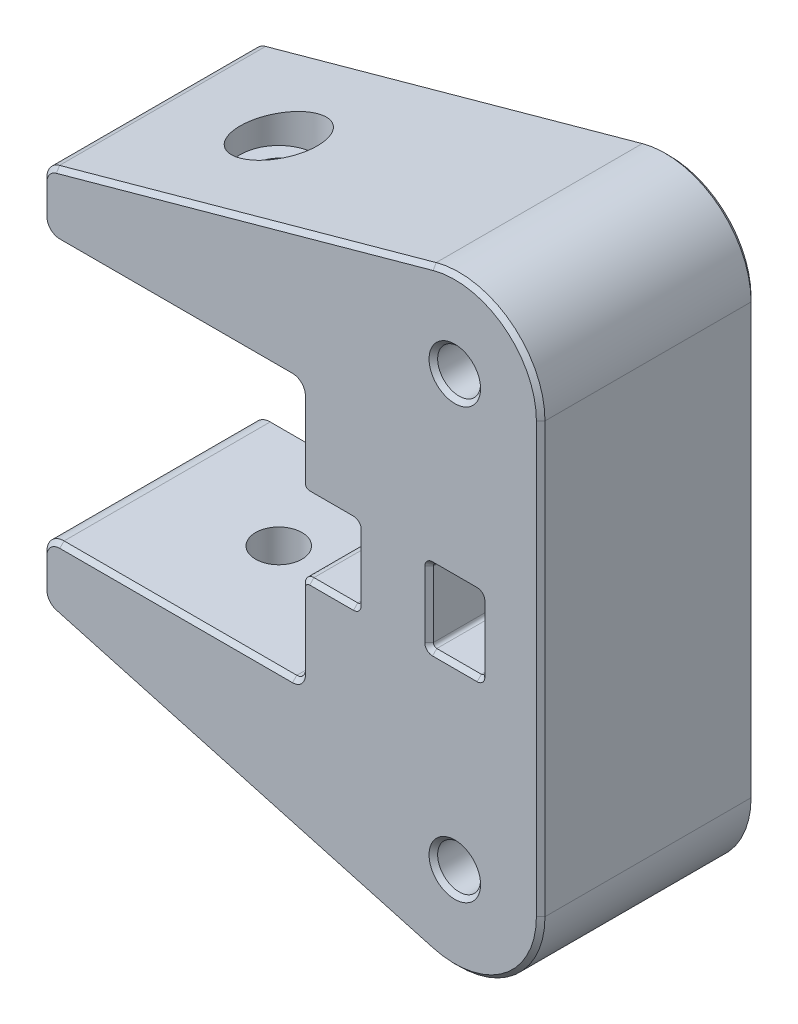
ISO-10303-21;
HEADER;
FILE_DESCRIPTION(('STEP AP214'),'2;1');
FILE_NAME('part.step','',(''),(''),'','','');
FILE_SCHEMA(('AUTOMOTIVE_DESIGN { 1 0 10303 214 1 1 1 1 }'));
ENDSEC;
DATA;
#1=APPLICATION_CONTEXT('core data for automotive mechanical design processes');
#2=APPLICATION_PROTOCOL_DEFINITION('international standard','automotive_design',2000,#1);
#3=PRODUCT_CONTEXT('',#1,'mechanical');
#4=PRODUCT('Part','Part','',(#3));
#5=PRODUCT_RELATED_PRODUCT_CATEGORY('part','',(#4));
#6=PRODUCT_DEFINITION_FORMATION('','',#4);
#7=PRODUCT_DEFINITION_CONTEXT('part definition',#1,'design');
#8=PRODUCT_DEFINITION('design','',#6,#7);
#9=PRODUCT_DEFINITION_SHAPE('','',#8);
#10=(LENGTH_UNIT() NAMED_UNIT(*) SI_UNIT(.MILLI.,.METRE.));
#11=(NAMED_UNIT(*) PLANE_ANGLE_UNIT() SI_UNIT($,.RADIAN.));
#12=(NAMED_UNIT(*) SI_UNIT($,.STERADIAN.) SOLID_ANGLE_UNIT());
#13=UNCERTAINTY_MEASURE_WITH_UNIT(LENGTH_MEASURE(1.E-05),#10,'distance_accuracy_value','');
#14=(GEOMETRIC_REPRESENTATION_CONTEXT(3) GLOBAL_UNCERTAINTY_ASSIGNED_CONTEXT((#13)) GLOBAL_UNIT_ASSIGNED_CONTEXT((#10,
#11,#12)) REPRESENTATION_CONTEXT('',''));
#15=CARTESIAN_POINT('',(0.,0.,0.));
#16=DIRECTION('',(0.,0.,1.));
#17=DIRECTION('',(1.,0.,0.));
#18=AXIS2_PLACEMENT_3D('',#15,#16,#17);
#19=CARTESIAN_POINT('',(30.1,30.1,21.));
#20=DIRECTION('',(1.,0.,0.));
#21=DIRECTION('',(0.,1.,0.));
#22=AXIS2_PLACEMENT_3D('',#19,#20,#21);
#23=PLANE('',#22);
#24=DIRECTION('',(0.,0.,-1.));
#25=VECTOR('',#24,1.);
#26=CARTESIAN_POINT('',(30.1,9.74999999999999,21.));
#27=LINE('',#26,#25);
#28=CARTESIAN_POINT('',(30.1,9.74999999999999,24.5));
#29=VERTEX_POINT('',#28);
#30=CARTESIAN_POINT('',(30.1,9.74999999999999,0.5));
#31=VERTEX_POINT('',#30);
#32=EDGE_CURVE('E1633',#29,#31,#27,.T.);
#33=ORIENTED_EDGE('',*,*,#32,.T.);
#34=DIRECTION('',(0.,-1.,0.));
#35=VECTOR('',#34,1.);
#36=CARTESIAN_POINT('',(30.1,30.1,0.5));
#37=LINE('',#36,#35);
#38=CARTESIAN_POINT('',(30.1,0.9,0.5));
#39=VERTEX_POINT('',#38);
#40=EDGE_CURVE('E1019',#31,#39,#37,.T.);
#41=ORIENTED_EDGE('',*,*,#40,.T.);
#42=DIRECTION('',(0.,0.,-1.));
#43=VECTOR('',#42,1.);
#44=CARTESIAN_POINT('',(30.1,0.9,25.));
#45=LINE('',#44,#43);
#46=CARTESIAN_POINT('',(30.1,0.9,24.5));
#47=VERTEX_POINT('',#46);
#48=EDGE_CURVE('E1630',#39,#47,#45,.F.);
#49=ORIENTED_EDGE('',*,*,#48,.T.);
#50=DIRECTION('',(0.,1.,0.));
#51=VECTOR('',#50,1.);
#52=CARTESIAN_POINT('',(30.1,9.74999999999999,24.5));
#53=LINE('',#52,#51);
#54=EDGE_CURVE('E1016',#47,#29,#53,.T.);
#55=ORIENTED_EDGE('',*,*,#54,.T.);
#56=EDGE_LOOP('',(#33,#41,#49,#55));
#57=FACE_BOUND('',#56,.T.);
#58=ADVANCED_FACE('F42',(#57),#23,.F.);
#59=CARTESIAN_POINT('',(15.,-20.,12.5));
#60=DIRECTION('',(0.,1.,0.));
#61=DIRECTION('',(-1.,0.,0.));
#62=AXIS2_PLACEMENT_3D('',#59,#60,#61);
#63=CYLINDRICAL_SURFACE('',#62,2.7);
#64=CARTESIAN_POINT('',(15.,-0.100000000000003,12.5));
#65=DIRECTION('',(0.,-1.,0.));
#66=DIRECTION('',(1.,0.,0.));
#67=AXIS2_PLACEMENT_3D('',#64,#65,#66);
#68=CIRCLE('',#67,2.7);
#69=CARTESIAN_POINT('',(17.7,-0.100000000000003,12.5));
#70=VERTEX_POINT('',#69);
#71=EDGE_CURVE('E1740',#70,#70,#68,.T.);
#72=ORIENTED_EDGE('',*,*,#71,.F.);
#73=EDGE_LOOP('',(#72));
#74=FACE_BOUND('',#73,.T.);
#75=CARTESIAN_POINT('',(15.,-7.10000000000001,12.5));
#76=DIRECTION('',(0.,-1.,0.));
#77=DIRECTION('',(0.,0.,-1.));
#78=AXIS2_PLACEMENT_3D('',#75,#76,#77);
#79=CIRCLE('',#78,2.7);
#80=CARTESIAN_POINT('',(15.,-7.10000000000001,9.8));
#81=VERTEX_POINT('',#80);
#82=EDGE_CURVE('E1733',#81,#81,#79,.F.);
#83=ORIENTED_EDGE('',*,*,#82,.F.);
#84=EDGE_LOOP('',(#83));
#85=FACE_BOUND('',#84,.T.);
#86=ADVANCED_FACE('F1858',(#74,#85),#63,.F.);
#87=CARTESIAN_POINT('',(48.,-10.,0.));
#88=DIRECTION('',(0.,0.,1.));
#89=DIRECTION('',(1.,0.,0.));
#90=AXIS2_PLACEMENT_3D('',#87,#88,#89);
#91=PLANE('',#90);
#92=DIRECTION('',(0.500000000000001,-0.866025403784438,0.));
#93=VECTOR('',#92,1.);
#94=CARTESIAN_POINT('',(44.6802359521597,-13.25,0.));
#95=LINE('',#94,#93);
#96=CARTESIAN_POINT('',(43.5255354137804,-11.25,0.));
#97=VERTEX_POINT('',#96);
#98=CARTESIAN_POINT('',(44.6802359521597,-13.25,0.));
#99=VERTEX_POINT('',#98);
#100=EDGE_CURVE('E959',#97,#99,#95,.T.);
#101=ORIENTED_EDGE('',*,*,#100,.T.);
#102=CARTESIAN_POINT('',(46.8452994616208,-12.,0.));
#103=DIRECTION('',(0.,0.,1.));
#104=DIRECTION('',(1.,0.,0.));
#105=AXIS2_PLACEMENT_3D('',#102,#103,#104);
#106=CIRCLE('',#105,2.5);
#107=CARTESIAN_POINT('',(46.8452994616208,-14.5,0.));
#108=VERTEX_POINT('',#107);
#109=EDGE_CURVE('E961',#99,#108,#106,.T.);
#110=ORIENTED_EDGE('',*,*,#109,.T.);
#111=DIRECTION('',(1.,0.,0.));
#112=VECTOR('',#111,1.);
#113=CARTESIAN_POINT('',(49.1547005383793,-14.5,0.));
#114=LINE('',#113,#112);
#115=CARTESIAN_POINT('',(49.1547005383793,-14.5,0.));
#116=VERTEX_POINT('',#115);
#117=EDGE_CURVE('E935',#108,#116,#114,.T.);
#118=ORIENTED_EDGE('',*,*,#117,.T.);
#119=CARTESIAN_POINT('',(49.1547005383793,-12.,0.));
#120=DIRECTION('',(0.,0.,1.));
#121=DIRECTION('',(1.,0.,0.));
#122=AXIS2_PLACEMENT_3D('',#119,#120,#121);
#123=CIRCLE('',#122,2.5);
#124=CARTESIAN_POINT('',(51.3197640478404,-13.25,0.));
#125=VERTEX_POINT('',#124);
#126=EDGE_CURVE('E937',#116,#125,#123,.T.);
#127=ORIENTED_EDGE('',*,*,#126,.T.);
#128=DIRECTION('',(0.499999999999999,0.866025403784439,0.));
#129=VECTOR('',#128,1.);
#130=CARTESIAN_POINT('',(52.4744645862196,-11.25,0.));
#131=LINE('',#130,#129);
#132=CARTESIAN_POINT('',(52.4744645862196,-11.25,0.));
#133=VERTEX_POINT('',#132);
#134=EDGE_CURVE('E939',#125,#133,#131,.T.);
#135=ORIENTED_EDGE('',*,*,#134,.T.);
#136=CARTESIAN_POINT('',(50.3094010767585,-10.,0.));
#137=DIRECTION('',(0.,0.,1.));
#138=DIRECTION('',(1.,0.,0.));
#139=AXIS2_PLACEMENT_3D('',#136,#137,#138);
#140=CIRCLE('',#139,2.5);
#141=CARTESIAN_POINT('',(52.4744645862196,-8.75,0.));
#142=VERTEX_POINT('',#141);
#143=EDGE_CURVE('E941',#133,#142,#140,.T.);
#144=ORIENTED_EDGE('',*,*,#143,.T.);
#145=DIRECTION('',(-0.5,0.866025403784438,0.));
#146=VECTOR('',#145,1.);
#147=CARTESIAN_POINT('',(51.3197640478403,-6.75,0.));
#148=LINE('',#147,#146);
#149=CARTESIAN_POINT('',(51.3197640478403,-6.75,0.));
#150=VERTEX_POINT('',#149);
#151=EDGE_CURVE('E943',#142,#150,#148,.T.);
#152=ORIENTED_EDGE('',*,*,#151,.T.);
#153=CARTESIAN_POINT('',(49.1547005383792,-8.,0.));
#154=DIRECTION('',(0.,0.,1.));
#155=DIRECTION('',(1.,0.,0.));
#156=AXIS2_PLACEMENT_3D('',#153,#154,#155);
#157=CIRCLE('',#156,2.5);
#158=CARTESIAN_POINT('',(49.1547005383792,-5.5,0.));
#159=VERTEX_POINT('',#158);
#160=EDGE_CURVE('E946',#150,#159,#157,.T.);
#161=ORIENTED_EDGE('',*,*,#160,.T.);
#162=DIRECTION('',(-1.,0.,0.));
#163=VECTOR('',#162,1.);
#164=CARTESIAN_POINT('',(46.8452994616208,-5.5,0.));
#165=LINE('',#164,#163);
#166=CARTESIAN_POINT('',(46.8452994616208,-5.5,0.));
#167=VERTEX_POINT('',#166);
#168=EDGE_CURVE('E949',#159,#167,#165,.T.);
#169=ORIENTED_EDGE('',*,*,#168,.T.);
#170=CARTESIAN_POINT('',(46.8452994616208,-8.,0.));
#171=DIRECTION('',(0.,0.,1.));
#172=DIRECTION('',(1.,0.,0.));
#173=AXIS2_PLACEMENT_3D('',#170,#171,#172);
#174=CIRCLE('',#173,2.5);
#175=CARTESIAN_POINT('',(44.6802359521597,-6.75,0.));
#176=VERTEX_POINT('',#175);
#177=EDGE_CURVE('E952',#167,#176,#174,.T.);
#178=ORIENTED_EDGE('',*,*,#177,.T.);
#179=DIRECTION('',(-0.5,-0.866025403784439,0.));
#180=VECTOR('',#179,1.);
#181=CARTESIAN_POINT('',(43.5255354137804,-8.75,0.));
#182=LINE('',#181,#180);
#183=CARTESIAN_POINT('',(43.5255354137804,-8.75,0.));
#184=VERTEX_POINT('',#183);
#185=EDGE_CURVE('E955',#176,#184,#182,.T.);
#186=ORIENTED_EDGE('',*,*,#185,.T.);
#187=CARTESIAN_POINT('',(45.6905989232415,-10.,0.));
#188=DIRECTION('',(0.,0.,1.));
#189=DIRECTION('',(1.,0.,0.));
#190=AXIS2_PLACEMENT_3D('',#187,#188,#189);
#191=CIRCLE('',#190,2.5);
#192=EDGE_CURVE('E957',#184,#97,#191,.T.);
#193=ORIENTED_EDGE('',*,*,#192,.T.);
#194=EDGE_LOOP('',(#101,#110,#118,#127,#135,#144,#152,#161,#169,#178,#186,#193));
#195=FACE_BOUND('',#194,.T.);
#196=DIRECTION('',(0.,1.,0.));
#197=VECTOR('',#196,1.);
#198=CARTESIAN_POINT('',(37.1,-10.,0.));
#199=LINE('',#198,#197);
#200=CARTESIAN_POINT('',(37.1,11.15,0.));
#201=VERTEX_POINT('',#200);
#202=CARTESIAN_POINT('',(37.1,18.85,0.));
#203=VERTEX_POINT('',#202);
#204=EDGE_CURVE('E930',#201,#203,#199,.T.);
#205=ORIENTED_EDGE('',*,*,#204,.T.);
#206=CARTESIAN_POINT('',(36.2,18.85,0.));
#207=DIRECTION('',(0.,0.,1.));
#208=DIRECTION('',(1.,0.,0.));
#209=AXIS2_PLACEMENT_3D('',#206,#207,#208);
#210=CIRCLE('',#209,0.899999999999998);
#211=CARTESIAN_POINT('',(36.2,19.75,0.));
#212=VERTEX_POINT('',#211);
#213=EDGE_CURVE('E932',#203,#212,#210,.T.);
#214=ORIENTED_EDGE('',*,*,#213,.T.);
#215=DIRECTION('',(-1.,0.,0.));
#216=VECTOR('',#215,1.);
#217=CARTESIAN_POINT('',(48.,19.75,0.));
#218=LINE('',#217,#216);
#219=CARTESIAN_POINT('',(31.1,19.75,0.));
#220=VERTEX_POINT('',#219);
#221=EDGE_CURVE('E878',#212,#220,#218,.T.);
#222=ORIENTED_EDGE('',*,*,#221,.T.);
#223=CARTESIAN_POINT('',(31.1,20.25,0.));
#224=DIRECTION('',(0.,0.,1.));
#225=DIRECTION('',(1.,0.,0.));
#226=AXIS2_PLACEMENT_3D('',#223,#224,#225);
#227=CIRCLE('',#226,0.5);
#228=CARTESIAN_POINT('',(30.6,20.25,0.));
#229=VERTEX_POINT('',#228);
#230=EDGE_CURVE('E880',#220,#229,#227,.F.);
#231=ORIENTED_EDGE('',*,*,#230,.T.);
#232=DIRECTION('',(0.,1.,0.));
#233=VECTOR('',#232,1.);
#234=CARTESIAN_POINT('',(30.6,-10.,0.));
#235=LINE('',#234,#233);
#236=CARTESIAN_POINT('',(30.6,29.1,0.));
#237=VERTEX_POINT('',#236);
#238=EDGE_CURVE('E882',#229,#237,#235,.T.);
#239=ORIENTED_EDGE('',*,*,#238,.T.);
#240=CARTESIAN_POINT('',(29.1,29.1,0.));
#241=DIRECTION('',(0.,0.,1.));
#242=DIRECTION('',(1.,0.,0.));
#243=AXIS2_PLACEMENT_3D('',#240,#241,#242);
#244=CIRCLE('',#243,1.5);
#245=CARTESIAN_POINT('',(29.1,30.6,0.));
#246=VERTEX_POINT('',#245);
#247=EDGE_CURVE('E884',#237,#246,#244,.T.);
#248=ORIENTED_EDGE('',*,*,#247,.T.);
#249=DIRECTION('',(-1.,0.,0.));
#250=VECTOR('',#249,1.);
#251=CARTESIAN_POINT('',(48.,30.6,0.));
#252=LINE('',#251,#250);
#253=CARTESIAN_POINT('',(2.,30.6,0.));
#254=VERTEX_POINT('',#253);
#255=EDGE_CURVE('E886',#246,#254,#252,.T.);
#256=ORIENTED_EDGE('',*,*,#255,.T.);
#257=CARTESIAN_POINT('',(2.,32.1,0.));
#258=DIRECTION('',(0.,0.,1.));
#259=DIRECTION('',(1.,0.,0.));
#260=AXIS2_PLACEMENT_3D('',#257,#258,#259);
#261=CIRCLE('',#260,1.5);
#262=CARTESIAN_POINT('',(0.5,32.1,0.));
#263=VERTEX_POINT('',#262);
#264=EDGE_CURVE('E889',#254,#263,#261,.F.);
#265=ORIENTED_EDGE('',*,*,#264,.T.);
#266=DIRECTION('',(0.,1.,0.));
#267=VECTOR('',#266,1.);
#268=CARTESIAN_POINT('',(0.5,-10.,0.));
#269=LINE('',#268,#267);
#270=CARTESIAN_POINT('',(0.5,35.5780599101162,0.));
#271=VERTEX_POINT('',#270);
#272=EDGE_CURVE('E892',#263,#271,#269,.T.);
#273=ORIENTED_EDGE('',*,*,#272,.T.);
#274=CARTESIAN_POINT('',(2.,35.5780599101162,0.));
#275=DIRECTION('',(0.,0.,1.));
#276=DIRECTION('',(1.,0.,0.));
#277=AXIS2_PLACEMENT_3D('',#274,#275,#276);
#278=CIRCLE('',#277,1.5);
#279=CARTESIAN_POINT('',(1.60015406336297,37.0237857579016,0.));
#280=VERTEX_POINT('',#279);
#281=EDGE_CURVE('E894',#271,#280,#278,.F.);
#282=ORIENTED_EDGE('',*,*,#281,.T.);
#283=DIRECTION('',(0.963817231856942,0.266563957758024,0.));
#284=VECTOR('',#283,1.);
#285=CARTESIAN_POINT('',(32.6216956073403,45.6034465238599,0.));
#286=LINE('',#285,#284);
#287=CARTESIAN_POINT('',(45.4676424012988,49.156263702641,0.));
#288=VERTEX_POINT('',#287);
#289=EDGE_CURVE('E896',#280,#288,#286,.T.);
#290=ORIENTED_EDGE('',*,*,#289,.T.);
#291=CARTESIAN_POINT('',(48.,40.,0.));
#292=DIRECTION('',(0.,0.,1.));
#293=DIRECTION('',(1.,0.,0.));
#294=AXIS2_PLACEMENT_3D('',#291,#292,#293);
#295=CIRCLE('',#294,9.5);
#296=CARTESIAN_POINT('',(57.5,40.,0.));
#297=VERTEX_POINT('',#296);
#298=EDGE_CURVE('E898',#288,#297,#295,.F.);
#299=ORIENTED_EDGE('',*,*,#298,.T.);
#300=DIRECTION('',(0.,-1.,0.));
#301=VECTOR('',#300,1.);
#302=CARTESIAN_POINT('',(57.5,-10.,0.));
#303=LINE('',#302,#301);
#304=CARTESIAN_POINT('',(57.5,-10.,0.));
#305=VERTEX_POINT('',#304);
#306=EDGE_CURVE('E900',#297,#305,#303,.T.);
#307=ORIENTED_EDGE('',*,*,#306,.T.);
#308=CARTESIAN_POINT('',(48.,-10.,0.));
#309=DIRECTION('',(0.,0.,1.));
#310=DIRECTION('',(1.,0.,0.));
#311=AXIS2_PLACEMENT_3D('',#308,#309,#310);
#312=CIRCLE('',#311,9.5);
#313=CARTESIAN_POINT('',(45.4676424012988,-19.156263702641,0.));
#314=VERTEX_POINT('',#313);
#315=EDGE_CURVE('E903',#305,#314,#312,.F.);
#316=ORIENTED_EDGE('',*,*,#315,.T.);
#317=DIRECTION('',(-0.963817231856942,0.266563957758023,0.));
#318=VECTOR('',#317,1.);
#319=CARTESIAN_POINT('',(45.4676424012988,-19.1562637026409,0.));
#320=LINE('',#319,#318);
#321=CARTESIAN_POINT('',(1.60015406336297,-7.02378575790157,0.));
#322=VERTEX_POINT('',#321);
#323=EDGE_CURVE('E905',#314,#322,#320,.T.);
#324=ORIENTED_EDGE('',*,*,#323,.T.);
#325=CARTESIAN_POINT('',(2.,-5.57805991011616,0.));
#326=DIRECTION('',(0.,0.,1.));
#327=DIRECTION('',(1.,0.,0.));
#328=AXIS2_PLACEMENT_3D('',#325,#326,#327);
#329=CIRCLE('',#328,1.5);
#330=CARTESIAN_POINT('',(0.500000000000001,-5.57805991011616,0.));
#331=VERTEX_POINT('',#330);
#332=EDGE_CURVE('E908',#322,#331,#329,.F.);
#333=ORIENTED_EDGE('',*,*,#332,.T.);
#334=DIRECTION('',(0.,1.,0.));
#335=VECTOR('',#334,1.);
#336=CARTESIAN_POINT('',(0.5,-10.,0.));
#337=LINE('',#336,#335);
#338=CARTESIAN_POINT('',(0.499999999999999,-2.1,0.));
#339=VERTEX_POINT('',#338);
#340=EDGE_CURVE('E911',#331,#339,#337,.T.);
#341=ORIENTED_EDGE('',*,*,#340,.T.);
#342=CARTESIAN_POINT('',(2.,-2.1,0.));
#343=DIRECTION('',(0.,0.,1.));
#344=DIRECTION('',(1.,0.,0.));
#345=AXIS2_PLACEMENT_3D('',#342,#343,#344);
#346=CIRCLE('',#345,1.5);
#347=CARTESIAN_POINT('',(2.,-0.600000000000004,0.));
#348=VERTEX_POINT('',#347);
#349=EDGE_CURVE('E914',#339,#348,#346,.F.);
#350=ORIENTED_EDGE('',*,*,#349,.T.);
#351=DIRECTION('',(1.,0.,0.));
#352=VECTOR('',#351,1.);
#353=CARTESIAN_POINT('',(48.,-0.599999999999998,0.));
#354=LINE('',#353,#352);
#355=CARTESIAN_POINT('',(29.1,-0.6,0.));
#356=VERTEX_POINT('',#355);
#357=EDGE_CURVE('E917',#348,#356,#354,.T.);
#358=ORIENTED_EDGE('',*,*,#357,.T.);
#359=CARTESIAN_POINT('',(29.1,0.9,0.));
#360=DIRECTION('',(0.,0.,1.));
#361=DIRECTION('',(1.,0.,0.));
#362=AXIS2_PLACEMENT_3D('',#359,#360,#361);
#363=CIRCLE('',#362,1.5);
#364=CARTESIAN_POINT('',(30.6,0.9,0.));
#365=VERTEX_POINT('',#364);
#366=EDGE_CURVE('E920',#356,#365,#363,.T.);
#367=ORIENTED_EDGE('',*,*,#366,.T.);
#368=DIRECTION('',(0.,1.,0.));
#369=VECTOR('',#368,1.);
#370=CARTESIAN_POINT('',(30.6,-10.,0.));
#371=LINE('',#370,#369);
#372=CARTESIAN_POINT('',(30.6,9.74999999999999,0.));
#373=VERTEX_POINT('',#372);
#374=EDGE_CURVE('E922',#365,#373,#371,.T.);
#375=ORIENTED_EDGE('',*,*,#374,.T.);
#376=CARTESIAN_POINT('',(31.1,9.74999999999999,0.));
#377=DIRECTION('',(0.,0.,1.));
#378=DIRECTION('',(1.,0.,0.));
#379=AXIS2_PLACEMENT_3D('',#376,#377,#378);
#380=CIRCLE('',#379,0.5);
#381=CARTESIAN_POINT('',(31.1,10.25,0.));
#382=VERTEX_POINT('',#381);
#383=EDGE_CURVE('E924',#373,#382,#380,.F.);
#384=ORIENTED_EDGE('',*,*,#383,.T.);
#385=DIRECTION('',(1.,0.,0.));
#386=VECTOR('',#385,1.);
#387=CARTESIAN_POINT('',(48.,10.25,0.));
#388=LINE('',#387,#386);
#389=CARTESIAN_POINT('',(36.2,10.25,0.));
#390=VERTEX_POINT('',#389);
#391=EDGE_CURVE('E926',#382,#390,#388,.T.);
#392=ORIENTED_EDGE('',*,*,#391,.T.);
#393=CARTESIAN_POINT('',(36.2,11.15,0.));
#394=DIRECTION('',(0.,0.,1.));
#395=DIRECTION('',(1.,0.,0.));
#396=AXIS2_PLACEMENT_3D('',#393,#394,#395);
#397=CIRCLE('',#396,0.899999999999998);
#398=EDGE_CURVE('E928',#390,#201,#397,.T.);
#399=ORIENTED_EDGE('',*,*,#398,.T.);
#400=EDGE_LOOP('',(#205,#214,#222,#231,#239,#248,#256,#265,#273,#282,#290,#299,#307,#316,#324,
#333,#341,#350,#358,#367,#375,#384,#392,#399));
#401=FACE_BOUND('',#400,.T.);
#402=DIRECTION('',(-0.499999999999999,0.866025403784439,0.));
#403=VECTOR('',#402,1.);
#404=CARTESIAN_POINT('',(51.3197640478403,43.25,0.));
#405=LINE('',#404,#403);
#406=CARTESIAN_POINT('',(52.4744645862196,41.25,0.));
#407=VERTEX_POINT('',#406);
#408=CARTESIAN_POINT('',(51.3197640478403,43.25,0.));
#409=VERTEX_POINT('',#408);
#410=EDGE_CURVE('E873',#407,#409,#405,.T.);
#411=ORIENTED_EDGE('',*,*,#410,.T.);
#412=CARTESIAN_POINT('',(49.1547005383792,42.,0.));
#413=DIRECTION('',(0.,0.,1.));
#414=DIRECTION('',(1.,0.,0.));
#415=AXIS2_PLACEMENT_3D('',#412,#413,#414);
#416=CIRCLE('',#415,2.5);
#417=CARTESIAN_POINT('',(49.1547005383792,44.5,0.));
#418=VERTEX_POINT('',#417);
#419=EDGE_CURVE('E875',#409,#418,#416,.T.);
#420=ORIENTED_EDGE('',*,*,#419,.T.);
#421=DIRECTION('',(-1.,0.,0.));
#422=VECTOR('',#421,1.);
#423=CARTESIAN_POINT('',(46.8452994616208,44.5,0.));
#424=LINE('',#423,#422);
#425=CARTESIAN_POINT('',(46.8452994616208,44.5,0.));
#426=VERTEX_POINT('',#425);
#427=EDGE_CURVE('E853',#418,#426,#424,.T.);
#428=ORIENTED_EDGE('',*,*,#427,.T.);
#429=CARTESIAN_POINT('',(46.8452994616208,42.,0.));
#430=DIRECTION('',(0.,0.,1.));
#431=DIRECTION('',(1.,0.,0.));
#432=AXIS2_PLACEMENT_3D('',#429,#430,#431);
#433=CIRCLE('',#432,2.5);
#434=CARTESIAN_POINT('',(44.6802359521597,43.25,0.));
#435=VERTEX_POINT('',#434);
#436=EDGE_CURVE('E855',#426,#435,#433,.T.);
#437=ORIENTED_EDGE('',*,*,#436,.T.);
#438=DIRECTION('',(-0.5,-0.866025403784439,0.));
#439=VECTOR('',#438,1.);
#440=CARTESIAN_POINT('',(43.5255354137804,41.25,0.));
#441=LINE('',#440,#439);
#442=CARTESIAN_POINT('',(43.5255354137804,41.25,0.));
#443=VERTEX_POINT('',#442);
#444=EDGE_CURVE('E857',#435,#443,#441,.T.);
#445=ORIENTED_EDGE('',*,*,#444,.T.);
#446=CARTESIAN_POINT('',(45.6905989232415,40.,0.));
#447=DIRECTION('',(0.,0.,1.));
#448=DIRECTION('',(1.,0.,0.));
#449=AXIS2_PLACEMENT_3D('',#446,#447,#448);
#450=CIRCLE('',#449,2.5);
#451=CARTESIAN_POINT('',(43.5255354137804,38.75,0.));
#452=VERTEX_POINT('',#451);
#453=EDGE_CURVE('E859',#443,#452,#450,.T.);
#454=ORIENTED_EDGE('',*,*,#453,.T.);
#455=DIRECTION('',(0.499999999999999,-0.866025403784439,0.));
#456=VECTOR('',#455,1.);
#457=CARTESIAN_POINT('',(44.6802359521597,36.75,0.));
#458=LINE('',#457,#456);
#459=CARTESIAN_POINT('',(44.6802359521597,36.75,0.));
#460=VERTEX_POINT('',#459);
#461=EDGE_CURVE('E861',#452,#460,#458,.T.);
#462=ORIENTED_EDGE('',*,*,#461,.T.);
#463=CARTESIAN_POINT('',(46.8452994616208,38.,0.));
#464=DIRECTION('',(0.,0.,1.));
#465=DIRECTION('',(1.,0.,0.));
#466=AXIS2_PLACEMENT_3D('',#463,#464,#465);
#467=CIRCLE('',#466,2.5);
#468=CARTESIAN_POINT('',(46.8452994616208,35.5,0.));
#469=VERTEX_POINT('',#468);
#470=EDGE_CURVE('E863',#460,#469,#467,.T.);
#471=ORIENTED_EDGE('',*,*,#470,.T.);
#472=DIRECTION('',(1.,0.,0.));
#473=VECTOR('',#472,1.);
#474=CARTESIAN_POINT('',(49.1547005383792,35.5,0.));
#475=LINE('',#474,#473);
#476=CARTESIAN_POINT('',(49.1547005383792,35.5,0.));
#477=VERTEX_POINT('',#476);
#478=EDGE_CURVE('E865',#469,#477,#475,.T.);
#479=ORIENTED_EDGE('',*,*,#478,.T.);
#480=CARTESIAN_POINT('',(49.1547005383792,38.,0.));
#481=DIRECTION('',(0.,0.,1.));
#482=DIRECTION('',(1.,0.,0.));
#483=AXIS2_PLACEMENT_3D('',#480,#481,#482);
#484=CIRCLE('',#483,2.5);
#485=CARTESIAN_POINT('',(51.3197640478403,36.75,0.));
#486=VERTEX_POINT('',#485);
#487=EDGE_CURVE('E867',#477,#486,#484,.T.);
#488=ORIENTED_EDGE('',*,*,#487,.T.);
#489=DIRECTION('',(0.5,0.866025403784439,0.));
#490=VECTOR('',#489,1.);
#491=CARTESIAN_POINT('',(52.4744645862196,38.75,0.));
#492=LINE('',#491,#490);
#493=CARTESIAN_POINT('',(52.4744645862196,38.75,0.));
#494=VERTEX_POINT('',#493);
#495=EDGE_CURVE('E869',#486,#494,#492,.T.);
#496=ORIENTED_EDGE('',*,*,#495,.T.);
#497=CARTESIAN_POINT('',(50.3094010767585,40.,0.));
#498=DIRECTION('',(0.,0.,1.));
#499=DIRECTION('',(1.,0.,0.));
#500=AXIS2_PLACEMENT_3D('',#497,#498,#499);
#501=CIRCLE('',#500,2.5);
#502=EDGE_CURVE('E871',#494,#407,#501,.T.);
#503=ORIENTED_EDGE('',*,*,#502,.T.);
#504=EDGE_LOOP('',(#411,#420,#428,#437,#445,#454,#462,#471,#479,#488,#496,#503));
#505=FACE_BOUND('',#504,.T.);
#506=DIRECTION('',(1.,0.,0.));
#507=VECTOR('',#506,1.);
#508=CARTESIAN_POINT('',(48.,10.25,0.));
#509=LINE('',#508,#507);
#510=CARTESIAN_POINT('',(45.4000000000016,10.25,0.));
#511=VERTEX_POINT('',#510);
#512=CARTESIAN_POINT('',(50.6000000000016,10.25,0.));
#513=VERTEX_POINT('',#512);
#514=EDGE_CURVE('E846',#511,#513,#509,.T.);
#515=ORIENTED_EDGE('',*,*,#514,.T.);
#516=CARTESIAN_POINT('',(50.6000000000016,11.15,0.));
#517=DIRECTION('',(0.,0.,1.));
#518=DIRECTION('',(1.,0.,0.));
#519=AXIS2_PLACEMENT_3D('',#516,#517,#518);
#520=CIRCLE('',#519,0.899999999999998);
#521=CARTESIAN_POINT('',(51.5000000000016,11.15,0.));
#522=VERTEX_POINT('',#521);
#523=EDGE_CURVE('E849',#513,#522,#520,.T.);
#524=ORIENTED_EDGE('',*,*,#523,.T.);
#525=DIRECTION('',(0.,1.,0.));
#526=VECTOR('',#525,1.);
#527=CARTESIAN_POINT('',(51.5000000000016,-10.,0.));
#528=LINE('',#527,#526);
#529=CARTESIAN_POINT('',(51.5000000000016,18.85,0.));
#530=VERTEX_POINT('',#529);
#531=EDGE_CURVE('E830',#522,#530,#528,.T.);
#532=ORIENTED_EDGE('',*,*,#531,.T.);
#533=CARTESIAN_POINT('',(50.6000000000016,18.85,0.));
#534=DIRECTION('',(0.,0.,1.));
#535=DIRECTION('',(1.,0.,0.));
#536=AXIS2_PLACEMENT_3D('',#533,#534,#535);
#537=CIRCLE('',#536,0.899999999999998);
#538=CARTESIAN_POINT('',(50.6000000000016,19.75,0.));
#539=VERTEX_POINT('',#538);
#540=EDGE_CURVE('E833',#530,#539,#537,.T.);
#541=ORIENTED_EDGE('',*,*,#540,.T.);
#542=DIRECTION('',(-1.,0.,0.));
#543=VECTOR('',#542,1.);
#544=CARTESIAN_POINT('',(48.,19.75,0.));
#545=LINE('',#544,#543);
#546=CARTESIAN_POINT('',(45.4000000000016,19.75,0.));
#547=VERTEX_POINT('',#546);
#548=EDGE_CURVE('E836',#539,#547,#545,.T.);
#549=ORIENTED_EDGE('',*,*,#548,.T.);
#550=CARTESIAN_POINT('',(45.4000000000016,18.85,0.));
#551=DIRECTION('',(0.,0.,1.));
#552=DIRECTION('',(1.,0.,0.));
#553=AXIS2_PLACEMENT_3D('',#550,#551,#552);
#554=CIRCLE('',#553,0.900000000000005);
#555=CARTESIAN_POINT('',(44.5000000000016,18.85,0.));
#556=VERTEX_POINT('',#555);
#557=EDGE_CURVE('E839',#547,#556,#554,.T.);
#558=ORIENTED_EDGE('',*,*,#557,.T.);
#559=DIRECTION('',(0.,-1.,0.));
#560=VECTOR('',#559,1.);
#561=CARTESIAN_POINT('',(44.5000000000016,-10.,0.));
#562=LINE('',#561,#560);
#563=CARTESIAN_POINT('',(44.5000000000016,11.15,0.));
#564=VERTEX_POINT('',#563);
#565=EDGE_CURVE('E841',#556,#564,#562,.T.);
#566=ORIENTED_EDGE('',*,*,#565,.T.);
#567=CARTESIAN_POINT('',(45.4000000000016,11.15,0.));
#568=DIRECTION('',(0.,0.,1.));
#569=DIRECTION('',(1.,0.,0.));
#570=AXIS2_PLACEMENT_3D('',#567,#568,#569);
#571=CIRCLE('',#570,0.899999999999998);
#572=EDGE_CURVE('E843',#564,#511,#571,.T.);
#573=ORIENTED_EDGE('',*,*,#572,.T.);
#574=EDGE_LOOP('',(#515,#524,#532,#541,#549,#558,#566,#573));
#575=FACE_BOUND('',#574,.T.);
#576=ADVANCED_FACE('F1865',(#195,#401,#505,#575),#91,.F.);
#577=CARTESIAN_POINT('',(0.,30.1,21.));
#578=DIRECTION('',(0.,1.,0.));
#579=DIRECTION('',(0.,0.,1.));
#580=AXIS2_PLACEMENT_3D('',#577,#578,#579);
#581=PLANE('',#580);
#582=CARTESIAN_POINT('',(15.,30.1,12.5));
#583=DIRECTION('',(0.,1.,0.));
#584=DIRECTION('',(0.,0.,1.));
#585=AXIS2_PLACEMENT_3D('',#582,#583,#584);
#586=CIRCLE('',#585,2.7);
#587=CARTESIAN_POINT('',(15.,30.1,15.2));
#588=VERTEX_POINT('',#587);
#589=EDGE_CURVE('E3633',#588,#588,#586,.T.);
#590=ORIENTED_EDGE('',*,*,#589,.T.);
#591=EDGE_LOOP('',(#590));
#592=FACE_BOUND('',#591,.T.);
#593=DIRECTION('',(0.,0.,-1.));
#594=VECTOR('',#593,1.);
#595=CARTESIAN_POINT('',(2.,30.1,21.));
#596=LINE('',#595,#594);
#597=CARTESIAN_POINT('',(2.,30.1,24.5));
#598=VERTEX_POINT('',#597);
#599=CARTESIAN_POINT('',(2.,30.1,0.5));
#600=VERTEX_POINT('',#599);
#601=EDGE_CURVE('E1763',#598,#600,#596,.T.);
#602=ORIENTED_EDGE('',*,*,#601,.T.);
#603=DIRECTION('',(1.,0.,0.));
#604=VECTOR('',#603,1.);
#605=CARTESIAN_POINT('',(0.,30.1,0.5));
#606=LINE('',#605,#604);
#607=CARTESIAN_POINT('',(29.1,30.1,0.5));
#608=VERTEX_POINT('',#607);
#609=EDGE_CURVE('E1090',#600,#608,#606,.T.);
#610=ORIENTED_EDGE('',*,*,#609,.T.);
#611=DIRECTION('',(0.,0.,-1.));
#612=VECTOR('',#611,1.);
#613=CARTESIAN_POINT('',(29.1,30.1,25.));
#614=LINE('',#613,#612);
#615=CARTESIAN_POINT('',(29.1,30.1,24.5));
#616=VERTEX_POINT('',#615);
#617=EDGE_CURVE('E744',#608,#616,#614,.F.);
#618=ORIENTED_EDGE('',*,*,#617,.T.);
#619=DIRECTION('',(-1.,0.,0.));
#620=VECTOR('',#619,1.);
#621=CARTESIAN_POINT('',(2.,30.1,24.5));
#622=LINE('',#621,#620);
#623=EDGE_CURVE('E1087',#616,#598,#622,.T.);
#624=ORIENTED_EDGE('',*,*,#623,.T.);
#625=EDGE_LOOP('',(#602,#610,#618,#624));
#626=FACE_BOUND('',#625,.T.);
#627=ADVANCED_FACE('F1873',(#592,#626),#581,.F.);
#628=DIRECTION('',(0.,0.,-1.));
#629=VECTOR('',#628,1.);
#630=CARTESIAN_POINT('',(30.1,29.1,0.));
#631=LINE('',#630,#629);
#632=CARTESIAN_POINT('',(30.1,29.1,24.5));
#633=VERTEX_POINT('',#632);
#634=CARTESIAN_POINT('',(30.1,29.1,0.5));
#635=VERTEX_POINT('',#634);
#636=EDGE_CURVE('E1622',#633,#635,#631,.T.);
#637=ORIENTED_EDGE('',*,*,#636,.T.);
#638=DIRECTION('',(0.,-1.,0.));
#639=VECTOR('',#638,1.);
#640=CARTESIAN_POINT('',(30.1,30.1,0.5));
#641=LINE('',#640,#639);
#642=CARTESIAN_POINT('',(30.1,20.25,0.5));
#643=VERTEX_POINT('',#642);
#644=EDGE_CURVE('E1102',#635,#643,#641,.T.);
#645=ORIENTED_EDGE('',*,*,#644,.T.);
#646=DIRECTION('',(0.,0.,-1.));
#647=VECTOR('',#646,1.);
#648=CARTESIAN_POINT('',(30.1,20.25,21.));
#649=LINE('',#648,#647);
#650=CARTESIAN_POINT('',(30.1,20.25,24.5));
#651=VERTEX_POINT('',#650);
#652=EDGE_CURVE('E1626',#643,#651,#649,.F.);
#653=ORIENTED_EDGE('',*,*,#652,.T.);
#654=DIRECTION('',(0.,1.,0.));
#655=VECTOR('',#654,1.);
#656=CARTESIAN_POINT('',(30.1,29.1,24.5));
#657=LINE('',#656,#655);
#658=EDGE_CURVE('E1099',#651,#633,#657,.T.);
#659=ORIENTED_EDGE('',*,*,#658,.T.);
#660=EDGE_LOOP('',(#637,#645,#653,#659));
#661=FACE_BOUND('',#660,.T.);
#662=ADVANCED_FACE('F1861',(#661),#23,.F.);
#663=CARTESIAN_POINT('',(30.1,-0.1,21.));
#664=DIRECTION('',(0.,-1.,0.));
#665=DIRECTION('',(1.,0.,0.));
#666=AXIS2_PLACEMENT_3D('',#663,#664,#665);
#667=PLANE('',#666);
#668=ORIENTED_EDGE('',*,*,#71,.T.);
#669=EDGE_LOOP('',(#668));
#670=FACE_BOUND('',#669,.T.);
#671=DIRECTION('',(0.,0.,-1.));
#672=VECTOR('',#671,1.);
#673=CARTESIAN_POINT('',(29.1,-0.1,0.));
#674=LINE('',#673,#672);
#675=CARTESIAN_POINT('',(29.1,-0.1,24.5));
#676=VERTEX_POINT('',#675);
#677=CARTESIAN_POINT('',(29.1,-0.1,0.5));
#678=VERTEX_POINT('',#677);
#679=EDGE_CURVE('E1641',#676,#678,#674,.T.);
#680=ORIENTED_EDGE('',*,*,#679,.T.);
#681=DIRECTION('',(-1.,0.,0.));
#682=VECTOR('',#681,1.);
#683=CARTESIAN_POINT('',(30.1,-0.1,0.5));
#684=LINE('',#683,#682);
#685=CARTESIAN_POINT('',(2.,-0.100000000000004,0.5));
#686=VERTEX_POINT('',#685);
#687=EDGE_CURVE('E1028',#678,#686,#684,.T.);
#688=ORIENTED_EDGE('',*,*,#687,.T.);
#689=DIRECTION('',(0.,0.,-1.));
#690=VECTOR('',#689,1.);
#691=CARTESIAN_POINT('',(2.,-0.100000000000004,21.));
#692=LINE('',#691,#690);
#693=CARTESIAN_POINT('',(2.,-0.100000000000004,24.5));
#694=VERTEX_POINT('',#693);
#695=EDGE_CURVE('E1759',#686,#694,#692,.F.);
#696=ORIENTED_EDGE('',*,*,#695,.T.);
#697=DIRECTION('',(1.,0.,0.));
#698=VECTOR('',#697,1.);
#699=CARTESIAN_POINT('',(29.1,-0.1,24.5));
#700=LINE('',#699,#698);
#701=EDGE_CURVE('E1025',#694,#676,#700,.T.);
#702=ORIENTED_EDGE('',*,*,#701,.T.);
#703=EDGE_LOOP('',(#680,#688,#696,#702));
#704=FACE_BOUND('',#703,.T.);
#705=ADVANCED_FACE('F1872',(#670,#704),#667,.F.);
#706=CARTESIAN_POINT('',(0.,-0.100000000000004,21.));
#707=DIRECTION('',(1.,0.,0.));
#708=DIRECTION('',(0.,1.,0.));
#709=AXIS2_PLACEMENT_3D('',#706,#707,#708);
#710=PLANE('',#709);
#711=DIRECTION('',(0.,0.,-1.));
#712=VECTOR('',#711,1.);
#713=CARTESIAN_POINT('',(0.,-2.1,21.));
#714=LINE('',#713,#712);
#715=CARTESIAN_POINT('',(0.,-2.1,24.5));
#716=VERTEX_POINT('',#715);
#717=CARTESIAN_POINT('',(0.,-2.1,0.5));
#718=VERTEX_POINT('',#717);
#719=EDGE_CURVE('E1751',#716,#718,#714,.T.);
#720=ORIENTED_EDGE('',*,*,#719,.T.);
#721=DIRECTION('',(0.,-1.,0.));
#722=VECTOR('',#721,1.);
#723=CARTESIAN_POINT('',(0.,-0.100000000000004,0.5));
#724=LINE('',#723,#722);
#725=CARTESIAN_POINT('',(0.,-5.57805991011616,0.5));
#726=VERTEX_POINT('',#725);
#727=EDGE_CURVE('E1040',#718,#726,#724,.T.);
#728=ORIENTED_EDGE('',*,*,#727,.T.);
#729=DIRECTION('',(0.,0.,-1.));
#730=VECTOR('',#729,1.);
#731=CARTESIAN_POINT('',(0.,-5.57805991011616,21.));
#732=LINE('',#731,#730);
#733=CARTESIAN_POINT('',(0.,-5.57805991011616,24.5));
#734=VERTEX_POINT('',#733);
#735=EDGE_CURVE('E1755',#726,#734,#732,.F.);
#736=ORIENTED_EDGE('',*,*,#735,.T.);
#737=DIRECTION('',(0.,1.,0.));
#738=VECTOR('',#737,1.);
#739=CARTESIAN_POINT('',(0.,-2.1,24.5));
#740=LINE('',#739,#738);
#741=EDGE_CURVE('E1037',#734,#716,#740,.T.);
#742=ORIENTED_EDGE('',*,*,#741,.T.);
#743=EDGE_LOOP('',(#720,#728,#736,#742));
#744=FACE_BOUND('',#743,.T.);
#745=ADVANCED_FACE('F1879',(#744),#710,.F.);
#746=CARTESIAN_POINT('',(0.,-7.10000000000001,21.));
#747=DIRECTION('',(0.266563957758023,0.963817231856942,0.));
#748=DIRECTION('',(-0.963817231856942,0.266563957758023,0.));
#749=AXIS2_PLACEMENT_3D('',#746,#747,#748);
#750=PLANE('',#749);
#751=CARTESIAN_POINT('',(15.,-11.248565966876,12.5));
#752=DIRECTION('',(0.266563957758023,0.963817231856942,0.));
#753=DIRECTION('',(-0.963817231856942,0.266563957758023,0.));
#754=AXIS2_PLACEMENT_3D('',#751,#752,#753);
#755=ELLIPSE('',#754,4.66893499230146,4.5);
#756=CARTESIAN_POINT('',(10.5,-10.0039961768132,12.5));
#757=VERTEX_POINT('',#756);
#758=EDGE_CURVE('E1736',#757,#757,#755,.F.);
#759=ORIENTED_EDGE('',*,*,#758,.F.);
#760=EDGE_LOOP('',(#759));
#761=FACE_BOUND('',#760,.T.);
#762=DIRECTION('',(0.,0.,-1.));
#763=VECTOR('',#762,1.);
#764=CARTESIAN_POINT('',(1.46687208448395,-7.50569437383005,21.));
#765=LINE('',#764,#763);
#766=CARTESIAN_POINT('',(1.46687208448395,-7.50569437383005,24.5));
#767=VERTEX_POINT('',#766);
#768=CARTESIAN_POINT('',(1.46687208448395,-7.50569437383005,0.5));
#769=VERTEX_POINT('',#768);
#770=EDGE_CURVE('E1732',#767,#769,#765,.T.);
#771=ORIENTED_EDGE('',*,*,#770,.T.);
#772=DIRECTION('',(0.963817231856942,-0.266563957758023,0.));
#773=VECTOR('',#772,1.);
#774=CARTESIAN_POINT('',(0.,-7.10000000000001,0.5));
#775=LINE('',#774,#773);
#776=CARTESIAN_POINT('',(45.3343604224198,-19.6381723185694,0.500000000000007));
#777=VERTEX_POINT('',#776);
#778=EDGE_CURVE('E1050',#769,#777,#775,.T.);
#779=ORIENTED_EDGE('',*,*,#778,.T.);
#780=DIRECTION('',(0.,0.,-1.));
#781=VECTOR('',#780,1.);
#782=CARTESIAN_POINT('',(45.3343604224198,-19.6381723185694,21.));
#783=LINE('',#782,#781);
#784=CARTESIAN_POINT('',(45.3343604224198,-19.6381723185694,24.5));
#785=VERTEX_POINT('',#784);
#786=EDGE_CURVE('E1729',#785,#777,#783,.T.);
#787=ORIENTED_EDGE('',*,*,#786,.F.);
#788=DIRECTION('',(-0.963817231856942,0.266563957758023,0.));
#789=VECTOR('',#788,1.);
#790=CARTESIAN_POINT('',(1.46687208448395,-7.50569437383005,24.5));
#791=LINE('',#790,#789);
#792=EDGE_CURVE('E1048',#785,#767,#791,.T.);
#793=ORIENTED_EDGE('',*,*,#792,.T.);
#794=EDGE_LOOP('',(#771,#779,#787,#793));
#795=FACE_BOUND('',#794,.T.);
#796=ADVANCED_FACE('F3385',(#761,#795),#750,.F.);
#797=CARTESIAN_POINT('',(48.,-10.,21.));
#798=DIRECTION('',(0.,0.,-1.));
#799=DIRECTION('',(-1.,0.,0.));
#800=AXIS2_PLACEMENT_3D('',#797,#798,#799);
#801=CYLINDRICAL_SURFACE('',#800,10.);
#802=ORIENTED_EDGE('',*,*,#786,.T.);
#803=CARTESIAN_POINT('',(48.,-10.,0.5));
#804=DIRECTION('',(0.,0.,1.));
#805=DIRECTION('',(1.,0.,0.));
#806=AXIS2_PLACEMENT_3D('',#803,#804,#805);
#807=CIRCLE('',#806,10.);
#808=CARTESIAN_POINT('',(58.,-10.,0.500000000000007));
#809=VERTEX_POINT('',#808);
#810=EDGE_CURVE('E1055',#777,#809,#807,.T.);
#811=ORIENTED_EDGE('',*,*,#810,.T.);
#812=DIRECTION('',(0.,0.,-1.));
#813=VECTOR('',#812,1.);
#814=CARTESIAN_POINT('',(58.,-10.,21.));
#815=LINE('',#814,#813);
#816=CARTESIAN_POINT('',(58.,-10.,24.5));
#817=VERTEX_POINT('',#816);
#818=EDGE_CURVE('E1725',#817,#809,#815,.T.);
#819=ORIENTED_EDGE('',*,*,#818,.F.);
#820=CARTESIAN_POINT('',(48.,-10.,24.5));
#821=DIRECTION('',(0.,0.,1.));
#822=DIRECTION('',(1.,0.,0.));
#823=AXIS2_PLACEMENT_3D('',#820,#821,#822);
#824=CIRCLE('',#823,10.);
#825=EDGE_CURVE('E1053',#817,#785,#824,.F.);
#826=ORIENTED_EDGE('',*,*,#825,.T.);
#827=EDGE_LOOP('',(#802,#811,#819,#826));
#828=FACE_BOUND('',#827,.T.);
#829=ADVANCED_FACE('F3377',(#828),#801,.T.);
#830=CARTESIAN_POINT('',(58.,40.,21.));
#831=DIRECTION('',(-1.,0.,0.));
#832=DIRECTION('',(0.,0.,1.));
#833=AXIS2_PLACEMENT_3D('',#830,#831,#832);
#834=PLANE('',#833);
#835=ORIENTED_EDGE('',*,*,#818,.T.);
#836=DIRECTION('',(0.,1.,0.));
#837=VECTOR('',#836,1.);
#838=CARTESIAN_POINT('',(58.,40.,0.5));
#839=LINE('',#838,#837);
#840=CARTESIAN_POINT('',(58.,40.,0.500000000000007));
#841=VERTEX_POINT('',#840);
#842=EDGE_CURVE('E1059',#809,#841,#839,.T.);
#843=ORIENTED_EDGE('',*,*,#842,.T.);
#844=DIRECTION('',(0.,0.,-1.));
#845=VECTOR('',#844,1.);
#846=CARTESIAN_POINT('',(58.,40.,21.));
#847=LINE('',#846,#845);
#848=CARTESIAN_POINT('',(58.,40.,24.5));
#849=VERTEX_POINT('',#848);
#850=EDGE_CURVE('E1721',#849,#841,#847,.T.);
#851=ORIENTED_EDGE('',*,*,#850,.F.);
#852=DIRECTION('',(0.,-1.,0.));
#853=VECTOR('',#852,1.);
#854=CARTESIAN_POINT('',(58.,-10.,24.5));
#855=LINE('',#854,#853);
#856=EDGE_CURVE('E1057',#849,#817,#855,.T.);
#857=ORIENTED_EDGE('',*,*,#856,.T.);
#858=EDGE_LOOP('',(#835,#843,#851,#857));
#859=FACE_BOUND('',#858,.T.);
#860=ADVANCED_FACE('F3369',(#859),#834,.F.);
#861=CARTESIAN_POINT('',(48.,40.,21.));
#862=DIRECTION('',(0.,0.,-1.));
#863=DIRECTION('',(-1.,0.,0.));
#864=AXIS2_PLACEMENT_3D('',#861,#862,#863);
#865=CYLINDRICAL_SURFACE('',#864,10.);
#866=ORIENTED_EDGE('',*,*,#850,.T.);
#867=CARTESIAN_POINT('',(48.,40.,0.5));
#868=DIRECTION('',(0.,0.,1.));
#869=DIRECTION('',(1.,0.,0.));
#870=AXIS2_PLACEMENT_3D('',#867,#868,#869);
#871=CIRCLE('',#870,10.);
#872=CARTESIAN_POINT('',(45.3343604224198,49.6381723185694,0.500000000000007));
#873=VERTEX_POINT('',#872);
#874=EDGE_CURVE('E1064',#841,#873,#871,.T.);
#875=ORIENTED_EDGE('',*,*,#874,.T.);
#876=DIRECTION('',(0.,0.,-1.));
#877=VECTOR('',#876,1.);
#878=CARTESIAN_POINT('',(45.3343604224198,49.6381723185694,21.));
#879=LINE('',#878,#877);
#880=CARTESIAN_POINT('',(45.3343604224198,49.6381723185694,24.5));
#881=VERTEX_POINT('',#880);
#882=EDGE_CURVE('E1718',#881,#873,#879,.T.);
#883=ORIENTED_EDGE('',*,*,#882,.F.);
#884=CARTESIAN_POINT('',(48.,40.,24.5));
#885=DIRECTION('',(0.,0.,1.));
#886=DIRECTION('',(1.,0.,0.));
#887=AXIS2_PLACEMENT_3D('',#884,#885,#886);
#888=CIRCLE('',#887,10.);
#889=EDGE_CURVE('E1062',#881,#849,#888,.F.);
#890=ORIENTED_EDGE('',*,*,#889,.T.);
#891=EDGE_LOOP('',(#866,#875,#883,#890));
#892=FACE_BOUND('',#891,.T.);
#893=ADVANCED_FACE('F3361',(#892),#865,.T.);
#894=CARTESIAN_POINT('',(0.,37.1,21.));
#895=DIRECTION('',(0.266563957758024,-0.963817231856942,0.));
#896=DIRECTION('',(0.963817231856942,0.266563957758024,0.));
#897=AXIS2_PLACEMENT_3D('',#894,#895,#896);
#898=PLANE('',#897);
#899=CARTESIAN_POINT('',(15.,41.248565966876,12.5));
#900=DIRECTION('',(0.266563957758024,-0.963817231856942,0.));
#901=DIRECTION('',(-0.963817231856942,-0.266563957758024,0.));
#902=AXIS2_PLACEMENT_3D('',#899,#900,#901);
#903=ELLIPSE('',#902,4.66893499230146,4.5);
#904=CARTESIAN_POINT('',(10.5,40.0039961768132,12.5));
#905=VERTEX_POINT('',#904);
#906=EDGE_CURVE('E1745',#905,#905,#903,.T.);
#907=ORIENTED_EDGE('',*,*,#906,.T.);
#908=EDGE_LOOP('',(#907));
#909=FACE_BOUND('',#908,.T.);
#910=ORIENTED_EDGE('',*,*,#882,.T.);
#911=DIRECTION('',(-0.963817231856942,-0.266563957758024,0.));
#912=VECTOR('',#911,1.);
#913=CARTESIAN_POINT('',(0.,37.1,0.5));
#914=LINE('',#913,#912);
#915=CARTESIAN_POINT('',(1.46687208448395,37.50569437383,0.499999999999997));
#916=VERTEX_POINT('',#915);
#917=EDGE_CURVE('E1069',#873,#916,#914,.T.);
#918=ORIENTED_EDGE('',*,*,#917,.T.);
#919=DIRECTION('',(0.,0.,-1.));
#920=VECTOR('',#919,1.);
#921=CARTESIAN_POINT('',(1.46687208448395,37.50569437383,21.));
#922=LINE('',#921,#920);
#923=CARTESIAN_POINT('',(1.46687208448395,37.50569437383,24.5));
#924=VERTEX_POINT('',#923);
#925=EDGE_CURVE('E1775',#916,#924,#922,.F.);
#926=ORIENTED_EDGE('',*,*,#925,.T.);
#927=DIRECTION('',(0.963817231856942,0.266563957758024,0.));
#928=VECTOR('',#927,1.);
#929=CARTESIAN_POINT('',(45.3343604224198,49.6381723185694,24.5));
#930=LINE('',#929,#928);
#931=EDGE_CURVE('E1066',#924,#881,#930,.T.);
#932=ORIENTED_EDGE('',*,*,#931,.T.);
#933=EDGE_LOOP('',(#910,#918,#926,#932));
#934=FACE_BOUND('',#933,.T.);
#935=ADVANCED_FACE('F3353',(#909,#934),#898,.F.);
#936=CARTESIAN_POINT('',(0.,30.1,21.));
#937=DIRECTION('',(1.,0.,0.));
#938=DIRECTION('',(0.,0.,-1.));
#939=AXIS2_PLACEMENT_3D('',#936,#937,#938);
#940=PLANE('',#939);
#941=DIRECTION('',(0.,0.,-1.));
#942=VECTOR('',#941,1.);
#943=CARTESIAN_POINT('',(0.,35.5780599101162,21.));
#944=LINE('',#943,#942);
#945=CARTESIAN_POINT('',(0.,35.5780599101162,24.5));
#946=VERTEX_POINT('',#945);
#947=CARTESIAN_POINT('',(0.,35.5780599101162,0.5));
#948=VERTEX_POINT('',#947);
#949=EDGE_CURVE('E1767',#946,#948,#944,.T.);
#950=ORIENTED_EDGE('',*,*,#949,.T.);
#951=DIRECTION('',(0.,-1.,0.));
#952=VECTOR('',#951,1.);
#953=CARTESIAN_POINT('',(0.,30.1,0.5));
#954=LINE('',#953,#952);
#955=CARTESIAN_POINT('',(0.,32.1,0.5));
#956=VERTEX_POINT('',#955);
#957=EDGE_CURVE('E1079',#948,#956,#954,.T.);
#958=ORIENTED_EDGE('',*,*,#957,.T.);
#959=DIRECTION('',(0.,0.,-1.));
#960=VECTOR('',#959,1.);
#961=CARTESIAN_POINT('',(0.,32.1,21.));
#962=LINE('',#961,#960);
#963=CARTESIAN_POINT('',(0.,32.1,24.5));
#964=VERTEX_POINT('',#963);
#965=EDGE_CURVE('E1771',#956,#964,#962,.F.);
#966=ORIENTED_EDGE('',*,*,#965,.T.);
#967=DIRECTION('',(0.,1.,0.));
#968=VECTOR('',#967,1.);
#969=CARTESIAN_POINT('',(0.,35.5780599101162,24.5));
#970=LINE('',#969,#968);
#971=EDGE_CURVE('E1076',#964,#946,#970,.T.);
#972=ORIENTED_EDGE('',*,*,#971,.T.);
#973=EDGE_LOOP('',(#950,#958,#966,#972));
#974=FACE_BOUND('',#973,.T.);
#975=ADVANCED_FACE('F3345',(#974),#940,.F.);
#976=CARTESIAN_POINT('',(45.6905989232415,44.,21.));
#977=DIRECTION('',(0.866025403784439,-0.5,0.));
#978=DIRECTION('',(0.5,0.866025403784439,0.));
#979=AXIS2_PLACEMENT_3D('',#976,#977,#978);
#980=PLANE('',#979);
#981=DIRECTION('',(0.,0.,-1.));
#982=VECTOR('',#981,1.);
#983=CARTESIAN_POINT('',(43.9585481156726,41.,0.));
#984=LINE('',#983,#982);
#985=CARTESIAN_POINT('',(43.9585481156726,41.,21.));
#986=VERTEX_POINT('',#985);
#987=CARTESIAN_POINT('',(43.9585481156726,41.,0.499999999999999));
#988=VERTEX_POINT('',#987);
#989=EDGE_CURVE('E820',#986,#988,#984,.T.);
#990=ORIENTED_EDGE('',*,*,#989,.T.);
#991=DIRECTION('',(0.5,0.866025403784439,0.));
#992=VECTOR('',#991,1.);
#993=CARTESIAN_POINT('',(45.1132486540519,43.,0.499999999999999));
#994=LINE('',#993,#992);
#995=CARTESIAN_POINT('',(45.1132486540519,43.,0.5));
#996=VERTEX_POINT('',#995);
#997=EDGE_CURVE('E1133',#988,#996,#994,.T.);
#998=ORIENTED_EDGE('',*,*,#997,.T.);
#999=DIRECTION('',(0.,0.,-1.));
#1000=VECTOR('',#999,1.);
#1001=CARTESIAN_POINT('',(45.1132486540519,43.,21.));
#1002=LINE('',#1001,#1000);
#1003=CARTESIAN_POINT('',(45.1132486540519,43.,21.));
#1004=VERTEX_POINT('',#1003);
#1005=EDGE_CURVE('E823',#996,#1004,#1002,.F.);
#1006=ORIENTED_EDGE('',*,*,#1005,.T.);
#1007=DIRECTION('',(-0.5,-0.866025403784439,0.));
#1008=VECTOR('',#1007,1.);
#1009=CARTESIAN_POINT('',(45.6905989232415,44.,21.));
#1010=LINE('',#1009,#1008);
#1011=EDGE_CURVE('E1696',#1004,#986,#1010,.T.);
#1012=ORIENTED_EDGE('',*,*,#1011,.T.);
#1013=EDGE_LOOP('',(#990,#998,#1006,#1012));
#1014=FACE_BOUND('',#1013,.T.);
#1015=ADVANCED_FACE('F3337',(#1014),#980,.T.);
#1016=CARTESIAN_POINT('',(43.381197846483,40.,21.));
#1017=DIRECTION('',(0.866025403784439,0.499999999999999,0.));
#1018=DIRECTION('',(-0.499999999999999,0.866025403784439,0.));
#1019=AXIS2_PLACEMENT_3D('',#1016,#1017,#1018);
#1020=PLANE('',#1019);
#1021=DIRECTION('',(0.,0.,-1.));
#1022=VECTOR('',#1021,1.);
#1023=CARTESIAN_POINT('',(45.1132486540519,37.,0.));
#1024=LINE('',#1023,#1022);
#1025=CARTESIAN_POINT('',(45.1132486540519,37.,21.));
#1026=VERTEX_POINT('',#1025);
#1027=CARTESIAN_POINT('',(45.1132486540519,37.,0.500000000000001));
#1028=VERTEX_POINT('',#1027);
#1029=EDGE_CURVE('E825',#1026,#1028,#1024,.T.);
#1030=ORIENTED_EDGE('',*,*,#1029,.T.);
#1031=DIRECTION('',(-0.499999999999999,0.866025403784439,0.));
#1032=VECTOR('',#1031,1.);
#1033=CARTESIAN_POINT('',(43.9585481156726,39.,0.500000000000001));
#1034=LINE('',#1033,#1032);
#1035=CARTESIAN_POINT('',(43.9585481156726,39.,0.5));
#1036=VERTEX_POINT('',#1035);
#1037=EDGE_CURVE('E1129',#1028,#1036,#1034,.T.);
#1038=ORIENTED_EDGE('',*,*,#1037,.T.);
#1039=DIRECTION('',(0.,0.,-1.));
#1040=VECTOR('',#1039,1.);
#1041=CARTESIAN_POINT('',(43.9585481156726,39.,21.));
#1042=LINE('',#1041,#1040);
#1043=CARTESIAN_POINT('',(43.9585481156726,39.,21.));
#1044=VERTEX_POINT('',#1043);
#1045=EDGE_CURVE('E828',#1036,#1044,#1042,.F.);
#1046=ORIENTED_EDGE('',*,*,#1045,.T.);
#1047=DIRECTION('',(0.499999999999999,-0.866025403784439,0.));
#1048=VECTOR('',#1047,1.);
#1049=CARTESIAN_POINT('',(43.381197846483,40.,21.));
#1050=LINE('',#1049,#1048);
#1051=EDGE_CURVE('E1699',#1044,#1026,#1050,.T.);
#1052=ORIENTED_EDGE('',*,*,#1051,.T.);
#1053=EDGE_LOOP('',(#1030,#1038,#1046,#1052));
#1054=FACE_BOUND('',#1053,.T.);
#1055=ADVANCED_FACE('F3329',(#1054),#1020,.T.);
#1056=CARTESIAN_POINT('',(45.6905989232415,36.,21.));
#1057=DIRECTION('',(0.,1.,0.));
#1058=DIRECTION('',(0.,0.,1.));
#1059=AXIS2_PLACEMENT_3D('',#1056,#1057,#1058);
#1060=PLANE('',#1059);
#1061=DIRECTION('',(0.,0.,-1.));
#1062=VECTOR('',#1061,1.);
#1063=CARTESIAN_POINT('',(49.1547005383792,36.,0.));
#1064=LINE('',#1063,#1062);
#1065=CARTESIAN_POINT('',(49.1547005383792,36.,21.));
#1066=VERTEX_POINT('',#1065);
#1067=CARTESIAN_POINT('',(49.1547005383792,36.,0.5));
#1068=VERTEX_POINT('',#1067);
#1069=EDGE_CURVE('E790',#1066,#1068,#1064,.T.);
#1070=ORIENTED_EDGE('',*,*,#1069,.T.);
#1071=DIRECTION('',(-1.,0.,0.));
#1072=VECTOR('',#1071,1.);
#1073=CARTESIAN_POINT('',(46.8452994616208,36.,0.5));
#1074=LINE('',#1073,#1072);
#1075=CARTESIAN_POINT('',(46.8452994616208,36.,0.5));
#1076=VERTEX_POINT('',#1075);
#1077=EDGE_CURVE('E1125',#1068,#1076,#1074,.T.);
#1078=ORIENTED_EDGE('',*,*,#1077,.T.);
#1079=DIRECTION('',(0.,0.,-1.));
#1080=VECTOR('',#1079,1.);
#1081=CARTESIAN_POINT('',(46.8452994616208,36.,21.));
#1082=LINE('',#1081,#1080);
#1083=CARTESIAN_POINT('',(46.8452994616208,36.,21.));
#1084=VERTEX_POINT('',#1083);
#1085=EDGE_CURVE('E788',#1076,#1084,#1082,.F.);
#1086=ORIENTED_EDGE('',*,*,#1085,.T.);
#1087=DIRECTION('',(1.,0.,0.));
#1088=VECTOR('',#1087,1.);
#1089=CARTESIAN_POINT('',(45.6905989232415,36.,21.));
#1090=LINE('',#1089,#1088);
#1091=EDGE_CURVE('E1706',#1084,#1066,#1090,.T.);
#1092=ORIENTED_EDGE('',*,*,#1091,.T.);
#1093=EDGE_LOOP('',(#1070,#1078,#1086,#1092));
#1094=FACE_BOUND('',#1093,.T.);
#1095=ADVANCED_FACE('F3321',(#1094),#1060,.T.);
#1096=CARTESIAN_POINT('',(50.3094010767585,36.,21.));
#1097=DIRECTION('',(-0.866025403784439,0.5,0.));
#1098=DIRECTION('',(-0.5,-0.866025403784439,0.));
#1099=AXIS2_PLACEMENT_3D('',#1096,#1097,#1098);
#1100=PLANE('',#1099);
#1101=DIRECTION('',(0.,0.,-1.));
#1102=VECTOR('',#1101,1.);
#1103=CARTESIAN_POINT('',(52.0414518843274,39.,0.));
#1104=LINE('',#1103,#1102);
#1105=CARTESIAN_POINT('',(52.0414518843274,39.,21.));
#1106=VERTEX_POINT('',#1105);
#1107=CARTESIAN_POINT('',(52.0414518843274,39.,0.499999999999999));
#1108=VERTEX_POINT('',#1107);
#1109=EDGE_CURVE('E793',#1106,#1108,#1104,.T.);
#1110=ORIENTED_EDGE('',*,*,#1109,.T.);
#1111=DIRECTION('',(-0.5,-0.866025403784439,0.));
#1112=VECTOR('',#1111,1.);
#1113=CARTESIAN_POINT('',(50.8867513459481,37.,0.499999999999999));
#1114=LINE('',#1113,#1112);
#1115=CARTESIAN_POINT('',(50.8867513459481,37.,0.5));
#1116=VERTEX_POINT('',#1115);
#1117=EDGE_CURVE('E1121',#1108,#1116,#1114,.T.);
#1118=ORIENTED_EDGE('',*,*,#1117,.T.);
#1119=DIRECTION('',(0.,0.,-1.));
#1120=VECTOR('',#1119,1.);
#1121=CARTESIAN_POINT('',(50.8867513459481,37.,21.));
#1122=LINE('',#1121,#1120);
#1123=CARTESIAN_POINT('',(50.8867513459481,37.,21.));
#1124=VERTEX_POINT('',#1123);
#1125=EDGE_CURVE('E796',#1116,#1124,#1122,.F.);
#1126=ORIENTED_EDGE('',*,*,#1125,.T.);
#1127=DIRECTION('',(0.5,0.866025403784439,0.));
#1128=VECTOR('',#1127,1.);
#1129=CARTESIAN_POINT('',(50.3094010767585,36.,21.));
#1130=LINE('',#1129,#1128);
#1131=EDGE_CURVE('E1709',#1124,#1106,#1130,.T.);
#1132=ORIENTED_EDGE('',*,*,#1131,.T.);
#1133=EDGE_LOOP('',(#1110,#1118,#1126,#1132));
#1134=FACE_BOUND('',#1133,.T.);
#1135=ADVANCED_FACE('F3313',(#1134),#1100,.T.);
#1136=CARTESIAN_POINT('',(52.618802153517,40.,21.));
#1137=DIRECTION('',(-0.866025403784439,-0.499999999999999,0.));
#1138=DIRECTION('',(0.499999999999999,-0.866025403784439,0.));
#1139=AXIS2_PLACEMENT_3D('',#1136,#1137,#1138);
#1140=PLANE('',#1139);
#1141=DIRECTION('',(0.,0.,-1.));
#1142=VECTOR('',#1141,1.);
#1143=CARTESIAN_POINT('',(50.8867513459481,43.,0.));
#1144=LINE('',#1143,#1142);
#1145=CARTESIAN_POINT('',(50.8867513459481,43.,21.));
#1146=VERTEX_POINT('',#1145);
#1147=CARTESIAN_POINT('',(50.8867513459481,43.,0.499999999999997));
#1148=VERTEX_POINT('',#1147);
#1149=EDGE_CURVE('E810',#1146,#1148,#1144,.T.);
#1150=ORIENTED_EDGE('',*,*,#1149,.T.);
#1151=DIRECTION('',(0.499999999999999,-0.866025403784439,0.));
#1152=VECTOR('',#1151,1.);
#1153=CARTESIAN_POINT('',(52.0414518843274,41.,0.499999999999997));
#1154=LINE('',#1153,#1152);
#1155=CARTESIAN_POINT('',(52.0414518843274,41.,0.5));
#1156=VERTEX_POINT('',#1155);
#1157=EDGE_CURVE('E1117',#1148,#1156,#1154,.T.);
#1158=ORIENTED_EDGE('',*,*,#1157,.T.);
#1159=DIRECTION('',(0.,0.,-1.));
#1160=VECTOR('',#1159,1.);
#1161=CARTESIAN_POINT('',(52.0414518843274,41.,21.));
#1162=LINE('',#1161,#1160);
#1163=CARTESIAN_POINT('',(52.0414518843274,41.,21.));
#1164=VERTEX_POINT('',#1163);
#1165=EDGE_CURVE('E813',#1156,#1164,#1162,.F.);
#1166=ORIENTED_EDGE('',*,*,#1165,.T.);
#1167=DIRECTION('',(-0.499999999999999,0.866025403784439,0.));
#1168=VECTOR('',#1167,1.);
#1169=CARTESIAN_POINT('',(52.618802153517,40.,21.));
#1170=LINE('',#1169,#1168);
#1171=EDGE_CURVE('E1712',#1164,#1146,#1170,.T.);
#1172=ORIENTED_EDGE('',*,*,#1171,.T.);
#1173=EDGE_LOOP('',(#1150,#1158,#1166,#1172));
#1174=FACE_BOUND('',#1173,.T.);
#1175=ADVANCED_FACE('F3305',(#1174),#1140,.T.);
#1176=CARTESIAN_POINT('',(50.3094010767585,44.,21.));
#1177=DIRECTION('',(0.,-1.,0.));
#1178=DIRECTION('',(0.,0.,-1.));
#1179=AXIS2_PLACEMENT_3D('',#1176,#1177,#1178);
#1180=PLANE('',#1179);
#1181=DIRECTION('',(0.,0.,-1.));
#1182=VECTOR('',#1181,1.);
#1183=CARTESIAN_POINT('',(46.8452994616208,44.,0.));
#1184=LINE('',#1183,#1182);
#1185=CARTESIAN_POINT('',(46.8452994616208,44.,21.));
#1186=VERTEX_POINT('',#1185);
#1187=CARTESIAN_POINT('',(46.8452994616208,44.,0.5));
#1188=VERTEX_POINT('',#1187);
#1189=EDGE_CURVE('E815',#1186,#1188,#1184,.T.);
#1190=ORIENTED_EDGE('',*,*,#1189,.T.);
#1191=DIRECTION('',(1.,0.,0.));
#1192=VECTOR('',#1191,1.);
#1193=CARTESIAN_POINT('',(49.1547005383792,44.,0.5));
#1194=LINE('',#1193,#1192);
#1195=CARTESIAN_POINT('',(49.1547005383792,44.,0.5));
#1196=VERTEX_POINT('',#1195);
#1197=EDGE_CURVE('E1137',#1188,#1196,#1194,.T.);
#1198=ORIENTED_EDGE('',*,*,#1197,.T.);
#1199=DIRECTION('',(0.,0.,-1.));
#1200=VECTOR('',#1199,1.);
#1201=CARTESIAN_POINT('',(49.1547005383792,44.,21.));
#1202=LINE('',#1201,#1200);
#1203=CARTESIAN_POINT('',(49.1547005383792,44.,21.));
#1204=VERTEX_POINT('',#1203);
#1205=EDGE_CURVE('E818',#1196,#1204,#1202,.F.);
#1206=ORIENTED_EDGE('',*,*,#1205,.T.);
#1207=DIRECTION('',(-1.,0.,0.));
#1208=VECTOR('',#1207,1.);
#1209=CARTESIAN_POINT('',(50.3094010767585,44.,21.));
#1210=LINE('',#1209,#1208);
#1211=EDGE_CURVE('E1715',#1204,#1186,#1210,.T.);
#1212=ORIENTED_EDGE('',*,*,#1211,.T.);
#1213=EDGE_LOOP('',(#1190,#1198,#1206,#1212));
#1214=FACE_BOUND('',#1213,.T.);
#1215=ADVANCED_FACE('F3298',(#1214),#1180,.T.);
#1216=CARTESIAN_POINT('',(50.3094010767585,-14.,21.));
#1217=DIRECTION('',(-0.866025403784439,0.499999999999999,0.));
#1218=DIRECTION('',(-0.499999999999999,-0.866025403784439,0.));
#1219=AXIS2_PLACEMENT_3D('',#1216,#1217,#1218);
#1220=PLANE('',#1219);
#1221=DIRECTION('',(0.,0.,-1.));
#1222=VECTOR('',#1221,1.);
#1223=CARTESIAN_POINT('',(52.0414518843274,-11.,0.));
#1224=LINE('',#1223,#1222);
#1225=CARTESIAN_POINT('',(52.0414518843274,-11.,21.));
#1226=VERTEX_POINT('',#1225);
#1227=CARTESIAN_POINT('',(52.0414518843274,-11.,0.500000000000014));
#1228=VERTEX_POINT('',#1227);
#1229=EDGE_CURVE('E780',#1226,#1228,#1224,.T.);
#1230=ORIENTED_EDGE('',*,*,#1229,.T.);
#1231=DIRECTION('',(-0.499999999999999,-0.866025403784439,0.));
#1232=VECTOR('',#1231,1.);
#1233=CARTESIAN_POINT('',(50.8867513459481,-13.,0.500000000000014));
#1234=LINE('',#1233,#1232);
#1235=CARTESIAN_POINT('',(50.8867513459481,-13.,0.500000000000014));
#1236=VERTEX_POINT('',#1235);
#1237=EDGE_CURVE('E985',#1228,#1236,#1234,.T.);
#1238=ORIENTED_EDGE('',*,*,#1237,.T.);
#1239=DIRECTION('',(0.,0.,-1.));
#1240=VECTOR('',#1239,1.);
#1241=CARTESIAN_POINT('',(50.8867513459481,-13.,21.));
#1242=LINE('',#1241,#1240);
#1243=CARTESIAN_POINT('',(50.8867513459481,-13.,21.));
#1244=VERTEX_POINT('',#1243);
#1245=EDGE_CURVE('E778',#1236,#1244,#1242,.F.);
#1246=ORIENTED_EDGE('',*,*,#1245,.T.);
#1247=DIRECTION('',(0.499999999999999,0.866025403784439,0.));
#1248=VECTOR('',#1247,1.);
#1249=CARTESIAN_POINT('',(50.3094010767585,-14.,21.));
#1250=LINE('',#1249,#1248);
#1251=EDGE_CURVE('E1660',#1244,#1226,#1250,.T.);
#1252=ORIENTED_EDGE('',*,*,#1251,.T.);
#1253=EDGE_LOOP('',(#1230,#1238,#1246,#1252));
#1254=FACE_BOUND('',#1253,.T.);
#1255=ADVANCED_FACE('F1668',(#1254),#1220,.T.);
#1256=CARTESIAN_POINT('',(52.618802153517,-10.,21.));
#1257=DIRECTION('',(-0.866025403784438,-0.5,0.));
#1258=DIRECTION('',(0.5,-0.866025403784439,0.));
#1259=AXIS2_PLACEMENT_3D('',#1256,#1257,#1258);
#1260=PLANE('',#1259);
#1261=DIRECTION('',(0.,0.,-1.));
#1262=VECTOR('',#1261,1.);
#1263=CARTESIAN_POINT('',(50.8867513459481,-7.,0.));
#1264=LINE('',#1263,#1262);
#1265=CARTESIAN_POINT('',(50.8867513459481,-7.,21.));
#1266=VERTEX_POINT('',#1265);
#1267=CARTESIAN_POINT('',(50.8867513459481,-7.,0.500000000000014));
#1268=VERTEX_POINT('',#1267);
#1269=EDGE_CURVE('E775',#1266,#1268,#1264,.T.);
#1270=ORIENTED_EDGE('',*,*,#1269,.T.);
#1271=DIRECTION('',(0.5,-0.866025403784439,0.));
#1272=VECTOR('',#1271,1.);
#1273=CARTESIAN_POINT('',(52.0414518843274,-9.,0.500000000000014));
#1274=LINE('',#1273,#1272);
#1275=CARTESIAN_POINT('',(52.0414518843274,-9.,0.500000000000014));
#1276=VERTEX_POINT('',#1275);
#1277=EDGE_CURVE('E981',#1268,#1276,#1274,.T.);
#1278=ORIENTED_EDGE('',*,*,#1277,.T.);
#1279=DIRECTION('',(0.,0.,-1.));
#1280=VECTOR('',#1279,1.);
#1281=CARTESIAN_POINT('',(52.0414518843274,-9.,21.));
#1282=LINE('',#1281,#1280);
#1283=CARTESIAN_POINT('',(52.0414518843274,-9.,21.));
#1284=VERTEX_POINT('',#1283);
#1285=EDGE_CURVE('E773',#1276,#1284,#1282,.F.);
#1286=ORIENTED_EDGE('',*,*,#1285,.T.);
#1287=DIRECTION('',(-0.5,0.866025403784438,0.));
#1288=VECTOR('',#1287,1.);
#1289=CARTESIAN_POINT('',(52.618802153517,-10.,21.));
#1290=LINE('',#1289,#1288);
#1291=EDGE_CURVE('E1663',#1284,#1266,#1290,.T.);
#1292=ORIENTED_EDGE('',*,*,#1291,.T.);
#1293=EDGE_LOOP('',(#1270,#1278,#1286,#1292));
#1294=FACE_BOUND('',#1293,.T.);
#1295=ADVANCED_FACE('F3283',(#1294),#1260,.T.);
#1296=CARTESIAN_POINT('',(50.3094010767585,-6.,21.));
#1297=DIRECTION('',(0.,-1.,0.));
#1298=DIRECTION('',(0.,0.,-1.));
#1299=AXIS2_PLACEMENT_3D('',#1296,#1297,#1298);
#1300=PLANE('',#1299);
#1301=DIRECTION('',(0.,0.,-1.));
#1302=VECTOR('',#1301,1.);
#1303=CARTESIAN_POINT('',(46.8452994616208,-6.,0.));
#1304=LINE('',#1303,#1302);
#1305=CARTESIAN_POINT('',(46.8452994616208,-6.,21.));
#1306=VERTEX_POINT('',#1305);
#1307=CARTESIAN_POINT('',(46.8452994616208,-6.,0.500000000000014));
#1308=VERTEX_POINT('',#1307);
#1309=EDGE_CURVE('E761',#1306,#1308,#1304,.T.);
#1310=ORIENTED_EDGE('',*,*,#1309,.T.);
#1311=DIRECTION('',(1.,0.,0.));
#1312=VECTOR('',#1311,1.);
#1313=CARTESIAN_POINT('',(49.1547005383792,-6.,0.500000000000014));
#1314=LINE('',#1313,#1312);
#1315=CARTESIAN_POINT('',(49.1547005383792,-6.,0.500000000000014));
#1316=VERTEX_POINT('',#1315);
#1317=EDGE_CURVE('E975',#1308,#1316,#1314,.T.);
#1318=ORIENTED_EDGE('',*,*,#1317,.T.);
#1319=DIRECTION('',(0.,0.,-1.));
#1320=VECTOR('',#1319,1.);
#1321=CARTESIAN_POINT('',(49.1547005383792,-6.,21.));
#1322=LINE('',#1321,#1320);
#1323=CARTESIAN_POINT('',(49.1547005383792,-6.,21.));
#1324=VERTEX_POINT('',#1323);
#1325=EDGE_CURVE('E764',#1316,#1324,#1322,.F.);
#1326=ORIENTED_EDGE('',*,*,#1325,.T.);
#1327=DIRECTION('',(-1.,0.,0.));
#1328=VECTOR('',#1327,1.);
#1329=CARTESIAN_POINT('',(50.3094010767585,-6.,21.));
#1330=LINE('',#1329,#1328);
#1331=EDGE_CURVE('E756',#1324,#1306,#1330,.T.);
#1332=ORIENTED_EDGE('',*,*,#1331,.T.);
#1333=EDGE_LOOP('',(#1310,#1318,#1326,#1332));
#1334=FACE_BOUND('',#1333,.T.);
#1335=ADVANCED_FACE('F3276',(#1334),#1300,.T.);
#1336=CARTESIAN_POINT('',(45.6905989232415,-6.,21.));
#1337=DIRECTION('',(0.866025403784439,-0.5,0.));
#1338=DIRECTION('',(0.5,0.866025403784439,0.));
#1339=AXIS2_PLACEMENT_3D('',#1336,#1337,#1338);
#1340=PLANE('',#1339);
#1341=DIRECTION('',(0.,0.,-1.));
#1342=VECTOR('',#1341,1.);
#1343=CARTESIAN_POINT('',(43.9585481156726,-9.,0.));
#1344=LINE('',#1343,#1342);
#1345=CARTESIAN_POINT('',(43.9585481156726,-9.,21.));
#1346=VERTEX_POINT('',#1345);
#1347=CARTESIAN_POINT('',(43.9585481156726,-9.,0.500000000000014));
#1348=VERTEX_POINT('',#1347);
#1349=EDGE_CURVE('E743',#1346,#1348,#1344,.T.);
#1350=ORIENTED_EDGE('',*,*,#1349,.T.);
#1351=DIRECTION('',(0.5,0.866025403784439,0.));
#1352=VECTOR('',#1351,1.);
#1353=CARTESIAN_POINT('',(45.1132486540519,-7.,0.500000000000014));
#1354=LINE('',#1353,#1352);
#1355=CARTESIAN_POINT('',(45.1132486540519,-7.,0.500000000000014));
#1356=VERTEX_POINT('',#1355);
#1357=EDGE_CURVE('E739',#1348,#1356,#1354,.T.);
#1358=ORIENTED_EDGE('',*,*,#1357,.T.);
#1359=DIRECTION('',(0.,0.,-1.));
#1360=VECTOR('',#1359,1.);
#1361=CARTESIAN_POINT('',(45.1132486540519,-7.,21.));
#1362=LINE('',#1361,#1360);
#1363=CARTESIAN_POINT('',(45.1132486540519,-7.,21.));
#1364=VERTEX_POINT('',#1363);
#1365=EDGE_CURVE('E732',#1356,#1364,#1362,.F.);
#1366=ORIENTED_EDGE('',*,*,#1365,.T.);
#1367=DIRECTION('',(-0.5,-0.866025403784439,0.));
#1368=VECTOR('',#1367,1.);
#1369=CARTESIAN_POINT('',(45.6905989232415,-6.,21.));
#1370=LINE('',#1369,#1368);
#1371=EDGE_CURVE('E736',#1364,#1346,#1370,.T.);
#1372=ORIENTED_EDGE('',*,*,#1371,.T.);
#1373=EDGE_LOOP('',(#1350,#1358,#1366,#1372));
#1374=FACE_BOUND('',#1373,.T.);
#1375=ADVANCED_FACE('F735',(#1374),#1340,.T.);
#1376=CARTESIAN_POINT('',(43.381197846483,-10.,21.));
#1377=DIRECTION('',(0.866025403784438,0.500000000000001,0.));
#1378=DIRECTION('',(-0.500000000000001,0.866025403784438,0.));
#1379=AXIS2_PLACEMENT_3D('',#1376,#1377,#1378);
#1380=PLANE('',#1379);
#1381=DIRECTION('',(0.,0.,-1.));
#1382=VECTOR('',#1381,1.);
#1383=CARTESIAN_POINT('',(45.1132486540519,-13.,0.));
#1384=LINE('',#1383,#1382);
#1385=CARTESIAN_POINT('',(45.1132486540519,-13.,21.));
#1386=VERTEX_POINT('',#1385);
#1387=CARTESIAN_POINT('',(45.1132486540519,-13.,0.500000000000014));
#1388=VERTEX_POINT('',#1387);
#1389=EDGE_CURVE('E1648',#1386,#1388,#1384,.T.);
#1390=ORIENTED_EDGE('',*,*,#1389,.T.);
#1391=DIRECTION('',(-0.500000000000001,0.866025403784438,0.));
#1392=VECTOR('',#1391,1.);
#1393=CARTESIAN_POINT('',(43.9585481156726,-11.,0.500000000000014));
#1394=LINE('',#1393,#1392);
#1395=CARTESIAN_POINT('',(43.9585481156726,-11.,0.500000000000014));
#1396=VERTEX_POINT('',#1395);
#1397=EDGE_CURVE('E967',#1388,#1396,#1394,.T.);
#1398=ORIENTED_EDGE('',*,*,#1397,.T.);
#1399=DIRECTION('',(0.,0.,-1.));
#1400=VECTOR('',#1399,1.);
#1401=CARTESIAN_POINT('',(43.9585481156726,-11.,21.));
#1402=LINE('',#1401,#1400);
#1403=CARTESIAN_POINT('',(43.9585481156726,-11.,21.));
#1404=VERTEX_POINT('',#1403);
#1405=EDGE_CURVE('E1651',#1396,#1404,#1402,.F.);
#1406=ORIENTED_EDGE('',*,*,#1405,.T.);
#1407=DIRECTION('',(0.500000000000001,-0.866025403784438,0.));
#1408=VECTOR('',#1407,1.);
#1409=CARTESIAN_POINT('',(43.381197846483,-10.,21.));
#1410=LINE('',#1409,#1408);
#1411=EDGE_CURVE('E755',#1404,#1386,#1410,.T.);
#1412=ORIENTED_EDGE('',*,*,#1411,.T.);
#1413=EDGE_LOOP('',(#1390,#1398,#1406,#1412));
#1414=FACE_BOUND('',#1413,.T.);
#1415=ADVANCED_FACE('F3262',(#1414),#1380,.T.);
#1416=CARTESIAN_POINT('',(45.6905989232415,-14.,21.));
#1417=DIRECTION('',(0.,1.,0.));
#1418=DIRECTION('',(0.,0.,1.));
#1419=AXIS2_PLACEMENT_3D('',#1416,#1417,#1418);
#1420=PLANE('',#1419);
#1421=DIRECTION('',(0.,0.,-1.));
#1422=VECTOR('',#1421,1.);
#1423=CARTESIAN_POINT('',(49.1547005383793,-14.,0.));
#1424=LINE('',#1423,#1422);
#1425=CARTESIAN_POINT('',(49.1547005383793,-14.,21.));
#1426=VERTEX_POINT('',#1425);
#1427=CARTESIAN_POINT('',(49.1547005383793,-14.,0.500000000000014));
#1428=VERTEX_POINT('',#1427);
#1429=EDGE_CURVE('E785',#1426,#1428,#1424,.T.);
#1430=ORIENTED_EDGE('',*,*,#1429,.T.);
#1431=DIRECTION('',(-1.,0.,0.));
#1432=VECTOR('',#1431,1.);
#1433=CARTESIAN_POINT('',(46.8452994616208,-14.,0.500000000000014));
#1434=LINE('',#1433,#1432);
#1435=CARTESIAN_POINT('',(46.8452994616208,-14.,0.500000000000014));
#1436=VERTEX_POINT('',#1435);
#1437=EDGE_CURVE('E989',#1428,#1436,#1434,.T.);
#1438=ORIENTED_EDGE('',*,*,#1437,.T.);
#1439=DIRECTION('',(0.,0.,-1.));
#1440=VECTOR('',#1439,1.);
#1441=CARTESIAN_POINT('',(46.8452994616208,-14.,21.));
#1442=LINE('',#1441,#1440);
#1443=CARTESIAN_POINT('',(46.8452994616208,-14.,21.));
#1444=VERTEX_POINT('',#1443);
#1445=EDGE_CURVE('E783',#1436,#1444,#1442,.F.);
#1446=ORIENTED_EDGE('',*,*,#1445,.T.);
#1447=DIRECTION('',(1.,0.,0.));
#1448=VECTOR('',#1447,1.);
#1449=CARTESIAN_POINT('',(45.6905989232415,-14.,21.));
#1450=LINE('',#1449,#1448);
#1451=EDGE_CURVE('E1690',#1444,#1426,#1450,.T.);
#1452=ORIENTED_EDGE('',*,*,#1451,.T.);
#1453=EDGE_LOOP('',(#1430,#1438,#1446,#1452));
#1454=FACE_BOUND('',#1453,.T.);
#1455=ADVANCED_FACE('F1693',(#1454),#1420,.T.);
#1456=CARTESIAN_POINT('',(48.,-10.,21.));
#1457=DIRECTION('',(0.,0.,1.));
#1458=DIRECTION('',(1.,0.,0.));
#1459=AXIS2_PLACEMENT_3D('',#1456,#1457,#1458);
#1460=PLANE('',#1459);
#1461=ORIENTED_EDGE('',*,*,#1131,.F.);
#1462=CARTESIAN_POINT('',(49.1547005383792,38.,21.));
#1463=DIRECTION('',(0.,0.,1.));
#1464=DIRECTION('',(1.,0.,0.));
#1465=AXIS2_PLACEMENT_3D('',#1462,#1463,#1464);
#1466=CIRCLE('',#1465,2.);
#1467=EDGE_CURVE('E808',#1124,#1066,#1466,.F.);
#1468=ORIENTED_EDGE('',*,*,#1467,.T.);
#1469=ORIENTED_EDGE('',*,*,#1091,.F.);
#1470=CARTESIAN_POINT('',(46.8452994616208,38.,21.));
#1471=DIRECTION('',(0.,0.,1.));
#1472=DIRECTION('',(1.,0.,0.));
#1473=AXIS2_PLACEMENT_3D('',#1470,#1471,#1472);
#1474=CIRCLE('',#1473,2.);
#1475=EDGE_CURVE('E798',#1084,#1026,#1474,.F.);
#1476=ORIENTED_EDGE('',*,*,#1475,.T.);
#1477=ORIENTED_EDGE('',*,*,#1051,.F.);
#1478=CARTESIAN_POINT('',(45.6905989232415,40.,21.));
#1479=DIRECTION('',(0.,0.,1.));
#1480=DIRECTION('',(1.,0.,0.));
#1481=AXIS2_PLACEMENT_3D('',#1478,#1479,#1480);
#1482=CIRCLE('',#1481,2.);
#1483=EDGE_CURVE('E800',#1044,#986,#1482,.F.);
#1484=ORIENTED_EDGE('',*,*,#1483,.T.);
#1485=ORIENTED_EDGE('',*,*,#1011,.F.);
#1486=CARTESIAN_POINT('',(46.8452994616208,42.,21.));
#1487=DIRECTION('',(0.,0.,1.));
#1488=DIRECTION('',(1.,0.,0.));
#1489=AXIS2_PLACEMENT_3D('',#1486,#1487,#1488);
#1490=CIRCLE('',#1489,2.);
#1491=EDGE_CURVE('E802',#1004,#1186,#1490,.F.);
#1492=ORIENTED_EDGE('',*,*,#1491,.T.);
#1493=ORIENTED_EDGE('',*,*,#1211,.F.);
#1494=CARTESIAN_POINT('',(49.1547005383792,42.,21.));
#1495=DIRECTION('',(0.,0.,1.));
#1496=DIRECTION('',(1.,0.,0.));
#1497=AXIS2_PLACEMENT_3D('',#1494,#1495,#1496);
#1498=CIRCLE('',#1497,2.);
#1499=EDGE_CURVE('E804',#1204,#1146,#1498,.F.);
#1500=ORIENTED_EDGE('',*,*,#1499,.T.);
#1501=ORIENTED_EDGE('',*,*,#1171,.F.);
#1502=CARTESIAN_POINT('',(50.3094010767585,40.,21.));
#1503=DIRECTION('',(0.,0.,1.));
#1504=DIRECTION('',(1.,0.,0.));
#1505=AXIS2_PLACEMENT_3D('',#1502,#1503,#1504);
#1506=CIRCLE('',#1505,2.);
#1507=EDGE_CURVE('E806',#1164,#1106,#1506,.F.);
#1508=ORIENTED_EDGE('',*,*,#1507,.T.);
#1509=EDGE_LOOP('',(#1461,#1468,#1469,#1476,#1477,#1484,#1485,#1492,#1493,#1500,#1501,#1508));
#1510=FACE_BOUND('',#1509,.T.);
#1511=CARTESIAN_POINT('',(48.,40.,21.));
#1512=DIRECTION('',(0.,0.,1.));
#1513=DIRECTION('',(1.,0.,0.));
#1514=AXIS2_PLACEMENT_3D('',#1511,#1512,#1513);
#1515=CIRCLE('',#1514,2.5);
#1516=CARTESIAN_POINT('',(50.5,40.,21.));
#1517=VERTEX_POINT('',#1516);
#1518=EDGE_CURVE('E1671',#1517,#1517,#1515,.T.);
#1519=ORIENTED_EDGE('',*,*,#1518,.T.);
#1520=EDGE_LOOP('',(#1519));
#1521=FACE_BOUND('',#1520,.T.);
#1522=ADVANCED_FACE('F3245',(#1510,#1521),#1460,.F.);
#1523=CARTESIAN_POINT('',(48.,-10.,25.));
#1524=DIRECTION('',(0.,0.,1.));
#1525=DIRECTION('',(1.,0.,0.));
#1526=AXIS2_PLACEMENT_3D('',#1523,#1524,#1525);
#1527=PLANE('',#1526);
#1528=CARTESIAN_POINT('',(48.,-10.,25.));
#1529=DIRECTION('',(0.,0.,1.));
#1530=DIRECTION('',(1.,0.,0.));
#1531=AXIS2_PLACEMENT_3D('',#1528,#1529,#1530);
#1532=CIRCLE('',#1531,3.00000000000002);
#1533=CARTESIAN_POINT('',(51.,-10.,25.));
#1534=VERTEX_POINT('',#1533);
#1535=EDGE_CURVE('E52',#1534,#1534,#1532,.F.);
#1536=ORIENTED_EDGE('',*,*,#1535,.T.);
#1537=EDGE_LOOP('',(#1536));
#1538=FACE_BOUND('',#1537,.T.);
#1539=CARTESIAN_POINT('',(48.,40.,25.));
#1540=DIRECTION('',(0.,0.,1.));
#1541=DIRECTION('',(1.,0.,0.));
#1542=AXIS2_PLACEMENT_3D('',#1539,#1540,#1541);
#1543=CIRCLE('',#1542,3.00000000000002);
#1544=CARTESIAN_POINT('',(51.,40.,25.));
#1545=VERTEX_POINT('',#1544);
#1546=EDGE_CURVE('E1277',#1545,#1545,#1543,.F.);
#1547=ORIENTED_EDGE('',*,*,#1546,.T.);
#1548=EDGE_LOOP('',(#1547));
#1549=FACE_BOUND('',#1548,.T.);
#1550=DIRECTION('',(1.,0.,0.));
#1551=VECTOR('',#1550,1.);
#1552=CARTESIAN_POINT('',(29.1,30.6,25.));
#1553=LINE('',#1552,#1551);
#1554=CARTESIAN_POINT('',(2.,30.6,25.));
#1555=VERTEX_POINT('',#1554);
#1556=CARTESIAN_POINT('',(29.1,30.6,25.));
#1557=VERTEX_POINT('',#1556);
#1558=EDGE_CURVE('E63',#1555,#1557,#1553,.T.);
#1559=ORIENTED_EDGE('',*,*,#1558,.T.);
#1560=CARTESIAN_POINT('',(29.1,29.1,25.));
#1561=DIRECTION('',(0.,0.,1.));
#1562=DIRECTION('',(1.,0.,0.));
#1563=AXIS2_PLACEMENT_3D('',#1560,#1561,#1562);
#1564=CIRCLE('',#1563,1.50000000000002);
#1565=CARTESIAN_POINT('',(30.6,29.1,25.));
#1566=VERTEX_POINT('',#1565);
#1567=EDGE_CURVE('E1274',#1557,#1566,#1564,.F.);
#1568=ORIENTED_EDGE('',*,*,#1567,.T.);
#1569=DIRECTION('',(0.,-1.,0.));
#1570=VECTOR('',#1569,1.);
#1571=CARTESIAN_POINT('',(30.6,20.25,25.));
#1572=LINE('',#1571,#1570);
#1573=CARTESIAN_POINT('',(30.6,20.25,25.));
#1574=VERTEX_POINT('',#1573);
#1575=EDGE_CURVE('E1214',#1566,#1574,#1572,.T.);
#1576=ORIENTED_EDGE('',*,*,#1575,.T.);
#1577=CARTESIAN_POINT('',(31.1,20.25,25.));
#1578=DIRECTION('',(0.,0.,1.));
#1579=DIRECTION('',(1.,0.,0.));
#1580=AXIS2_PLACEMENT_3D('',#1577,#1578,#1579);
#1581=CIRCLE('',#1580,0.499999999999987);
#1582=CARTESIAN_POINT('',(31.1,19.75,25.));
#1583=VERTEX_POINT('',#1582);
#1584=EDGE_CURVE('E1217',#1574,#1583,#1581,.T.);
#1585=ORIENTED_EDGE('',*,*,#1584,.T.);
#1586=DIRECTION('',(1.,0.,0.));
#1587=VECTOR('',#1586,1.);
#1588=CARTESIAN_POINT('',(36.2,19.75,25.));
#1589=LINE('',#1588,#1587);
#1590=CARTESIAN_POINT('',(36.2,19.75,25.));
#1591=VERTEX_POINT('',#1590);
#1592=EDGE_CURVE('E1220',#1583,#1591,#1589,.T.);
#1593=ORIENTED_EDGE('',*,*,#1592,.T.);
#1594=CARTESIAN_POINT('',(36.2,18.85,25.));
#1595=DIRECTION('',(0.,0.,1.));
#1596=DIRECTION('',(1.,0.,0.));
#1597=AXIS2_PLACEMENT_3D('',#1594,#1595,#1596);
#1598=CIRCLE('',#1597,0.900000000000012);
#1599=CARTESIAN_POINT('',(37.1,18.85,25.));
#1600=VERTEX_POINT('',#1599);
#1601=EDGE_CURVE('E1223',#1591,#1600,#1598,.F.);
#1602=ORIENTED_EDGE('',*,*,#1601,.T.);
#1603=DIRECTION('',(0.,-1.,0.));
#1604=VECTOR('',#1603,1.);
#1605=CARTESIAN_POINT('',(37.1,11.15,25.));
#1606=LINE('',#1605,#1604);
#1607=CARTESIAN_POINT('',(37.1,11.15,25.));
#1608=VERTEX_POINT('',#1607);
#1609=EDGE_CURVE('E1226',#1600,#1608,#1606,.T.);
#1610=ORIENTED_EDGE('',*,*,#1609,.T.);
#1611=CARTESIAN_POINT('',(36.2,11.15,25.));
#1612=DIRECTION('',(0.,0.,1.));
#1613=DIRECTION('',(1.,0.,0.));
#1614=AXIS2_PLACEMENT_3D('',#1611,#1612,#1613);
#1615=CIRCLE('',#1614,0.900000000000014);
#1616=CARTESIAN_POINT('',(36.2,10.25,25.));
#1617=VERTEX_POINT('',#1616);
#1618=EDGE_CURVE('E1229',#1608,#1617,#1615,.F.);
#1619=ORIENTED_EDGE('',*,*,#1618,.T.);
#1620=DIRECTION('',(-1.,0.,0.));
#1621=VECTOR('',#1620,1.);
#1622=CARTESIAN_POINT('',(31.1,10.25,25.));
#1623=LINE('',#1622,#1621);
#1624=CARTESIAN_POINT('',(31.1,10.25,25.));
#1625=VERTEX_POINT('',#1624);
#1626=EDGE_CURVE('E1231',#1617,#1625,#1623,.T.);
#1627=ORIENTED_EDGE('',*,*,#1626,.T.);
#1628=CARTESIAN_POINT('',(31.1,9.74999999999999,25.));
#1629=DIRECTION('',(0.,0.,1.));
#1630=DIRECTION('',(1.,0.,0.));
#1631=AXIS2_PLACEMENT_3D('',#1628,#1629,#1630);
#1632=CIRCLE('',#1631,0.499999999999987);
#1633=CARTESIAN_POINT('',(30.6,9.74999999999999,25.));
#1634=VERTEX_POINT('',#1633);
#1635=EDGE_CURVE('E1234',#1625,#1634,#1632,.T.);
#1636=ORIENTED_EDGE('',*,*,#1635,.T.);
#1637=DIRECTION('',(0.,-1.,0.));
#1638=VECTOR('',#1637,1.);
#1639=CARTESIAN_POINT('',(30.6,0.900000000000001,25.));
#1640=LINE('',#1639,#1638);
#1641=CARTESIAN_POINT('',(30.6,0.9,25.));
#1642=VERTEX_POINT('',#1641);
#1643=EDGE_CURVE('E1237',#1634,#1642,#1640,.T.);
#1644=ORIENTED_EDGE('',*,*,#1643,.T.);
#1645=CARTESIAN_POINT('',(29.1,0.9,25.));
#1646=DIRECTION('',(0.,0.,1.));
#1647=DIRECTION('',(1.,0.,0.));
#1648=AXIS2_PLACEMENT_3D('',#1645,#1646,#1647);
#1649=CIRCLE('',#1648,1.50000000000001);
#1650=CARTESIAN_POINT('',(29.1,-0.600000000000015,25.));
#1651=VERTEX_POINT('',#1650);
#1652=EDGE_CURVE('E1240',#1642,#1651,#1649,.F.);
#1653=ORIENTED_EDGE('',*,*,#1652,.T.);
#1654=DIRECTION('',(-1.,0.,0.));
#1655=VECTOR('',#1654,1.);
#1656=CARTESIAN_POINT('',(2.00000000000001,-0.600000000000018,25.));
#1657=LINE('',#1656,#1655);
#1658=CARTESIAN_POINT('',(2.,-0.600000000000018,25.));
#1659=VERTEX_POINT('',#1658);
#1660=EDGE_CURVE('E1242',#1651,#1659,#1657,.T.);
#1661=ORIENTED_EDGE('',*,*,#1660,.T.);
#1662=CARTESIAN_POINT('',(2.,-2.1,25.));
#1663=DIRECTION('',(0.,0.,1.));
#1664=DIRECTION('',(1.,0.,0.));
#1665=AXIS2_PLACEMENT_3D('',#1662,#1663,#1664);
#1666=CIRCLE('',#1665,1.49999999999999);
#1667=CARTESIAN_POINT('',(0.500000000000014,-2.1,25.));
#1668=VERTEX_POINT('',#1667);
#1669=EDGE_CURVE('E1245',#1659,#1668,#1666,.T.);
#1670=ORIENTED_EDGE('',*,*,#1669,.T.);
#1671=DIRECTION('',(0.,-1.,0.));
#1672=VECTOR('',#1671,1.);
#1673=CARTESIAN_POINT('',(0.500000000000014,-5.57805991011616,25.));
#1674=LINE('',#1673,#1672);
#1675=CARTESIAN_POINT('',(0.500000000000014,-5.57805991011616,25.));
#1676=VERTEX_POINT('',#1675);
#1677=EDGE_CURVE('E1248',#1668,#1676,#1674,.T.);
#1678=ORIENTED_EDGE('',*,*,#1677,.T.);
#1679=CARTESIAN_POINT('',(2.,-5.57805991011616,25.));
#1680=DIRECTION('',(0.,0.,1.));
#1681=DIRECTION('',(1.,0.,0.));
#1682=AXIS2_PLACEMENT_3D('',#1679,#1680,#1681);
#1683=CIRCLE('',#1682,1.49999999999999);
#1684=CARTESIAN_POINT('',(1.60015406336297,-7.02378575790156,25.));
#1685=VERTEX_POINT('',#1684);
#1686=EDGE_CURVE('E1251',#1676,#1685,#1683,.T.);
#1687=ORIENTED_EDGE('',*,*,#1686,.T.);
#1688=DIRECTION('',(0.963817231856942,-0.266563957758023,0.));
#1689=VECTOR('',#1688,1.);
#1690=CARTESIAN_POINT('',(45.4676424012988,-19.1562637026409,25.));
#1691=LINE('',#1690,#1689);
#1692=CARTESIAN_POINT('',(45.4676424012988,-19.1562637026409,25.));
#1693=VERTEX_POINT('',#1692);
#1694=EDGE_CURVE('E1253',#1685,#1693,#1691,.T.);
#1695=ORIENTED_EDGE('',*,*,#1694,.T.);
#1696=CARTESIAN_POINT('',(48.,-10.,25.));
#1697=DIRECTION('',(0.,0.,1.));
#1698=DIRECTION('',(1.,0.,0.));
#1699=AXIS2_PLACEMENT_3D('',#1696,#1697,#1698);
#1700=CIRCLE('',#1699,9.49999999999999);
#1701=CARTESIAN_POINT('',(57.5,-10.,25.));
#1702=VERTEX_POINT('',#1701);
#1703=EDGE_CURVE('E1255',#1693,#1702,#1700,.T.);
#1704=ORIENTED_EDGE('',*,*,#1703,.T.);
#1705=DIRECTION('',(0.,1.,0.));
#1706=VECTOR('',#1705,1.);
#1707=CARTESIAN_POINT('',(57.5,40.,25.));
#1708=LINE('',#1707,#1706);
#1709=CARTESIAN_POINT('',(57.5,40.,25.));
#1710=VERTEX_POINT('',#1709);
#1711=EDGE_CURVE('E1257',#1702,#1710,#1708,.T.);
#1712=ORIENTED_EDGE('',*,*,#1711,.T.);
#1713=CARTESIAN_POINT('',(48.,40.,25.));
#1714=DIRECTION('',(0.,0.,1.));
#1715=DIRECTION('',(1.,0.,0.));
#1716=AXIS2_PLACEMENT_3D('',#1713,#1714,#1715);
#1717=CIRCLE('',#1716,9.49999999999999);
#1718=CARTESIAN_POINT('',(45.4676424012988,49.1562637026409,25.));
#1719=VERTEX_POINT('',#1718);
#1720=EDGE_CURVE('E1259',#1710,#1719,#1717,.T.);
#1721=ORIENTED_EDGE('',*,*,#1720,.T.);
#1722=DIRECTION('',(-0.963817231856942,-0.266563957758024,0.));
#1723=VECTOR('',#1722,1.);
#1724=CARTESIAN_POINT('',(1.60015406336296,37.0237857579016,25.));
#1725=LINE('',#1724,#1723);
#1726=CARTESIAN_POINT('',(1.60015406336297,37.0237857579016,25.));
#1727=VERTEX_POINT('',#1726);
#1728=EDGE_CURVE('E1261',#1719,#1727,#1725,.T.);
#1729=ORIENTED_EDGE('',*,*,#1728,.T.);
#1730=CARTESIAN_POINT('',(2.,35.5780599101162,25.));
#1731=DIRECTION('',(0.,0.,1.));
#1732=DIRECTION('',(1.,0.,0.));
#1733=AXIS2_PLACEMENT_3D('',#1730,#1731,#1732);
#1734=CIRCLE('',#1733,1.49999999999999);
#1735=CARTESIAN_POINT('',(0.500000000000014,35.5780599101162,25.));
#1736=VERTEX_POINT('',#1735);
#1737=EDGE_CURVE('E1264',#1727,#1736,#1734,.T.);
#1738=ORIENTED_EDGE('',*,*,#1737,.T.);
#1739=DIRECTION('',(0.,-1.,0.));
#1740=VECTOR('',#1739,1.);
#1741=CARTESIAN_POINT('',(0.500000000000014,32.1,25.));
#1742=LINE('',#1741,#1740);
#1743=CARTESIAN_POINT('',(0.500000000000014,32.1,25.));
#1744=VERTEX_POINT('',#1743);
#1745=EDGE_CURVE('E1267',#1736,#1744,#1742,.T.);
#1746=ORIENTED_EDGE('',*,*,#1745,.T.);
#1747=CARTESIAN_POINT('',(2.,32.1,25.));
#1748=DIRECTION('',(0.,0.,1.));
#1749=DIRECTION('',(1.,0.,0.));
#1750=AXIS2_PLACEMENT_3D('',#1747,#1748,#1749);
#1751=CIRCLE('',#1750,1.49999999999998);
#1752=EDGE_CURVE('E71',#1744,#1555,#1751,.T.);
#1753=ORIENTED_EDGE('',*,*,#1752,.T.);
#1754=EDGE_LOOP('',(#1559,#1568,#1576,#1585,#1593,#1602,#1610,#1619,#1627,#1636,#1644,#1653,
#1661,#1670,#1678,#1687,#1695,#1704,#1712,#1721,#1729,#1738,#1746,#1753));
#1755=FACE_BOUND('',#1754,.T.);
#1756=DIRECTION('',(-1.,0.,0.));
#1757=VECTOR('',#1756,1.);
#1758=CARTESIAN_POINT('',(45.4000000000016,10.25,25.));
#1759=LINE('',#1758,#1757);
#1760=CARTESIAN_POINT('',(50.6000000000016,10.25,25.));
#1761=VERTEX_POINT('',#1760);
#1762=CARTESIAN_POINT('',(45.4000000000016,10.25,25.));
#1763=VERTEX_POINT('',#1762);
#1764=EDGE_CURVE('E1207',#1761,#1763,#1759,.T.);
#1765=ORIENTED_EDGE('',*,*,#1764,.T.);
#1766=CARTESIAN_POINT('',(45.4000000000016,11.15,25.));
#1767=DIRECTION('',(0.,0.,1.));
#1768=DIRECTION('',(1.,0.,0.));
#1769=AXIS2_PLACEMENT_3D('',#1766,#1767,#1768);
#1770=CIRCLE('',#1769,0.899999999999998);
#1771=CARTESIAN_POINT('',(44.5000000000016,11.15,25.));
#1772=VERTEX_POINT('',#1771);
#1773=EDGE_CURVE('E1210',#1763,#1772,#1770,.F.);
#1774=ORIENTED_EDGE('',*,*,#1773,.T.);
#1775=DIRECTION('',(0.,1.,0.));
#1776=VECTOR('',#1775,1.);
#1777=CARTESIAN_POINT('',(44.5000000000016,18.85,25.));
#1778=LINE('',#1777,#1776);
#1779=CARTESIAN_POINT('',(44.5000000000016,18.85,25.));
#1780=VERTEX_POINT('',#1779);
#1781=EDGE_CURVE('E1190',#1772,#1780,#1778,.T.);
#1782=ORIENTED_EDGE('',*,*,#1781,.T.);
#1783=CARTESIAN_POINT('',(45.4000000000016,18.85,25.));
#1784=DIRECTION('',(0.,0.,1.));
#1785=DIRECTION('',(1.,0.,0.));
#1786=AXIS2_PLACEMENT_3D('',#1783,#1784,#1785);
#1787=CIRCLE('',#1786,0.900000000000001);
#1788=CARTESIAN_POINT('',(45.4000000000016,19.75,25.));
#1789=VERTEX_POINT('',#1788);
#1790=EDGE_CURVE('E1193',#1780,#1789,#1787,.F.);
#1791=ORIENTED_EDGE('',*,*,#1790,.T.);
#1792=DIRECTION('',(1.,0.,0.));
#1793=VECTOR('',#1792,1.);
#1794=CARTESIAN_POINT('',(50.6000000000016,19.75,25.));
#1795=LINE('',#1794,#1793);
#1796=CARTESIAN_POINT('',(50.6000000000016,19.75,25.));
#1797=VERTEX_POINT('',#1796);
#1798=EDGE_CURVE('E1195',#1789,#1797,#1795,.T.);
#1799=ORIENTED_EDGE('',*,*,#1798,.T.);
#1800=CARTESIAN_POINT('',(50.6000000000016,18.85,25.));
#1801=DIRECTION('',(0.,0.,1.));
#1802=DIRECTION('',(1.,0.,0.));
#1803=AXIS2_PLACEMENT_3D('',#1800,#1801,#1802);
#1804=CIRCLE('',#1803,0.899999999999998);
#1805=CARTESIAN_POINT('',(51.5000000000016,18.85,25.));
#1806=VERTEX_POINT('',#1805);
#1807=EDGE_CURVE('E1198',#1797,#1806,#1804,.F.);
#1808=ORIENTED_EDGE('',*,*,#1807,.T.);
#1809=DIRECTION('',(0.,-1.,0.));
#1810=VECTOR('',#1809,1.);
#1811=CARTESIAN_POINT('',(51.5000000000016,11.15,25.));
#1812=LINE('',#1811,#1810);
#1813=CARTESIAN_POINT('',(51.5000000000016,11.15,25.));
#1814=VERTEX_POINT('',#1813);
#1815=EDGE_CURVE('E1201',#1806,#1814,#1812,.T.);
#1816=ORIENTED_EDGE('',*,*,#1815,.T.);
#1817=CARTESIAN_POINT('',(50.6000000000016,11.15,25.));
#1818=DIRECTION('',(0.,0.,1.));
#1819=DIRECTION('',(1.,0.,0.));
#1820=AXIS2_PLACEMENT_3D('',#1817,#1818,#1819);
#1821=CIRCLE('',#1820,0.9);
#1822=EDGE_CURVE('E1204',#1814,#1761,#1821,.F.);
#1823=ORIENTED_EDGE('',*,*,#1822,.T.);
#1824=EDGE_LOOP('',(#1765,#1774,#1782,#1791,#1799,#1808,#1816,#1823));
#1825=FACE_BOUND('',#1824,.T.);
#1826=ADVANCED_FACE('F1841',(#1538,#1549,#1755,#1825),#1527,.T.);
#1827=ORIENTED_EDGE('',*,*,#1411,.F.);
#1828=CARTESIAN_POINT('',(45.6905989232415,-10.,21.));
#1829=DIRECTION('',(0.,0.,1.));
#1830=DIRECTION('',(1.,0.,0.));
#1831=AXIS2_PLACEMENT_3D('',#1828,#1829,#1830);
#1832=CIRCLE('',#1831,2.);
#1833=EDGE_CURVE('E754',#1404,#1346,#1832,.F.);
#1834=ORIENTED_EDGE('',*,*,#1833,.T.);
#1835=ORIENTED_EDGE('',*,*,#1371,.F.);
#1836=CARTESIAN_POINT('',(46.8452994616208,-8.,21.));
#1837=DIRECTION('',(0.,0.,1.));
#1838=DIRECTION('',(1.,0.,0.));
#1839=AXIS2_PLACEMENT_3D('',#1836,#1837,#1838);
#1840=CIRCLE('',#1839,2.);
#1841=EDGE_CURVE('E751',#1364,#1306,#1840,.F.);
#1842=ORIENTED_EDGE('',*,*,#1841,.T.);
#1843=ORIENTED_EDGE('',*,*,#1331,.F.);
#1844=CARTESIAN_POINT('',(49.1547005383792,-8.,21.));
#1845=DIRECTION('',(0.,0.,1.));
#1846=DIRECTION('',(1.,0.,0.));
#1847=AXIS2_PLACEMENT_3D('',#1844,#1845,#1846);
#1848=CIRCLE('',#1847,2.);
#1849=EDGE_CURVE('E762',#1324,#1266,#1848,.F.);
#1850=ORIENTED_EDGE('',*,*,#1849,.T.);
#1851=ORIENTED_EDGE('',*,*,#1291,.F.);
#1852=CARTESIAN_POINT('',(50.3094010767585,-10.,21.));
#1853=DIRECTION('',(0.,0.,1.));
#1854=DIRECTION('',(1.,0.,0.));
#1855=AXIS2_PLACEMENT_3D('',#1852,#1853,#1854);
#1856=CIRCLE('',#1855,2.);
#1857=EDGE_CURVE('E766',#1284,#1226,#1856,.F.);
#1858=ORIENTED_EDGE('',*,*,#1857,.T.);
#1859=ORIENTED_EDGE('',*,*,#1251,.F.);
#1860=CARTESIAN_POINT('',(49.1547005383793,-12.,21.));
#1861=DIRECTION('',(0.,0.,1.));
#1862=DIRECTION('',(1.,0.,0.));
#1863=AXIS2_PLACEMENT_3D('',#1860,#1861,#1862);
#1864=CIRCLE('',#1863,2.);
#1865=EDGE_CURVE('E1655',#1244,#1426,#1864,.F.);
#1866=ORIENTED_EDGE('',*,*,#1865,.T.);
#1867=ORIENTED_EDGE('',*,*,#1451,.F.);
#1868=CARTESIAN_POINT('',(46.8452994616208,-12.,21.));
#1869=DIRECTION('',(0.,0.,1.));
#1870=DIRECTION('',(1.,0.,0.));
#1871=AXIS2_PLACEMENT_3D('',#1868,#1869,#1870);
#1872=CIRCLE('',#1871,2.);
#1873=EDGE_CURVE('E1653',#1444,#1386,#1872,.F.);
#1874=ORIENTED_EDGE('',*,*,#1873,.T.);
#1875=EDGE_LOOP('',(#1827,#1834,#1835,#1842,#1843,#1850,#1851,#1858,#1859,#1866,#1867,#1874));
#1876=FACE_BOUND('',#1875,.T.);
#1877=CARTESIAN_POINT('',(48.,-10.,21.));
#1878=DIRECTION('',(0.,0.,1.));
#1879=DIRECTION('',(1.,0.,0.));
#1880=AXIS2_PLACEMENT_3D('',#1877,#1878,#1879);
#1881=CIRCLE('',#1880,2.5);
#1882=CARTESIAN_POINT('',(50.5,-10.,21.));
#1883=VERTEX_POINT('',#1882);
#1884=EDGE_CURVE('E3630',#1883,#1883,#1881,.T.);
#1885=ORIENTED_EDGE('',*,*,#1884,.T.);
#1886=EDGE_LOOP('',(#1885));
#1887=FACE_BOUND('',#1886,.T.);
#1888=ADVANCED_FACE('F748',(#1876,#1887),#1460,.F.);
#1889=CARTESIAN_POINT('',(48.,40.,25.));
#1890=DIRECTION('',(0.,0.,-1.));
#1891=DIRECTION('',(-1.,0.,0.));
#1892=AXIS2_PLACEMENT_3D('',#1889,#1890,#1891);
#1893=CYLINDRICAL_SURFACE('',#1892,2.5);
#1894=CARTESIAN_POINT('',(48.,40.,24.5));
#1895=DIRECTION('',(0.,0.,1.));
#1896=DIRECTION('',(1.,0.,0.));
#1897=AXIS2_PLACEMENT_3D('',#1894,#1895,#1896);
#1898=CIRCLE('',#1897,2.5);
#1899=CARTESIAN_POINT('',(50.5,40.,24.5));
#1900=VERTEX_POINT('',#1899);
#1901=EDGE_CURVE('E11',#1900,#1900,#1898,.T.);
#1902=ORIENTED_EDGE('',*,*,#1901,.T.);
#1903=EDGE_LOOP('',(#1902));
#1904=FACE_BOUND('',#1903,.T.);
#1905=ORIENTED_EDGE('',*,*,#1518,.F.);
#1906=EDGE_LOOP('',(#1905));
#1907=FACE_BOUND('',#1906,.T.);
#1908=ADVANCED_FACE('F3228',(#1904,#1907),#1893,.F.);
#1909=CARTESIAN_POINT('',(48.,-10.,25.));
#1910=DIRECTION('',(0.,0.,-1.));
#1911=DIRECTION('',(-1.,0.,0.));
#1912=AXIS2_PLACEMENT_3D('',#1909,#1910,#1911);
#1913=CYLINDRICAL_SURFACE('',#1912,2.5);
#1914=CARTESIAN_POINT('',(48.,-10.,24.5));
#1915=DIRECTION('',(0.,0.,1.));
#1916=DIRECTION('',(1.,0.,0.));
#1917=AXIS2_PLACEMENT_3D('',#1914,#1915,#1916);
#1918=CIRCLE('',#1917,2.5);
#1919=CARTESIAN_POINT('',(50.5,-10.,24.5));
#1920=VERTEX_POINT('',#1919);
#1921=EDGE_CURVE('E1187',#1920,#1920,#1918,.T.);
#1922=ORIENTED_EDGE('',*,*,#1921,.T.);
#1923=EDGE_LOOP('',(#1922));
#1924=FACE_BOUND('',#1923,.T.);
#1925=ORIENTED_EDGE('',*,*,#1884,.F.);
#1926=EDGE_LOOP('',(#1925));
#1927=FACE_BOUND('',#1926,.T.);
#1928=ADVANCED_FACE('F3222',(#1924,#1927),#1913,.F.);
#1929=CARTESIAN_POINT('',(15.,37.1,12.5));
#1930=DIRECTION('',(0.,-1.,0.));
#1931=DIRECTION('',(0.,0.,-1.));
#1932=AXIS2_PLACEMENT_3D('',#1929,#1930,#1931);
#1933=CIRCLE('',#1932,2.7);
#1934=CARTESIAN_POINT('',(15.,37.1,9.8));
#1935=VERTEX_POINT('',#1934);
#1936=EDGE_CURVE('E1741',#1935,#1935,#1933,.F.);
#1937=ORIENTED_EDGE('',*,*,#1936,.T.);
#1938=EDGE_LOOP('',(#1937));
#1939=FACE_BOUND('',#1938,.T.);
#1940=ORIENTED_EDGE('',*,*,#589,.F.);
#1941=EDGE_LOOP('',(#1940));
#1942=FACE_BOUND('',#1941,.T.);
#1943=ADVANCED_FACE('F1868',(#1939,#1942),#63,.F.);
#1944=CARTESIAN_POINT('',(15.,-27.1,12.5));
#1945=DIRECTION('',(0.,1.,0.));
#1946=DIRECTION('',(0.,0.,1.));
#1947=AXIS2_PLACEMENT_3D('',#1944,#1945,#1946);
#1948=CYLINDRICAL_SURFACE('',#1947,4.5);
#1949=CARTESIAN_POINT('',(15.,-7.10000000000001,12.5));
#1950=DIRECTION('',(0.,-1.,0.));
#1951=DIRECTION('',(0.,0.,-1.));
#1952=AXIS2_PLACEMENT_3D('',#1949,#1950,#1951);
#1953=CIRCLE('',#1952,4.5);
#1954=CARTESIAN_POINT('',(15.,-7.10000000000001,8.));
#1955=VERTEX_POINT('',#1954);
#1956=EDGE_CURVE('E1737',#1955,#1955,#1953,.T.);
#1957=ORIENTED_EDGE('',*,*,#1956,.F.);
#1958=EDGE_LOOP('',(#1957));
#1959=FACE_BOUND('',#1958,.T.);
#1960=ORIENTED_EDGE('',*,*,#758,.T.);
#1961=EDGE_LOOP('',(#1960));
#1962=FACE_BOUND('',#1961,.T.);
#1963=ADVANCED_FACE('F3207',(#1959,#1962),#1948,.F.);
#1964=CARTESIAN_POINT('',(15.,-7.10000000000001,12.5));
#1965=DIRECTION('',(0.,-1.,0.));
#1966=DIRECTION('',(0.,0.,-1.));
#1967=AXIS2_PLACEMENT_3D('',#1964,#1965,#1966);
#1968=PLANE('',#1967);
#1969=ORIENTED_EDGE('',*,*,#1956,.T.);
#1970=EDGE_LOOP('',(#1969));
#1971=FACE_BOUND('',#1970,.T.);
#1972=ORIENTED_EDGE('',*,*,#82,.T.);
#1973=EDGE_LOOP('',(#1972));
#1974=FACE_BOUND('',#1973,.T.);
#1975=ADVANCED_FACE('F3198',(#1971,#1974),#1968,.T.);
#1976=CARTESIAN_POINT('',(15.,57.1,12.5));
#1977=DIRECTION('',(0.,-1.,0.));
#1978=DIRECTION('',(0.,0.,-1.));
#1979=AXIS2_PLACEMENT_3D('',#1976,#1977,#1978);
#1980=CYLINDRICAL_SURFACE('',#1979,4.5);
#1981=CARTESIAN_POINT('',(15.,37.1,12.5));
#1982=DIRECTION('',(0.,-1.,0.));
#1983=DIRECTION('',(0.,0.,-1.));
#1984=AXIS2_PLACEMENT_3D('',#1981,#1982,#1983);
#1985=CIRCLE('',#1984,4.5);
#1986=CARTESIAN_POINT('',(15.,37.1,8.));
#1987=VERTEX_POINT('',#1986);
#1988=EDGE_CURVE('E1320',#1987,#1987,#1985,.T.);
#1989=ORIENTED_EDGE('',*,*,#1988,.T.);
#1990=EDGE_LOOP('',(#1989));
#1991=FACE_BOUND('',#1990,.T.);
#1992=ORIENTED_EDGE('',*,*,#906,.F.);
#1993=EDGE_LOOP('',(#1992));
#1994=FACE_BOUND('',#1993,.T.);
#1995=ADVANCED_FACE('F3189',(#1991,#1994),#1980,.F.);
#1996=CARTESIAN_POINT('',(15.,37.1,12.5));
#1997=DIRECTION('',(0.,-1.,0.));
#1998=DIRECTION('',(0.,0.,-1.));
#1999=AXIS2_PLACEMENT_3D('',#1996,#1997,#1998);
#2000=PLANE('',#1999);
#2001=ORIENTED_EDGE('',*,*,#1988,.F.);
#2002=EDGE_LOOP('',(#2001));
#2003=FACE_BOUND('',#2002,.T.);
#2004=ORIENTED_EDGE('',*,*,#1936,.F.);
#2005=EDGE_LOOP('',(#2004));
#2006=FACE_BOUND('',#2005,.T.);
#2007=ADVANCED_FACE('F3180',(#2003,#2006),#2000,.F.);
#2008=CARTESIAN_POINT('',(30.1,10.75,25.));
#2009=DIRECTION('',(0.,-1.,0.));
#2010=DIRECTION('',(0.,0.,-1.));
#2011=AXIS2_PLACEMENT_3D('',#2008,#2009,#2010);
#2012=PLANE('',#2011);
#2013=DIRECTION('',(0.,0.,-1.));
#2014=VECTOR('',#2013,1.);
#2015=CARTESIAN_POINT('',(36.2,10.75,0.));
#2016=LINE('',#2015,#2014);
#2017=CARTESIAN_POINT('',(36.2,10.75,24.5));
#2018=VERTEX_POINT('',#2017);
#2019=CARTESIAN_POINT('',(36.2,10.75,0.5));
#2020=VERTEX_POINT('',#2019);
#2021=EDGE_CURVE('E1598',#2018,#2020,#2016,.T.);
#2022=ORIENTED_EDGE('',*,*,#2021,.T.);
#2023=DIRECTION('',(-1.,0.,0.));
#2024=VECTOR('',#2023,1.);
#2025=CARTESIAN_POINT('',(30.1,10.75,0.5));
#2026=LINE('',#2025,#2024);
#2027=CARTESIAN_POINT('',(31.1,10.75,0.5));
#2028=VERTEX_POINT('',#2027);
#2029=EDGE_CURVE('E1009',#2020,#2028,#2026,.T.);
#2030=ORIENTED_EDGE('',*,*,#2029,.T.);
#2031=DIRECTION('',(0.,0.,-1.));
#2032=VECTOR('',#2031,1.);
#2033=CARTESIAN_POINT('',(31.1,10.75,25.));
#2034=LINE('',#2033,#2032);
#2035=CARTESIAN_POINT('',(31.1,10.75,24.5));
#2036=VERTEX_POINT('',#2035);
#2037=EDGE_CURVE('E1637',#2028,#2036,#2034,.F.);
#2038=ORIENTED_EDGE('',*,*,#2037,.T.);
#2039=DIRECTION('',(1.,0.,0.));
#2040=VECTOR('',#2039,1.);
#2041=CARTESIAN_POINT('',(36.2,10.75,24.5));
#2042=LINE('',#2041,#2040);
#2043=EDGE_CURVE('E1006',#2036,#2018,#2042,.T.);
#2044=ORIENTED_EDGE('',*,*,#2043,.T.);
#2045=EDGE_LOOP('',(#2022,#2030,#2038,#2044));
#2046=FACE_BOUND('',#2045,.T.);
#2047=ADVANCED_FACE('F3172',(#2046),#2012,.F.);
#2048=CARTESIAN_POINT('',(36.6,19.25,25.));
#2049=DIRECTION('',(1.,0.,0.));
#2050=DIRECTION('',(0.,0.,-1.));
#2051=AXIS2_PLACEMENT_3D('',#2048,#2049,#2050);
#2052=PLANE('',#2051);
#2053=DIRECTION('',(0.,0.,-1.));
#2054=VECTOR('',#2053,1.);
#2055=CARTESIAN_POINT('',(36.6,18.85,0.));
#2056=LINE('',#2055,#2054);
#2057=CARTESIAN_POINT('',(36.6,18.85,24.5));
#2058=VERTEX_POINT('',#2057);
#2059=CARTESIAN_POINT('',(36.6,18.85,0.5));
#2060=VERTEX_POINT('',#2059);
#2061=EDGE_CURVE('E1607',#2058,#2060,#2056,.T.);
#2062=ORIENTED_EDGE('',*,*,#2061,.T.);
#2063=DIRECTION('',(0.,-1.,0.));
#2064=VECTOR('',#2063,1.);
#2065=CARTESIAN_POINT('',(36.6,19.25,0.5));
#2066=LINE('',#2065,#2064);
#2067=CARTESIAN_POINT('',(36.6,11.15,0.5));
#2068=VERTEX_POINT('',#2067);
#2069=EDGE_CURVE('E1000',#2060,#2068,#2066,.T.);
#2070=ORIENTED_EDGE('',*,*,#2069,.T.);
#2071=DIRECTION('',(0.,0.,-1.));
#2072=VECTOR('',#2071,1.);
#2073=CARTESIAN_POINT('',(36.6,11.15,25.));
#2074=LINE('',#2073,#2072);
#2075=CARTESIAN_POINT('',(36.6,11.15,24.5));
#2076=VERTEX_POINT('',#2075);
#2077=EDGE_CURVE('E1611',#2068,#2076,#2074,.F.);
#2078=ORIENTED_EDGE('',*,*,#2077,.T.);
#2079=DIRECTION('',(0.,1.,0.));
#2080=VECTOR('',#2079,1.);
#2081=CARTESIAN_POINT('',(36.6,18.85,24.5));
#2082=LINE('',#2081,#2080);
#2083=EDGE_CURVE('E997',#2076,#2058,#2082,.T.);
#2084=ORIENTED_EDGE('',*,*,#2083,.T.);
#2085=EDGE_LOOP('',(#2062,#2070,#2078,#2084));
#2086=FACE_BOUND('',#2085,.T.);
#2087=ADVANCED_FACE('F3165',(#2086),#2052,.F.);
#2088=CARTESIAN_POINT('',(36.6,19.25,25.));
#2089=DIRECTION('',(0.,1.,0.));
#2090=DIRECTION('',(0.,0.,1.));
#2091=AXIS2_PLACEMENT_3D('',#2088,#2089,#2090);
#2092=PLANE('',#2091);
#2093=DIRECTION('',(0.,0.,-1.));
#2094=VECTOR('',#2093,1.);
#2095=CARTESIAN_POINT('',(31.1,19.25,25.));
#2096=LINE('',#2095,#2094);
#2097=CARTESIAN_POINT('',(31.1,19.25,24.5));
#2098=VERTEX_POINT('',#2097);
#2099=CARTESIAN_POINT('',(31.1,19.25,0.5));
#2100=VERTEX_POINT('',#2099);
#2101=EDGE_CURVE('E1618',#2098,#2100,#2096,.T.);
#2102=ORIENTED_EDGE('',*,*,#2101,.T.);
#2103=DIRECTION('',(1.,0.,0.));
#2104=VECTOR('',#2103,1.);
#2105=CARTESIAN_POINT('',(36.6,19.25,0.5));
#2106=LINE('',#2105,#2104);
#2107=CARTESIAN_POINT('',(36.2,19.25,0.5));
#2108=VERTEX_POINT('',#2107);
#2109=EDGE_CURVE('E1112',#2100,#2108,#2106,.T.);
#2110=ORIENTED_EDGE('',*,*,#2109,.T.);
#2111=DIRECTION('',(0.,0.,-1.));
#2112=VECTOR('',#2111,1.);
#2113=CARTESIAN_POINT('',(36.2,19.25,25.));
#2114=LINE('',#2113,#2112);
#2115=CARTESIAN_POINT('',(36.2,19.25,24.5));
#2116=VERTEX_POINT('',#2115);
#2117=EDGE_CURVE('E1614',#2108,#2116,#2114,.F.);
#2118=ORIENTED_EDGE('',*,*,#2117,.T.);
#2119=DIRECTION('',(-1.,0.,0.));
#2120=VECTOR('',#2119,1.);
#2121=CARTESIAN_POINT('',(31.1,19.25,24.5));
#2122=LINE('',#2121,#2120);
#2123=EDGE_CURVE('E1109',#2116,#2098,#2122,.T.);
#2124=ORIENTED_EDGE('',*,*,#2123,.T.);
#2125=EDGE_LOOP('',(#2102,#2110,#2118,#2124));
#2126=FACE_BOUND('',#2125,.T.);
#2127=ADVANCED_FACE('F1908',(#2126),#2092,.F.);
#2128=CARTESIAN_POINT('',(45.0000000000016,19.25,25.));
#2129=DIRECTION('',(0.,1.,0.));
#2130=DIRECTION('',(0.,0.,1.));
#2131=AXIS2_PLACEMENT_3D('',#2128,#2129,#2130);
#2132=PLANE('',#2131);
#2133=DIRECTION('',(0.,0.,-1.));
#2134=VECTOR('',#2133,1.);
#2135=CARTESIAN_POINT('',(45.4000000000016,19.25,0.));
#2136=LINE('',#2135,#2134);
#2137=CARTESIAN_POINT('',(45.4000000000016,19.25,24.5));
#2138=VERTEX_POINT('',#2137);
#2139=CARTESIAN_POINT('',(45.4000000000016,19.25,0.5));
#2140=VERTEX_POINT('',#2139);
#2141=EDGE_CURVE('E1594',#2138,#2140,#2136,.T.);
#2142=ORIENTED_EDGE('',*,*,#2141,.T.);
#2143=DIRECTION('',(1.,0.,0.));
#2144=VECTOR('',#2143,1.);
#2145=CARTESIAN_POINT('',(45.0000000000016,19.25,0.5));
#2146=LINE('',#2145,#2144);
#2147=CARTESIAN_POINT('',(50.6000000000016,19.25,0.5));
#2148=VERTEX_POINT('',#2147);
#2149=EDGE_CURVE('E1172',#2140,#2148,#2146,.T.);
#2150=ORIENTED_EDGE('',*,*,#2149,.T.);
#2151=DIRECTION('',(0.,0.,-1.));
#2152=VECTOR('',#2151,1.);
#2153=CARTESIAN_POINT('',(50.6000000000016,19.25,25.));
#2154=LINE('',#2153,#2152);
#2155=CARTESIAN_POINT('',(50.6000000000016,19.25,24.5));
#2156=VERTEX_POINT('',#2155);
#2157=EDGE_CURVE('E1584',#2148,#2156,#2154,.F.);
#2158=ORIENTED_EDGE('',*,*,#2157,.T.);
#2159=DIRECTION('',(-1.,0.,0.));
#2160=VECTOR('',#2159,1.);
#2161=CARTESIAN_POINT('',(45.4000000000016,19.25,24.5));
#2162=LINE('',#2161,#2160);
#2163=EDGE_CURVE('E1169',#2156,#2138,#2162,.T.);
#2164=ORIENTED_EDGE('',*,*,#2163,.T.);
#2165=EDGE_LOOP('',(#2142,#2150,#2158,#2164));
#2166=FACE_BOUND('',#2165,.T.);
#2167=ADVANCED_FACE('F1590',(#2166),#2132,.F.);
#2168=CARTESIAN_POINT('',(45.0000000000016,10.75,25.));
#2169=DIRECTION('',(-1.,0.,0.));
#2170=DIRECTION('',(0.,-1.,0.));
#2171=AXIS2_PLACEMENT_3D('',#2168,#2169,#2170);
#2172=PLANE('',#2171);
#2173=DIRECTION('',(0.,0.,-1.));
#2174=VECTOR('',#2173,1.);
#2175=CARTESIAN_POINT('',(45.0000000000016,11.15,0.));
#2176=LINE('',#2175,#2174);
#2177=CARTESIAN_POINT('',(45.0000000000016,11.15,24.5));
#2178=VERTEX_POINT('',#2177);
#2179=CARTESIAN_POINT('',(45.0000000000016,11.15,0.5));
#2180=VERTEX_POINT('',#2179);
#2181=EDGE_CURVE('E1782',#2178,#2180,#2176,.T.);
#2182=ORIENTED_EDGE('',*,*,#2181,.T.);
#2183=DIRECTION('',(0.,1.,0.));
#2184=VECTOR('',#2183,1.);
#2185=CARTESIAN_POINT('',(45.0000000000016,10.75,0.5));
#2186=LINE('',#2185,#2184);
#2187=CARTESIAN_POINT('',(45.0000000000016,18.85,0.5));
#2188=VERTEX_POINT('',#2187);
#2189=EDGE_CURVE('E1162',#2180,#2188,#2186,.T.);
#2190=ORIENTED_EDGE('',*,*,#2189,.T.);
#2191=DIRECTION('',(0.,0.,-1.));
#2192=VECTOR('',#2191,1.);
#2193=CARTESIAN_POINT('',(45.0000000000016,18.85,25.));
#2194=LINE('',#2193,#2192);
#2195=CARTESIAN_POINT('',(45.0000000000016,18.85,24.5));
#2196=VERTEX_POINT('',#2195);
#2197=EDGE_CURVE('E1779',#2188,#2196,#2194,.F.);
#2198=ORIENTED_EDGE('',*,*,#2197,.T.);
#2199=DIRECTION('',(0.,-1.,0.));
#2200=VECTOR('',#2199,1.);
#2201=CARTESIAN_POINT('',(45.0000000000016,11.15,24.5));
#2202=LINE('',#2201,#2200);
#2203=EDGE_CURVE('E1159',#2196,#2178,#2202,.T.);
#2204=ORIENTED_EDGE('',*,*,#2203,.T.);
#2205=EDGE_LOOP('',(#2182,#2190,#2198,#2204));
#2206=FACE_BOUND('',#2205,.T.);
#2207=ADVANCED_FACE('F3145',(#2206),#2172,.F.);
#2208=CARTESIAN_POINT('',(51.0000000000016,10.75,25.));
#2209=DIRECTION('',(0.,-1.,0.));
#2210=DIRECTION('',(1.,0.,0.));
#2211=AXIS2_PLACEMENT_3D('',#2208,#2209,#2210);
#2212=PLANE('',#2211);
#2213=DIRECTION('',(0.,0.,-1.));
#2214=VECTOR('',#2213,1.);
#2215=CARTESIAN_POINT('',(50.6000000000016,10.75,0.));
#2216=LINE('',#2215,#2214);
#2217=CARTESIAN_POINT('',(50.6000000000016,10.75,24.5));
#2218=VERTEX_POINT('',#2217);
#2219=CARTESIAN_POINT('',(50.6000000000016,10.75,0.5));
#2220=VERTEX_POINT('',#2219);
#2221=EDGE_CURVE('E1786',#2218,#2220,#2216,.T.);
#2222=ORIENTED_EDGE('',*,*,#2221,.T.);
#2223=DIRECTION('',(-1.,0.,0.));
#2224=VECTOR('',#2223,1.);
#2225=CARTESIAN_POINT('',(51.0000000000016,10.75,0.5));
#2226=LINE('',#2225,#2224);
#2227=CARTESIAN_POINT('',(45.4000000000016,10.75,0.5));
#2228=VERTEX_POINT('',#2227);
#2229=EDGE_CURVE('E1149',#2220,#2228,#2226,.T.);
#2230=ORIENTED_EDGE('',*,*,#2229,.T.);
#2231=DIRECTION('',(0.,0.,-1.));
#2232=VECTOR('',#2231,1.);
#2233=CARTESIAN_POINT('',(45.4000000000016,10.75,25.));
#2234=LINE('',#2233,#2232);
#2235=CARTESIAN_POINT('',(45.4000000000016,10.75,24.5));
#2236=VERTEX_POINT('',#2235);
#2237=EDGE_CURVE('E1790',#2228,#2236,#2234,.F.);
#2238=ORIENTED_EDGE('',*,*,#2237,.T.);
#2239=DIRECTION('',(1.,0.,0.));
#2240=VECTOR('',#2239,1.);
#2241=CARTESIAN_POINT('',(50.6000000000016,10.75,24.5));
#2242=LINE('',#2241,#2240);
#2243=EDGE_CURVE('E1146',#2236,#2218,#2242,.T.);
#2244=ORIENTED_EDGE('',*,*,#2243,.T.);
#2245=EDGE_LOOP('',(#2222,#2230,#2238,#2244));
#2246=FACE_BOUND('',#2245,.T.);
#2247=ADVANCED_FACE('F1817',(#2246),#2212,.F.);
#2248=CARTESIAN_POINT('',(51.0000000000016,19.25,25.));
#2249=DIRECTION('',(1.,0.,0.));
#2250=DIRECTION('',(0.,0.,-1.));
#2251=AXIS2_PLACEMENT_3D('',#2248,#2249,#2250);
#2252=PLANE('',#2251);
#2253=DIRECTION('',(0.,0.,-1.));
#2254=VECTOR('',#2253,1.);
#2255=CARTESIAN_POINT('',(51.0000000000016,18.85,0.));
#2256=LINE('',#2255,#2254);
#2257=CARTESIAN_POINT('',(51.0000000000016,18.85,24.5));
#2258=VERTEX_POINT('',#2257);
#2259=CARTESIAN_POINT('',(51.0000000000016,18.85,0.5));
#2260=VERTEX_POINT('',#2259);
#2261=EDGE_CURVE('E1587',#2258,#2260,#2256,.T.);
#2262=ORIENTED_EDGE('',*,*,#2261,.T.);
#2263=DIRECTION('',(0.,-1.,0.));
#2264=VECTOR('',#2263,1.);
#2265=CARTESIAN_POINT('',(51.0000000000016,19.25,0.5));
#2266=LINE('',#2265,#2264);
#2267=CARTESIAN_POINT('',(51.0000000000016,11.15,0.5));
#2268=VERTEX_POINT('',#2267);
#2269=EDGE_CURVE('E1184',#2260,#2268,#2266,.T.);
#2270=ORIENTED_EDGE('',*,*,#2269,.T.);
#2271=DIRECTION('',(0.,0.,-1.));
#2272=VECTOR('',#2271,1.);
#2273=CARTESIAN_POINT('',(51.0000000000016,11.15,25.));
#2274=LINE('',#2273,#2272);
#2275=CARTESIAN_POINT('',(51.0000000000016,11.15,24.5));
#2276=VERTEX_POINT('',#2275);
#2277=EDGE_CURVE('E1595',#2268,#2276,#2274,.F.);
#2278=ORIENTED_EDGE('',*,*,#2277,.T.);
#2279=DIRECTION('',(0.,1.,0.));
#2280=VECTOR('',#2279,1.);
#2281=CARTESIAN_POINT('',(51.0000000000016,18.85,24.5));
#2282=LINE('',#2281,#2280);
#2283=EDGE_CURVE('E1181',#2276,#2258,#2282,.T.);
#2284=ORIENTED_EDGE('',*,*,#2283,.T.);
#2285=EDGE_LOOP('',(#2262,#2270,#2278,#2284));
#2286=FACE_BOUND('',#2285,.T.);
#2287=ADVANCED_FACE('F1795',(#2286),#2252,.F.);
#2288=CARTESIAN_POINT('',(2.,-5.57805991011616,21.));
#2289=DIRECTION('',(0.,0.,-1.));
#2290=DIRECTION('',(-1.,0.,0.));
#2291=AXIS2_PLACEMENT_3D('',#2288,#2289,#2290);
#2292=CYLINDRICAL_SURFACE('',#2291,2.);
#2293=ORIENTED_EDGE('',*,*,#735,.F.);
#2294=CARTESIAN_POINT('',(2.,-5.57805991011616,0.5));
#2295=DIRECTION('',(0.,0.,1.));
#2296=DIRECTION('',(1.,0.,0.));
#2297=AXIS2_PLACEMENT_3D('',#2294,#2295,#2296);
#2298=CIRCLE('',#2297,2.);
#2299=EDGE_CURVE('E1045',#726,#769,#2298,.T.);
#2300=ORIENTED_EDGE('',*,*,#2299,.T.);
#2301=ORIENTED_EDGE('',*,*,#770,.F.);
#2302=CARTESIAN_POINT('',(2.,-5.57805991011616,24.5));
#2303=DIRECTION('',(0.,0.,1.));
#2304=DIRECTION('',(1.,0.,0.));
#2305=AXIS2_PLACEMENT_3D('',#2302,#2303,#2304);
#2306=CIRCLE('',#2305,2.);
#2307=EDGE_CURVE('E1043',#767,#734,#2306,.F.);
#2308=ORIENTED_EDGE('',*,*,#2307,.T.);
#2309=EDGE_LOOP('',(#2293,#2300,#2301,#2308));
#2310=FACE_BOUND('',#2309,.T.);
#2311=ADVANCED_FACE('F3124',(#2310),#2292,.T.);
#2312=CARTESIAN_POINT('',(2.,-2.1,21.));
#2313=DIRECTION('',(0.,0.,-1.));
#2314=DIRECTION('',(-1.,0.,0.));
#2315=AXIS2_PLACEMENT_3D('',#2312,#2313,#2314);
#2316=CYLINDRICAL_SURFACE('',#2315,2.);
#2317=ORIENTED_EDGE('',*,*,#695,.F.);
#2318=CARTESIAN_POINT('',(2.,-2.1,0.5));
#2319=DIRECTION('',(0.,0.,1.));
#2320=DIRECTION('',(1.,0.,0.));
#2321=AXIS2_PLACEMENT_3D('',#2318,#2319,#2320);
#2322=CIRCLE('',#2321,2.);
#2323=EDGE_CURVE('E1034',#686,#718,#2322,.T.);
#2324=ORIENTED_EDGE('',*,*,#2323,.T.);
#2325=ORIENTED_EDGE('',*,*,#719,.F.);
#2326=CARTESIAN_POINT('',(2.,-2.1,24.5));
#2327=DIRECTION('',(0.,0.,1.));
#2328=DIRECTION('',(1.,0.,0.));
#2329=AXIS2_PLACEMENT_3D('',#2326,#2327,#2328);
#2330=CIRCLE('',#2329,2.);
#2331=EDGE_CURVE('E1031',#716,#694,#2330,.F.);
#2332=ORIENTED_EDGE('',*,*,#2331,.T.);
#2333=EDGE_LOOP('',(#2317,#2324,#2325,#2332));
#2334=FACE_BOUND('',#2333,.T.);
#2335=ADVANCED_FACE('F3116',(#2334),#2316,.T.);
#2336=CARTESIAN_POINT('',(2.,32.1,21.));
#2337=DIRECTION('',(0.,0.,-1.));
#2338=DIRECTION('',(-1.,0.,0.));
#2339=AXIS2_PLACEMENT_3D('',#2336,#2337,#2338);
#2340=CYLINDRICAL_SURFACE('',#2339,2.);
#2341=ORIENTED_EDGE('',*,*,#965,.F.);
#2342=CARTESIAN_POINT('',(2.,32.1,0.5));
#2343=DIRECTION('',(0.,0.,1.));
#2344=DIRECTION('',(1.,0.,0.));
#2345=AXIS2_PLACEMENT_3D('',#2342,#2343,#2344);
#2346=CIRCLE('',#2345,2.);
#2347=EDGE_CURVE('E1084',#956,#600,#2346,.T.);
#2348=ORIENTED_EDGE('',*,*,#2347,.T.);
#2349=ORIENTED_EDGE('',*,*,#601,.F.);
#2350=CARTESIAN_POINT('',(2.,32.1,24.5));
#2351=DIRECTION('',(0.,0.,1.));
#2352=DIRECTION('',(1.,0.,0.));
#2353=AXIS2_PLACEMENT_3D('',#2350,#2351,#2352);
#2354=CIRCLE('',#2353,2.);
#2355=EDGE_CURVE('E1081',#598,#964,#2354,.F.);
#2356=ORIENTED_EDGE('',*,*,#2355,.T.);
#2357=EDGE_LOOP('',(#2341,#2348,#2349,#2356));
#2358=FACE_BOUND('',#2357,.T.);
#2359=ADVANCED_FACE('F3108',(#2358),#2340,.T.);
#2360=CARTESIAN_POINT('',(2.,35.5780599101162,21.));
#2361=DIRECTION('',(0.,0.,-1.));
#2362=DIRECTION('',(-1.,0.,0.));
#2363=AXIS2_PLACEMENT_3D('',#2360,#2361,#2362);
#2364=CYLINDRICAL_SURFACE('',#2363,2.);
#2365=ORIENTED_EDGE('',*,*,#925,.F.);
#2366=CARTESIAN_POINT('',(2.,35.5780599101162,0.499999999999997));
#2367=DIRECTION('',(0.,0.,1.));
#2368=DIRECTION('',(1.,0.,0.));
#2369=AXIS2_PLACEMENT_3D('',#2366,#2367,#2368);
#2370=CIRCLE('',#2369,2.);
#2371=EDGE_CURVE('E1074',#916,#948,#2370,.T.);
#2372=ORIENTED_EDGE('',*,*,#2371,.T.);
#2373=ORIENTED_EDGE('',*,*,#949,.F.);
#2374=CARTESIAN_POINT('',(2.,35.5780599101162,24.5));
#2375=DIRECTION('',(0.,0.,1.));
#2376=DIRECTION('',(1.,0.,0.));
#2377=AXIS2_PLACEMENT_3D('',#2374,#2375,#2376);
#2378=CIRCLE('',#2377,2.);
#2379=EDGE_CURVE('E1071',#946,#924,#2378,.F.);
#2380=ORIENTED_EDGE('',*,*,#2379,.T.);
#2381=EDGE_LOOP('',(#2365,#2372,#2373,#2380));
#2382=FACE_BOUND('',#2381,.T.);
#2383=ADVANCED_FACE('F3101',(#2382),#2364,.T.);
#2384=CARTESIAN_POINT('',(45.4000000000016,11.15,25.));
#2385=DIRECTION('',(0.,0.,1.));
#2386=DIRECTION('',(1.,0.,0.));
#2387=AXIS2_PLACEMENT_3D('',#2384,#2385,#2386);
#2388=CYLINDRICAL_SURFACE('',#2387,0.4);
#2389=ORIENTED_EDGE('',*,*,#2237,.F.);
#2390=CARTESIAN_POINT('',(45.4000000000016,11.15,0.5));
#2391=DIRECTION('',(0.,0.,1.));
#2392=DIRECTION('',(1.,0.,0.));
#2393=AXIS2_PLACEMENT_3D('',#2390,#2391,#2392);
#2394=CIRCLE('',#2393,0.4);
#2395=EDGE_CURVE('E1156',#2228,#2180,#2394,.F.);
#2396=ORIENTED_EDGE('',*,*,#2395,.T.);
#2397=ORIENTED_EDGE('',*,*,#2181,.F.);
#2398=CARTESIAN_POINT('',(45.4000000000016,11.15,24.5));
#2399=DIRECTION('',(0.,0.,1.));
#2400=DIRECTION('',(1.,0.,0.));
#2401=AXIS2_PLACEMENT_3D('',#2398,#2399,#2400);
#2402=CIRCLE('',#2401,0.4);
#2403=EDGE_CURVE('E1152',#2178,#2236,#2402,.T.);
#2404=ORIENTED_EDGE('',*,*,#2403,.T.);
#2405=EDGE_LOOP('',(#2389,#2396,#2397,#2404));
#2406=FACE_BOUND('',#2405,.T.);
#2407=ADVANCED_FACE('F1829',(#2406),#2388,.F.);
#2408=CARTESIAN_POINT('',(50.6000000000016,11.15,25.));
#2409=DIRECTION('',(0.,0.,1.));
#2410=DIRECTION('',(1.,0.,0.));
#2411=AXIS2_PLACEMENT_3D('',#2408,#2409,#2410);
#2412=CYLINDRICAL_SURFACE('',#2411,0.4);
#2413=ORIENTED_EDGE('',*,*,#2277,.F.);
#2414=CARTESIAN_POINT('',(50.6000000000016,11.15,0.5));
#2415=DIRECTION('',(0.,0.,1.));
#2416=DIRECTION('',(1.,0.,0.));
#2417=AXIS2_PLACEMENT_3D('',#2414,#2415,#2416);
#2418=CIRCLE('',#2417,0.4);
#2419=EDGE_CURVE('E1142',#2268,#2220,#2418,.F.);
#2420=ORIENTED_EDGE('',*,*,#2419,.T.);
#2421=ORIENTED_EDGE('',*,*,#2221,.F.);
#2422=CARTESIAN_POINT('',(50.6000000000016,11.15,24.5));
#2423=DIRECTION('',(0.,0.,1.));
#2424=DIRECTION('',(1.,0.,0.));
#2425=AXIS2_PLACEMENT_3D('',#2422,#2423,#2424);
#2426=CIRCLE('',#2425,0.4);
#2427=EDGE_CURVE('E1139',#2218,#2276,#2426,.T.);
#2428=ORIENTED_EDGE('',*,*,#2427,.T.);
#2429=EDGE_LOOP('',(#2413,#2420,#2421,#2428));
#2430=FACE_BOUND('',#2429,.T.);
#2431=ADVANCED_FACE('F1814',(#2430),#2412,.F.);
#2432=CARTESIAN_POINT('',(45.4000000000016,18.85,25.));
#2433=DIRECTION('',(0.,0.,1.));
#2434=DIRECTION('',(1.,0.,0.));
#2435=AXIS2_PLACEMENT_3D('',#2432,#2433,#2434);
#2436=CYLINDRICAL_SURFACE('',#2435,0.4);
#2437=ORIENTED_EDGE('',*,*,#2197,.F.);
#2438=CARTESIAN_POINT('',(45.4000000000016,18.85,0.5));
#2439=DIRECTION('',(0.,0.,1.));
#2440=DIRECTION('',(1.,0.,0.));
#2441=AXIS2_PLACEMENT_3D('',#2438,#2439,#2440);
#2442=CIRCLE('',#2441,0.4);
#2443=EDGE_CURVE('E1167',#2188,#2140,#2442,.F.);
#2444=ORIENTED_EDGE('',*,*,#2443,.T.);
#2445=ORIENTED_EDGE('',*,*,#2141,.F.);
#2446=CARTESIAN_POINT('',(45.4000000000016,18.85,24.5));
#2447=DIRECTION('',(0.,0.,1.));
#2448=DIRECTION('',(1.,0.,0.));
#2449=AXIS2_PLACEMENT_3D('',#2446,#2447,#2448);
#2450=CIRCLE('',#2449,0.4);
#2451=EDGE_CURVE('E1165',#2138,#2196,#2450,.T.);
#2452=ORIENTED_EDGE('',*,*,#2451,.T.);
#2453=EDGE_LOOP('',(#2437,#2444,#2445,#2452));
#2454=FACE_BOUND('',#2453,.T.);
#2455=ADVANCED_FACE('F3081',(#2454),#2436,.F.);
#2456=CARTESIAN_POINT('',(50.6000000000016,18.85,25.));
#2457=DIRECTION('',(0.,0.,1.));
#2458=DIRECTION('',(1.,0.,0.));
#2459=AXIS2_PLACEMENT_3D('',#2456,#2457,#2458);
#2460=CYLINDRICAL_SURFACE('',#2459,0.4);
#2461=ORIENTED_EDGE('',*,*,#2157,.F.);
#2462=CARTESIAN_POINT('',(50.6000000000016,18.85,0.5));
#2463=DIRECTION('',(0.,0.,1.));
#2464=DIRECTION('',(1.,0.,0.));
#2465=AXIS2_PLACEMENT_3D('',#2462,#2463,#2464);
#2466=CIRCLE('',#2465,0.4);
#2467=EDGE_CURVE('E1178',#2148,#2260,#2466,.F.);
#2468=ORIENTED_EDGE('',*,*,#2467,.T.);
#2469=ORIENTED_EDGE('',*,*,#2261,.F.);
#2470=CARTESIAN_POINT('',(50.6000000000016,18.85,24.5));
#2471=DIRECTION('',(0.,0.,1.));
#2472=DIRECTION('',(1.,0.,0.));
#2473=AXIS2_PLACEMENT_3D('',#2470,#2471,#2472);
#2474=CIRCLE('',#2473,0.4);
#2475=EDGE_CURVE('E1175',#2258,#2156,#2474,.T.);
#2476=ORIENTED_EDGE('',*,*,#2475,.T.);
#2477=EDGE_LOOP('',(#2461,#2468,#2469,#2476));
#2478=FACE_BOUND('',#2477,.T.);
#2479=ADVANCED_FACE('F1583',(#2478),#2460,.F.);
#2480=CARTESIAN_POINT('',(36.2,11.15,25.));
#2481=DIRECTION('',(0.,0.,1.));
#2482=DIRECTION('',(1.,0.,0.));
#2483=AXIS2_PLACEMENT_3D('',#2480,#2481,#2482);
#2484=CYLINDRICAL_SURFACE('',#2483,0.4);
#2485=ORIENTED_EDGE('',*,*,#2077,.F.);
#2486=CARTESIAN_POINT('',(36.2,11.15,0.5));
#2487=DIRECTION('',(0.,0.,1.));
#2488=DIRECTION('',(1.,0.,0.));
#2489=AXIS2_PLACEMENT_3D('',#2486,#2487,#2488);
#2490=CIRCLE('',#2489,0.4);
#2491=EDGE_CURVE('E1004',#2068,#2020,#2490,.F.);
#2492=ORIENTED_EDGE('',*,*,#2491,.T.);
#2493=ORIENTED_EDGE('',*,*,#2021,.F.);
#2494=CARTESIAN_POINT('',(36.2,11.15,24.5));
#2495=DIRECTION('',(0.,0.,1.));
#2496=DIRECTION('',(1.,0.,0.));
#2497=AXIS2_PLACEMENT_3D('',#2494,#2495,#2496);
#2498=CIRCLE('',#2497,0.4);
#2499=EDGE_CURVE('E1002',#2018,#2076,#2498,.T.);
#2500=ORIENTED_EDGE('',*,*,#2499,.T.);
#2501=EDGE_LOOP('',(#2485,#2492,#2493,#2500));
#2502=FACE_BOUND('',#2501,.T.);
#2503=ADVANCED_FACE('F3066',(#2502),#2484,.F.);
#2504=CARTESIAN_POINT('',(36.2,18.85,25.));
#2505=DIRECTION('',(0.,0.,1.));
#2506=DIRECTION('',(1.,0.,0.));
#2507=AXIS2_PLACEMENT_3D('',#2504,#2505,#2506);
#2508=CYLINDRICAL_SURFACE('',#2507,0.4);
#2509=ORIENTED_EDGE('',*,*,#2117,.F.);
#2510=CARTESIAN_POINT('',(36.2,18.85,0.5));
#2511=DIRECTION('',(0.,0.,1.));
#2512=DIRECTION('',(1.,0.,0.));
#2513=AXIS2_PLACEMENT_3D('',#2510,#2511,#2512);
#2514=CIRCLE('',#2513,0.4);
#2515=EDGE_CURVE('E994',#2108,#2060,#2514,.F.);
#2516=ORIENTED_EDGE('',*,*,#2515,.T.);
#2517=ORIENTED_EDGE('',*,*,#2061,.F.);
#2518=CARTESIAN_POINT('',(36.2,18.85,24.5));
#2519=DIRECTION('',(0.,0.,1.));
#2520=DIRECTION('',(1.,0.,0.));
#2521=AXIS2_PLACEMENT_3D('',#2518,#2519,#2520);
#2522=CIRCLE('',#2521,0.4);
#2523=EDGE_CURVE('E991',#2058,#2116,#2522,.T.);
#2524=ORIENTED_EDGE('',*,*,#2523,.T.);
#2525=EDGE_LOOP('',(#2509,#2516,#2517,#2524));
#2526=FACE_BOUND('',#2525,.T.);
#2527=ADVANCED_FACE('F3059',(#2526),#2508,.F.);
#2528=CARTESIAN_POINT('',(31.1,20.25,25.));
#2529=DIRECTION('',(0.,0.,-1.));
#2530=DIRECTION('',(-1.,0.,0.));
#2531=AXIS2_PLACEMENT_3D('',#2528,#2529,#2530);
#2532=CYLINDRICAL_SURFACE('',#2531,1.);
#2533=ORIENTED_EDGE('',*,*,#652,.F.);
#2534=CARTESIAN_POINT('',(31.1,20.25,0.5));
#2535=DIRECTION('',(0.,0.,1.));
#2536=DIRECTION('',(1.,0.,0.));
#2537=AXIS2_PLACEMENT_3D('',#2534,#2535,#2536);
#2538=CIRCLE('',#2537,1.);
#2539=EDGE_CURVE('E1107',#643,#2100,#2538,.T.);
#2540=ORIENTED_EDGE('',*,*,#2539,.T.);
#2541=ORIENTED_EDGE('',*,*,#2101,.F.);
#2542=CARTESIAN_POINT('',(31.1,20.25,24.5));
#2543=DIRECTION('',(0.,0.,1.));
#2544=DIRECTION('',(1.,0.,0.));
#2545=AXIS2_PLACEMENT_3D('',#2542,#2543,#2544);
#2546=CIRCLE('',#2545,1.);
#2547=EDGE_CURVE('E1104',#2098,#651,#2546,.F.);
#2548=ORIENTED_EDGE('',*,*,#2547,.T.);
#2549=EDGE_LOOP('',(#2533,#2540,#2541,#2548));
#2550=FACE_BOUND('',#2549,.T.);
#2551=ADVANCED_FACE('F1905',(#2550),#2532,.T.);
#2552=CARTESIAN_POINT('',(31.1,9.74999999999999,21.));
#2553=DIRECTION('',(0.,0.,-1.));
#2554=DIRECTION('',(-1.,0.,0.));
#2555=AXIS2_PLACEMENT_3D('',#2552,#2553,#2554);
#2556=CYLINDRICAL_SURFACE('',#2555,1.);
#2557=ORIENTED_EDGE('',*,*,#2037,.F.);
#2558=CARTESIAN_POINT('',(31.1,9.74999999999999,0.5));
#2559=DIRECTION('',(0.,0.,1.));
#2560=DIRECTION('',(1.,0.,0.));
#2561=AXIS2_PLACEMENT_3D('',#2558,#2559,#2560);
#2562=CIRCLE('',#2561,1.);
#2563=EDGE_CURVE('E1014',#2028,#31,#2562,.T.);
#2564=ORIENTED_EDGE('',*,*,#2563,.T.);
#2565=ORIENTED_EDGE('',*,*,#32,.F.);
#2566=CARTESIAN_POINT('',(31.1,9.74999999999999,24.5));
#2567=DIRECTION('',(0.,0.,1.));
#2568=DIRECTION('',(1.,0.,0.));
#2569=AXIS2_PLACEMENT_3D('',#2566,#2567,#2568);
#2570=CIRCLE('',#2569,1.);
#2571=EDGE_CURVE('E1011',#29,#2036,#2570,.F.);
#2572=ORIENTED_EDGE('',*,*,#2571,.T.);
#2573=EDGE_LOOP('',(#2557,#2564,#2565,#2572));
#2574=FACE_BOUND('',#2573,.T.);
#2575=ADVANCED_FACE('F3044',(#2574),#2556,.T.);
#2576=CARTESIAN_POINT('',(29.1,0.9,21.));
#2577=DIRECTION('',(0.,0.,1.));
#2578=DIRECTION('',(1.,0.,0.));
#2579=AXIS2_PLACEMENT_3D('',#2576,#2577,#2578);
#2580=CYLINDRICAL_SURFACE('',#2579,1.);
#2581=ORIENTED_EDGE('',*,*,#48,.F.);
#2582=CARTESIAN_POINT('',(29.1,0.9,0.5));
#2583=DIRECTION('',(0.,0.,1.));
#2584=DIRECTION('',(1.,0.,0.));
#2585=AXIS2_PLACEMENT_3D('',#2582,#2583,#2584);
#2586=CIRCLE('',#2585,1.);
#2587=EDGE_CURVE('E1023',#39,#678,#2586,.F.);
#2588=ORIENTED_EDGE('',*,*,#2587,.T.);
#2589=ORIENTED_EDGE('',*,*,#679,.F.);
#2590=CARTESIAN_POINT('',(29.1,0.9,24.5));
#2591=DIRECTION('',(0.,0.,1.));
#2592=DIRECTION('',(1.,0.,0.));
#2593=AXIS2_PLACEMENT_3D('',#2590,#2591,#2592);
#2594=CIRCLE('',#2593,1.);
#2595=EDGE_CURVE('E1021',#676,#47,#2594,.T.);
#2596=ORIENTED_EDGE('',*,*,#2595,.T.);
#2597=EDGE_LOOP('',(#2581,#2588,#2589,#2596));
#2598=FACE_BOUND('',#2597,.T.);
#2599=ADVANCED_FACE('F3037',(#2598),#2580,.F.);
#2600=CARTESIAN_POINT('',(29.1,29.1,21.));
#2601=DIRECTION('',(0.,0.,1.));
#2602=DIRECTION('',(1.,0.,0.));
#2603=AXIS2_PLACEMENT_3D('',#2600,#2601,#2602);
#2604=CYLINDRICAL_SURFACE('',#2603,1.);
#2605=ORIENTED_EDGE('',*,*,#617,.F.);
#2606=CARTESIAN_POINT('',(29.1,29.1,0.5));
#2607=DIRECTION('',(0.,0.,1.));
#2608=DIRECTION('',(1.,0.,0.));
#2609=AXIS2_PLACEMENT_3D('',#2606,#2607,#2608);
#2610=CIRCLE('',#2609,1.);
#2611=EDGE_CURVE('E1097',#608,#635,#2610,.F.);
#2612=ORIENTED_EDGE('',*,*,#2611,.T.);
#2613=ORIENTED_EDGE('',*,*,#636,.F.);
#2614=CARTESIAN_POINT('',(29.1,29.1,24.5));
#2615=DIRECTION('',(0.,0.,1.));
#2616=DIRECTION('',(1.,0.,0.));
#2617=AXIS2_PLACEMENT_3D('',#2614,#2615,#2616);
#2618=CIRCLE('',#2617,1.);
#2619=EDGE_CURVE('E1093',#633,#616,#2618,.T.);
#2620=ORIENTED_EDGE('',*,*,#2619,.T.);
#2621=EDGE_LOOP('',(#2605,#2612,#2613,#2620));
#2622=FACE_BOUND('',#2621,.T.);
#2623=ADVANCED_FACE('F1929',(#2622),#2604,.F.);
#2624=CARTESIAN_POINT('',(45.6905989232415,-10.,21.));
#2625=DIRECTION('',(0.,0.,1.));
#2626=DIRECTION('',(1.,0.,0.));
#2627=AXIS2_PLACEMENT_3D('',#2624,#2625,#2626);
#2628=CYLINDRICAL_SURFACE('',#2627,2.);
#2629=ORIENTED_EDGE('',*,*,#1405,.F.);
#2630=CARTESIAN_POINT('',(45.6905989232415,-10.,0.500000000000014));
#2631=DIRECTION('',(0.,0.,1.));
#2632=DIRECTION('',(1.,0.,0.));
#2633=AXIS2_PLACEMENT_3D('',#2630,#2631,#2632);
#2634=CIRCLE('',#2633,2.);
#2635=EDGE_CURVE('E969',#1396,#1348,#2634,.F.);
#2636=ORIENTED_EDGE('',*,*,#2635,.T.);
#2637=ORIENTED_EDGE('',*,*,#1349,.F.);
#2638=ORIENTED_EDGE('',*,*,#1833,.F.);
#2639=EDGE_LOOP('',(#2629,#2636,#2637,#2638));
#2640=FACE_BOUND('',#2639,.T.);
#2641=ADVANCED_FACE('F3023',(#2640),#2628,.F.);
#2642=CARTESIAN_POINT('',(46.8452994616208,-8.,21.));
#2643=DIRECTION('',(0.,0.,1.));
#2644=DIRECTION('',(1.,0.,0.));
#2645=AXIS2_PLACEMENT_3D('',#2642,#2643,#2644);
#2646=CYLINDRICAL_SURFACE('',#2645,2.);
#2647=ORIENTED_EDGE('',*,*,#1365,.F.);
#2648=CARTESIAN_POINT('',(46.8452994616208,-8.,0.500000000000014));
#2649=DIRECTION('',(0.,0.,1.));
#2650=DIRECTION('',(1.,0.,0.));
#2651=AXIS2_PLACEMENT_3D('',#2648,#2649,#2650);
#2652=CIRCLE('',#2651,2.);
#2653=EDGE_CURVE('E972',#1356,#1308,#2652,.F.);
#2654=ORIENTED_EDGE('',*,*,#2653,.T.);
#2655=ORIENTED_EDGE('',*,*,#1309,.F.);
#2656=ORIENTED_EDGE('',*,*,#1841,.F.);
#2657=EDGE_LOOP('',(#2647,#2654,#2655,#2656));
#2658=FACE_BOUND('',#2657,.T.);
#2659=ADVANCED_FACE('F759',(#2658),#2646,.F.);
#2660=CARTESIAN_POINT('',(49.1547005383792,-8.,21.));
#2661=DIRECTION('',(0.,0.,1.));
#2662=DIRECTION('',(1.,0.,0.));
#2663=AXIS2_PLACEMENT_3D('',#2660,#2661,#2662);
#2664=CYLINDRICAL_SURFACE('',#2663,2.);
#2665=ORIENTED_EDGE('',*,*,#1325,.F.);
#2666=CARTESIAN_POINT('',(49.1547005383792,-8.,0.500000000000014));
#2667=DIRECTION('',(0.,0.,1.));
#2668=DIRECTION('',(1.,0.,0.));
#2669=AXIS2_PLACEMENT_3D('',#2666,#2667,#2668);
#2670=CIRCLE('',#2669,2.);
#2671=EDGE_CURVE('E978',#1316,#1268,#2670,.F.);
#2672=ORIENTED_EDGE('',*,*,#2671,.T.);
#2673=ORIENTED_EDGE('',*,*,#1269,.F.);
#2674=ORIENTED_EDGE('',*,*,#1849,.F.);
#2675=EDGE_LOOP('',(#2665,#2672,#2673,#2674));
#2676=FACE_BOUND('',#2675,.T.);
#2677=ADVANCED_FACE('F3009',(#2676),#2664,.F.);
#2678=CARTESIAN_POINT('',(50.3094010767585,-10.,21.));
#2679=DIRECTION('',(0.,0.,1.));
#2680=DIRECTION('',(1.,0.,0.));
#2681=AXIS2_PLACEMENT_3D('',#2678,#2679,#2680);
#2682=CYLINDRICAL_SURFACE('',#2681,2.);
#2683=ORIENTED_EDGE('',*,*,#1285,.F.);
#2684=CARTESIAN_POINT('',(50.3094010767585,-10.,0.500000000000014));
#2685=DIRECTION('',(0.,0.,1.));
#2686=DIRECTION('',(1.,0.,0.));
#2687=AXIS2_PLACEMENT_3D('',#2684,#2685,#2686);
#2688=CIRCLE('',#2687,2.);
#2689=EDGE_CURVE('E983',#1276,#1228,#2688,.F.);
#2690=ORIENTED_EDGE('',*,*,#2689,.T.);
#2691=ORIENTED_EDGE('',*,*,#1229,.F.);
#2692=ORIENTED_EDGE('',*,*,#1857,.F.);
#2693=EDGE_LOOP('',(#2683,#2690,#2691,#2692));
#2694=FACE_BOUND('',#2693,.T.);
#2695=ADVANCED_FACE('F1673',(#2694),#2682,.F.);
#2696=CARTESIAN_POINT('',(49.1547005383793,-12.,21.));
#2697=DIRECTION('',(0.,0.,1.));
#2698=DIRECTION('',(1.,0.,0.));
#2699=AXIS2_PLACEMENT_3D('',#2696,#2697,#2698);
#2700=CYLINDRICAL_SURFACE('',#2699,2.);
#2701=ORIENTED_EDGE('',*,*,#1245,.F.);
#2702=CARTESIAN_POINT('',(49.1547005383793,-12.,0.500000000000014));
#2703=DIRECTION('',(0.,0.,1.));
#2704=DIRECTION('',(1.,0.,0.));
#2705=AXIS2_PLACEMENT_3D('',#2702,#2703,#2704);
#2706=CIRCLE('',#2705,2.);
#2707=EDGE_CURVE('E987',#1236,#1428,#2706,.F.);
#2708=ORIENTED_EDGE('',*,*,#2707,.T.);
#2709=ORIENTED_EDGE('',*,*,#1429,.F.);
#2710=ORIENTED_EDGE('',*,*,#1865,.F.);
#2711=EDGE_LOOP('',(#2701,#2708,#2709,#2710));
#2712=FACE_BOUND('',#2711,.T.);
#2713=ADVANCED_FACE('F1686',(#2712),#2700,.F.);
#2714=CARTESIAN_POINT('',(46.8452994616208,-12.,21.));
#2715=DIRECTION('',(0.,0.,1.));
#2716=DIRECTION('',(1.,0.,0.));
#2717=AXIS2_PLACEMENT_3D('',#2714,#2715,#2716);
#2718=CYLINDRICAL_SURFACE('',#2717,2.);
#2719=ORIENTED_EDGE('',*,*,#1445,.F.);
#2720=CARTESIAN_POINT('',(46.8452994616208,-12.,0.500000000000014));
#2721=DIRECTION('',(0.,0.,1.));
#2722=DIRECTION('',(1.,0.,0.));
#2723=AXIS2_PLACEMENT_3D('',#2720,#2721,#2722);
#2724=CIRCLE('',#2723,2.);
#2725=EDGE_CURVE('E964',#1436,#1388,#2724,.F.);
#2726=ORIENTED_EDGE('',*,*,#2725,.T.);
#2727=ORIENTED_EDGE('',*,*,#1389,.F.);
#2728=ORIENTED_EDGE('',*,*,#1873,.F.);
#2729=EDGE_LOOP('',(#2719,#2726,#2727,#2728));
#2730=FACE_BOUND('',#2729,.T.);
#2731=ADVANCED_FACE('F2988',(#2730),#2718,.F.);
#2732=CARTESIAN_POINT('',(49.1547005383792,38.,21.));
#2733=DIRECTION('',(0.,0.,1.));
#2734=DIRECTION('',(1.,0.,0.));
#2735=AXIS2_PLACEMENT_3D('',#2732,#2733,#2734);
#2736=CYLINDRICAL_SURFACE('',#2735,2.);
#2737=ORIENTED_EDGE('',*,*,#1125,.F.);
#2738=CARTESIAN_POINT('',(49.1547005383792,38.,0.5));
#2739=DIRECTION('',(0.,0.,1.));
#2740=DIRECTION('',(1.,0.,0.));
#2741=AXIS2_PLACEMENT_3D('',#2738,#2739,#2740);
#2742=CIRCLE('',#2741,2.);
#2743=EDGE_CURVE('E1123',#1116,#1068,#2742,.F.);
#2744=ORIENTED_EDGE('',*,*,#2743,.T.);
#2745=ORIENTED_EDGE('',*,*,#1069,.F.);
#2746=ORIENTED_EDGE('',*,*,#1467,.F.);
#2747=EDGE_LOOP('',(#2737,#2744,#2745,#2746));
#2748=FACE_BOUND('',#2747,.T.);
#2749=ADVANCED_FACE('F2980',(#2748),#2736,.F.);
#2750=CARTESIAN_POINT('',(50.3094010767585,40.,21.));
#2751=DIRECTION('',(0.,0.,1.));
#2752=DIRECTION('',(1.,0.,0.));
#2753=AXIS2_PLACEMENT_3D('',#2750,#2751,#2752);
#2754=CYLINDRICAL_SURFACE('',#2753,2.);
#2755=ORIENTED_EDGE('',*,*,#1165,.F.);
#2756=CARTESIAN_POINT('',(50.3094010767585,40.,0.5));
#2757=DIRECTION('',(0.,0.,1.));
#2758=DIRECTION('',(1.,0.,0.));
#2759=AXIS2_PLACEMENT_3D('',#2756,#2757,#2758);
#2760=CIRCLE('',#2759,2.);
#2761=EDGE_CURVE('E1119',#1156,#1108,#2760,.F.);
#2762=ORIENTED_EDGE('',*,*,#2761,.T.);
#2763=ORIENTED_EDGE('',*,*,#1109,.F.);
#2764=ORIENTED_EDGE('',*,*,#1507,.F.);
#2765=EDGE_LOOP('',(#2755,#2762,#2763,#2764));
#2766=FACE_BOUND('',#2765,.T.);
#2767=ADVANCED_FACE('F2972',(#2766),#2754,.F.);
#2768=CARTESIAN_POINT('',(49.1547005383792,42.,21.));
#2769=DIRECTION('',(0.,0.,1.));
#2770=DIRECTION('',(1.,0.,0.));
#2771=AXIS2_PLACEMENT_3D('',#2768,#2769,#2770);
#2772=CYLINDRICAL_SURFACE('',#2771,2.);
#2773=ORIENTED_EDGE('',*,*,#1205,.F.);
#2774=CARTESIAN_POINT('',(49.1547005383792,42.,0.5));
#2775=DIRECTION('',(0.,0.,1.));
#2776=DIRECTION('',(1.,0.,0.));
#2777=AXIS2_PLACEMENT_3D('',#2774,#2775,#2776);
#2778=CIRCLE('',#2777,2.);
#2779=EDGE_CURVE('E1114',#1196,#1148,#2778,.F.);
#2780=ORIENTED_EDGE('',*,*,#2779,.T.);
#2781=ORIENTED_EDGE('',*,*,#1149,.F.);
#2782=ORIENTED_EDGE('',*,*,#1499,.F.);
#2783=EDGE_LOOP('',(#2773,#2780,#2781,#2782));
#2784=FACE_BOUND('',#2783,.T.);
#2785=ADVANCED_FACE('F2964',(#2784),#2772,.F.);
#2786=CARTESIAN_POINT('',(46.8452994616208,42.,21.));
#2787=DIRECTION('',(0.,0.,1.));
#2788=DIRECTION('',(1.,0.,0.));
#2789=AXIS2_PLACEMENT_3D('',#2786,#2787,#2788);
#2790=CYLINDRICAL_SURFACE('',#2789,2.);
#2791=ORIENTED_EDGE('',*,*,#1005,.F.);
#2792=CARTESIAN_POINT('',(46.8452994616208,42.,0.5));
#2793=DIRECTION('',(0.,0.,1.));
#2794=DIRECTION('',(1.,0.,0.));
#2795=AXIS2_PLACEMENT_3D('',#2792,#2793,#2794);
#2796=CIRCLE('',#2795,2.);
#2797=EDGE_CURVE('E1135',#996,#1188,#2796,.F.);
#2798=ORIENTED_EDGE('',*,*,#2797,.T.);
#2799=ORIENTED_EDGE('',*,*,#1189,.F.);
#2800=ORIENTED_EDGE('',*,*,#1491,.F.);
#2801=EDGE_LOOP('',(#2791,#2798,#2799,#2800));
#2802=FACE_BOUND('',#2801,.T.);
#2803=ADVANCED_FACE('F2956',(#2802),#2790,.F.);
#2804=CARTESIAN_POINT('',(45.6905989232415,40.,21.));
#2805=DIRECTION('',(0.,0.,1.));
#2806=DIRECTION('',(1.,0.,0.));
#2807=AXIS2_PLACEMENT_3D('',#2804,#2805,#2806);
#2808=CYLINDRICAL_SURFACE('',#2807,2.);
#2809=ORIENTED_EDGE('',*,*,#1045,.F.);
#2810=CARTESIAN_POINT('',(45.6905989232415,40.,0.5));
#2811=DIRECTION('',(0.,0.,1.));
#2812=DIRECTION('',(1.,0.,0.));
#2813=AXIS2_PLACEMENT_3D('',#2810,#2811,#2812);
#2814=CIRCLE('',#2813,2.);
#2815=EDGE_CURVE('E1131',#1036,#988,#2814,.F.);
#2816=ORIENTED_EDGE('',*,*,#2815,.T.);
#2817=ORIENTED_EDGE('',*,*,#989,.F.);
#2818=ORIENTED_EDGE('',*,*,#1483,.F.);
#2819=EDGE_LOOP('',(#2809,#2816,#2817,#2818));
#2820=FACE_BOUND('',#2819,.T.);
#2821=ADVANCED_FACE('F2948',(#2820),#2808,.F.);
#2822=CARTESIAN_POINT('',(46.8452994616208,38.,21.));
#2823=DIRECTION('',(0.,0.,1.));
#2824=DIRECTION('',(1.,0.,0.));
#2825=AXIS2_PLACEMENT_3D('',#2822,#2823,#2824);
#2826=CYLINDRICAL_SURFACE('',#2825,2.);
#2827=ORIENTED_EDGE('',*,*,#1085,.F.);
#2828=CARTESIAN_POINT('',(46.8452994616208,38.,0.5));
#2829=DIRECTION('',(0.,0.,1.));
#2830=DIRECTION('',(1.,0.,0.));
#2831=AXIS2_PLACEMENT_3D('',#2828,#2829,#2830);
#2832=CIRCLE('',#2831,2.);
#2833=EDGE_CURVE('E1127',#1076,#1028,#2832,.F.);
#2834=ORIENTED_EDGE('',*,*,#2833,.T.);
#2835=ORIENTED_EDGE('',*,*,#1029,.F.);
#2836=ORIENTED_EDGE('',*,*,#1475,.F.);
#2837=EDGE_LOOP('',(#2827,#2834,#2835,#2836));
#2838=FACE_BOUND('',#2837,.T.);
#2839=ADVANCED_FACE('F2942',(#2838),#2826,.F.);
#2840=CARTESIAN_POINT('',(49.1547005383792,-8.,0.));
#2841=DIRECTION('',(0.,0.,-1.));
#2842=DIRECTION('',(-1.,0.,0.));
#2843=AXIS2_PLACEMENT_3D('',#2840,#2841,#2842);
#2844=CONICAL_SURFACE('',#2843,2.5,0.785398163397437);
#2845=DIRECTION('',(0.612372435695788,0.353553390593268,-0.707106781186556));
#2846=VECTOR('',#2845,1.);
#2847=CARTESIAN_POINT('',(50.8867513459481,-7.,0.500000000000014));
#2848=LINE('',#2847,#2846);
#2849=EDGE_CURVE('E1312',#1268,#150,#2848,.T.);
#2850=ORIENTED_EDGE('',*,*,#2849,.F.);
#2851=ORIENTED_EDGE('',*,*,#2671,.F.);
#2852=DIRECTION('',(0.,-0.707106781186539,0.707106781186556));
#2853=VECTOR('',#2852,1.);
#2854=CARTESIAN_POINT('',(49.1547005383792,-5.5,0.));
#2855=LINE('',#2854,#2853);
#2856=EDGE_CURVE('E1316',#159,#1316,#2855,.T.);
#2857=ORIENTED_EDGE('',*,*,#2856,.F.);
#2858=ORIENTED_EDGE('',*,*,#160,.F.);
#2859=EDGE_LOOP('',(#2850,#2851,#2857,#2858));
#2860=FACE_BOUND('',#2859,.T.);
#2861=ADVANCED_FACE('F2932',(#2860),#2844,.F.);
#2862=CARTESIAN_POINT('',(48.,-5.5,0.));
#2863=DIRECTION('',(0.,-0.707106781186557,-0.707106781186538));
#2864=DIRECTION('',(1.,0.,0.));
#2865=AXIS2_PLACEMENT_3D('',#2862,#2863,#2864);
#2866=PLANE('',#2865);
#2867=ORIENTED_EDGE('',*,*,#2856,.T.);
#2868=ORIENTED_EDGE('',*,*,#1317,.F.);
#2869=DIRECTION('',(0.,-0.707106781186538,0.707106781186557));
#2870=VECTOR('',#2869,1.);
#2871=CARTESIAN_POINT('',(46.8452994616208,-5.5,0.));
#2872=LINE('',#2871,#2870);
#2873=EDGE_CURVE('E1308',#167,#1308,#2872,.T.);
#2874=ORIENTED_EDGE('',*,*,#2873,.F.);
#2875=ORIENTED_EDGE('',*,*,#168,.F.);
#2876=EDGE_LOOP('',(#2867,#2868,#2874,#2875));
#2877=FACE_BOUND('',#2876,.T.);
#2878=ADVANCED_FACE('F2922',(#2877),#2866,.T.);
#2879=CARTESIAN_POINT('',(51.89711431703,-7.75,0.));
#2880=DIRECTION('',(-0.612372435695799,-0.353553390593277,-0.707106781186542));
#2881=DIRECTION('',(0.5,-0.866025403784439,0.));
#2882=AXIS2_PLACEMENT_3D('',#2879,#2880,#2881);
#2883=PLANE('',#2882);
#2884=ORIENTED_EDGE('',*,*,#2849,.T.);
#2885=ORIENTED_EDGE('',*,*,#151,.F.);
#2886=DIRECTION('',(0.612372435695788,0.353553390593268,-0.707106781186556));
#2887=VECTOR('',#2886,1.);
#2888=CARTESIAN_POINT('',(52.0414518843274,-9.,0.500000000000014));
#2889=LINE('',#2888,#2887);
#2890=EDGE_CURVE('E1305',#1276,#142,#2889,.T.);
#2891=ORIENTED_EDGE('',*,*,#2890,.F.);
#2892=ORIENTED_EDGE('',*,*,#1277,.F.);
#2893=EDGE_LOOP('',(#2884,#2885,#2891,#2892));
#2894=FACE_BOUND('',#2893,.T.);
#2895=ADVANCED_FACE('F2912',(#2894),#2883,.T.);
#2896=CARTESIAN_POINT('',(46.8452994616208,-8.,0.));
#2897=DIRECTION('',(0.,0.,-1.));
#2898=DIRECTION('',(-1.,0.,0.));
#2899=AXIS2_PLACEMENT_3D('',#2896,#2897,#2898);
#2900=CONICAL_SURFACE('',#2899,2.5,0.785398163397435);
#2901=ORIENTED_EDGE('',*,*,#2873,.T.);
#2902=ORIENTED_EDGE('',*,*,#2653,.F.);
#2903=DIRECTION('',(0.612372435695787,-0.353553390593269,0.707106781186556));
#2904=VECTOR('',#2903,1.);
#2905=CARTESIAN_POINT('',(44.6802359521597,-6.75,0.));
#2906=LINE('',#2905,#2904);
#2907=EDGE_CURVE('E1302',#176,#1356,#2906,.T.);
#2908=ORIENTED_EDGE('',*,*,#2907,.F.);
#2909=ORIENTED_EDGE('',*,*,#177,.F.);
#2910=EDGE_LOOP('',(#2901,#2902,#2908,#2909));
#2911=FACE_BOUND('',#2910,.T.);
#2912=ADVANCED_FACE('F2903',(#2911),#2900,.F.);
#2913=CARTESIAN_POINT('',(50.3094010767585,-10.,0.));
#2914=DIRECTION('',(0.,0.,-1.));
#2915=DIRECTION('',(-1.,0.,0.));
#2916=AXIS2_PLACEMENT_3D('',#2913,#2914,#2915);
#2917=CONICAL_SURFACE('',#2916,2.5,0.785398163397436);
#2918=ORIENTED_EDGE('',*,*,#2890,.T.);
#2919=ORIENTED_EDGE('',*,*,#143,.F.);
#2920=DIRECTION('',(0.612372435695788,-0.353553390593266,-0.707106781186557));
#2921=VECTOR('',#2920,1.);
#2922=CARTESIAN_POINT('',(52.0414518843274,-11.,0.500000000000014));
#2923=LINE('',#2922,#2921);
#2924=EDGE_CURVE('E1299',#1228,#133,#2923,.T.);
#2925=ORIENTED_EDGE('',*,*,#2924,.F.);
#2926=ORIENTED_EDGE('',*,*,#2689,.F.);
#2927=EDGE_LOOP('',(#2918,#2919,#2925,#2926));
#2928=FACE_BOUND('',#2927,.T.);
#2929=ADVANCED_FACE('F1677',(#2928),#2917,.F.);
#2930=CARTESIAN_POINT('',(44.10288568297,-7.75,0.));
#2931=DIRECTION('',(0.612372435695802,-0.353553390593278,-0.707106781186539));
#2932=DIRECTION('',(0.5,0.866025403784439,0.));
#2933=AXIS2_PLACEMENT_3D('',#2930,#2931,#2932);
#2934=PLANE('',#2933);
#2935=ORIENTED_EDGE('',*,*,#2907,.T.);
#2936=ORIENTED_EDGE('',*,*,#1357,.F.);
#2937=DIRECTION('',(0.612372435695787,-0.353553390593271,0.707106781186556));
#2938=VECTOR('',#2937,1.);
#2939=CARTESIAN_POINT('',(43.5255354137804,-8.75,0.));
#2940=LINE('',#2939,#2938);
#2941=EDGE_CURVE('E1296',#184,#1348,#2940,.T.);
#2942=ORIENTED_EDGE('',*,*,#2941,.F.);
#2943=ORIENTED_EDGE('',*,*,#185,.F.);
#2944=EDGE_LOOP('',(#2935,#2936,#2942,#2943));
#2945=FACE_BOUND('',#2944,.T.);
#2946=ADVANCED_FACE('F2885',(#2945),#2934,.T.);
#2947=CARTESIAN_POINT('',(51.89711431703,-12.25,0.));
#2948=DIRECTION('',(-0.612372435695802,0.353553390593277,-0.70710678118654));
#2949=DIRECTION('',(-0.499999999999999,-0.866025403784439,0.));
#2950=AXIS2_PLACEMENT_3D('',#2947,#2948,#2949);
#2951=PLANE('',#2950);
#2952=ORIENTED_EDGE('',*,*,#2924,.T.);
#2953=ORIENTED_EDGE('',*,*,#134,.F.);
#2954=DIRECTION('',(0.612372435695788,-0.353553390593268,-0.707106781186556));
#2955=VECTOR('',#2954,1.);
#2956=CARTESIAN_POINT('',(50.8867513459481,-13.,0.500000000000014));
#2957=LINE('',#2956,#2955);
#2958=EDGE_CURVE('E1293',#1236,#125,#2957,.T.);
#2959=ORIENTED_EDGE('',*,*,#2958,.F.);
#2960=ORIENTED_EDGE('',*,*,#1237,.F.);
#2961=EDGE_LOOP('',(#2952,#2953,#2959,#2960));
#2962=FACE_BOUND('',#2961,.T.);
#2963=ADVANCED_FACE('F1683',(#2962),#2951,.T.);
#2964=CARTESIAN_POINT('',(45.6905989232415,-10.,0.));
#2965=DIRECTION('',(0.,0.,-1.));
#2966=DIRECTION('',(-1.,0.,0.));
#2967=AXIS2_PLACEMENT_3D('',#2964,#2965,#2966);
#2968=CONICAL_SURFACE('',#2967,2.5,0.785398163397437);
#2969=ORIENTED_EDGE('',*,*,#2941,.T.);
#2970=ORIENTED_EDGE('',*,*,#2635,.F.);
#2971=DIRECTION('',(0.612372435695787,0.353553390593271,0.707106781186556));
#2972=VECTOR('',#2971,1.);
#2973=CARTESIAN_POINT('',(43.5255354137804,-11.25,0.));
#2974=LINE('',#2973,#2972);
#2975=EDGE_CURVE('E1290',#97,#1396,#2974,.T.);
#2976=ORIENTED_EDGE('',*,*,#2975,.F.);
#2977=ORIENTED_EDGE('',*,*,#192,.F.);
#2978=EDGE_LOOP('',(#2969,#2970,#2976,#2977));
#2979=FACE_BOUND('',#2978,.T.);
#2980=ADVANCED_FACE('F2866',(#2979),#2968,.F.);
#2981=CARTESIAN_POINT('',(49.1547005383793,-12.,0.));
#2982=DIRECTION('',(0.,0.,-1.));
#2983=DIRECTION('',(-1.,0.,0.));
#2984=AXIS2_PLACEMENT_3D('',#2981,#2982,#2983);
#2985=CONICAL_SURFACE('',#2984,2.5,0.785398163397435);
#2986=ORIENTED_EDGE('',*,*,#2958,.T.);
#2987=ORIENTED_EDGE('',*,*,#126,.F.);
#2988=DIRECTION('',(0.,-0.707106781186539,-0.707106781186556));
#2989=VECTOR('',#2988,1.);
#2990=CARTESIAN_POINT('',(49.1547005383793,-14.,0.500000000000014));
#2991=LINE('',#2990,#2989);
#2992=EDGE_CURVE('E1287',#1428,#116,#2991,.T.);
#2993=ORIENTED_EDGE('',*,*,#2992,.F.);
#2994=ORIENTED_EDGE('',*,*,#2707,.F.);
#2995=EDGE_LOOP('',(#2986,#2987,#2993,#2994));
#2996=FACE_BOUND('',#2995,.T.);
#2997=ADVANCED_FACE('F2856',(#2996),#2985,.F.);
#2998=CARTESIAN_POINT('',(44.10288568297,-12.25,0.));
#2999=DIRECTION('',(0.6123724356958,0.353553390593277,-0.707106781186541));
#3000=DIRECTION('',(-0.500000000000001,0.866025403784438,0.));
#3001=AXIS2_PLACEMENT_3D('',#2998,#2999,#3000);
#3002=PLANE('',#3001);
#3003=ORIENTED_EDGE('',*,*,#2975,.T.);
#3004=ORIENTED_EDGE('',*,*,#1397,.F.);
#3005=DIRECTION('',(0.612372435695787,0.35355339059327,0.707106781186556));
#3006=VECTOR('',#3005,1.);
#3007=CARTESIAN_POINT('',(44.6802359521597,-13.25,0.));
#3008=LINE('',#3007,#3006);
#3009=EDGE_CURVE('E1284',#99,#1388,#3008,.T.);
#3010=ORIENTED_EDGE('',*,*,#3009,.F.);
#3011=ORIENTED_EDGE('',*,*,#100,.F.);
#3012=EDGE_LOOP('',(#3003,#3004,#3010,#3011));
#3013=FACE_BOUND('',#3012,.T.);
#3014=ADVANCED_FACE('F2846',(#3013),#3002,.T.);
#3015=CARTESIAN_POINT('',(48.,-14.5,0.));
#3016=DIRECTION('',(0.,0.707106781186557,-0.707106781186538));
#3017=DIRECTION('',(-1.,0.,0.));
#3018=AXIS2_PLACEMENT_3D('',#3015,#3016,#3017);
#3019=PLANE('',#3018);
#3020=ORIENTED_EDGE('',*,*,#2992,.T.);
#3021=ORIENTED_EDGE('',*,*,#117,.F.);
#3022=DIRECTION('',(0.,-0.707106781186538,-0.707106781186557));
#3023=VECTOR('',#3022,1.);
#3024=CARTESIAN_POINT('',(46.8452994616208,-14.,0.500000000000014));
#3025=LINE('',#3024,#3023);
#3026=EDGE_CURVE('E1282',#1436,#108,#3025,.T.);
#3027=ORIENTED_EDGE('',*,*,#3026,.F.);
#3028=ORIENTED_EDGE('',*,*,#1437,.F.);
#3029=EDGE_LOOP('',(#3020,#3021,#3027,#3028));
#3030=FACE_BOUND('',#3029,.T.);
#3031=ADVANCED_FACE('F2836',(#3030),#3019,.T.);
#3032=CARTESIAN_POINT('',(46.8452994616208,-12.,0.));
#3033=DIRECTION('',(0.,0.,-1.));
#3034=DIRECTION('',(-1.,0.,0.));
#3035=AXIS2_PLACEMENT_3D('',#3032,#3033,#3034);
#3036=CONICAL_SURFACE('',#3035,2.5,0.785398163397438);
#3037=ORIENTED_EDGE('',*,*,#3009,.T.);
#3038=ORIENTED_EDGE('',*,*,#2725,.F.);
#3039=ORIENTED_EDGE('',*,*,#3026,.T.);
#3040=ORIENTED_EDGE('',*,*,#109,.F.);
#3041=EDGE_LOOP('',(#3037,#3038,#3039,#3040));
#3042=FACE_BOUND('',#3041,.T.);
#3043=ADVANCED_FACE('F2162',(#3042),#3036,.F.);
#3044=CARTESIAN_POINT('',(48.,-10.,0.5));
#3045=DIRECTION('',(0.,0.,1.));
#3046=DIRECTION('',(1.,0.,0.));
#3047=AXIS2_PLACEMENT_3D('',#3044,#3045,#3046);
#3048=CONICAL_SURFACE('',#3047,10.,0.785398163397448);
#3049=DIRECTION('',(-0.707106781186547,0.,-0.707106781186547));
#3050=VECTOR('',#3049,1.);
#3051=CARTESIAN_POINT('',(58.,-10.,0.5));
#3052=LINE('',#3051,#3050);
#3053=EDGE_CURVE('E1391',#809,#305,#3052,.T.);
#3054=ORIENTED_EDGE('',*,*,#3053,.F.);
#3055=ORIENTED_EDGE('',*,*,#810,.F.);
#3056=DIRECTION('',(-0.188489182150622,-0.68152170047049,0.707106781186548));
#3057=VECTOR('',#3056,1.);
#3058=CARTESIAN_POINT('',(45.4676424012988,-19.156263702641,0.));
#3059=LINE('',#3058,#3057);
#3060=EDGE_CURVE('E1285',#314,#777,#3059,.T.);
#3061=ORIENTED_EDGE('',*,*,#3060,.F.);
#3062=ORIENTED_EDGE('',*,*,#315,.F.);
#3063=EDGE_LOOP('',(#3054,#3055,#3061,#3062));
#3064=FACE_BOUND('',#3063,.T.);
#3065=ADVANCED_FACE('F1973',(#3064),#3048,.T.);
#3066=CARTESIAN_POINT('',(0.,-7.10000000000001,0.5));
#3067=DIRECTION('',(0.188489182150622,0.68152170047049,0.707106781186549));
#3068=DIRECTION('',(0.963817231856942,-0.266563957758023,0.));
#3069=AXIS2_PLACEMENT_3D('',#3066,#3067,#3068);
#3070=PLANE('',#3069);
#3071=ORIENTED_EDGE('',*,*,#3060,.T.);
#3072=ORIENTED_EDGE('',*,*,#778,.F.);
#3073=DIRECTION('',(-0.188489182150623,-0.681521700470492,0.707106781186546));
#3074=VECTOR('',#3073,1.);
#3075=CARTESIAN_POINT('',(1.60015406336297,-7.02378575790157,0.));
#3076=LINE('',#3075,#3074);
#3077=EDGE_CURVE('E1387',#322,#769,#3076,.T.);
#3078=ORIENTED_EDGE('',*,*,#3077,.F.);
#3079=ORIENTED_EDGE('',*,*,#323,.F.);
#3080=EDGE_LOOP('',(#3071,#3072,#3078,#3079));
#3081=FACE_BOUND('',#3080,.T.);
#3082=ADVANCED_FACE('F1979',(#3081),#3070,.F.);
#3083=CARTESIAN_POINT('',(58.,40.,0.5));
#3084=DIRECTION('',(-0.707106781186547,0.,0.707106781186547));
#3085=DIRECTION('',(0.,1.,0.));
#3086=AXIS2_PLACEMENT_3D('',#3083,#3084,#3085);
#3087=PLANE('',#3086);
#3088=ORIENTED_EDGE('',*,*,#3053,.T.);
#3089=ORIENTED_EDGE('',*,*,#306,.F.);
#3090=DIRECTION('',(-0.707106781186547,0.,-0.707106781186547));
#3091=VECTOR('',#3090,1.);
#3092=CARTESIAN_POINT('',(58.,40.,0.5));
#3093=LINE('',#3092,#3091);
#3094=EDGE_CURVE('E1384',#841,#297,#3093,.T.);
#3095=ORIENTED_EDGE('',*,*,#3094,.F.);
#3096=ORIENTED_EDGE('',*,*,#842,.F.);
#3097=EDGE_LOOP('',(#3088,#3089,#3095,#3096));
#3098=FACE_BOUND('',#3097,.T.);
#3099=ADVANCED_FACE('F1968',(#3098),#3087,.F.);
#3100=CARTESIAN_POINT('',(2.,-5.57805991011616,0.));
#3101=DIRECTION('',(0.,0.,1.));
#3102=DIRECTION('',(1.,0.,0.));
#3103=AXIS2_PLACEMENT_3D('',#3100,#3101,#3102);
#3104=CONICAL_SURFACE('',#3103,1.5,0.785398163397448);
#3105=ORIENTED_EDGE('',*,*,#3077,.T.);
#3106=ORIENTED_EDGE('',*,*,#2299,.F.);
#3107=DIRECTION('',(-0.707106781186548,0.,0.707106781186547));
#3108=VECTOR('',#3107,1.);
#3109=CARTESIAN_POINT('',(0.500000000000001,-5.57805991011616,0.));
#3110=LINE('',#3109,#3108);
#3111=EDGE_CURVE('E1380',#331,#726,#3110,.T.);
#3112=ORIENTED_EDGE('',*,*,#3111,.F.);
#3113=ORIENTED_EDGE('',*,*,#332,.F.);
#3114=EDGE_LOOP('',(#3105,#3106,#3112,#3113));
#3115=FACE_BOUND('',#3114,.T.);
#3116=ADVANCED_FACE('F1986',(#3115),#3104,.T.);
#3117=CARTESIAN_POINT('',(48.,40.,0.5));
#3118=DIRECTION('',(0.,0.,1.));
#3119=DIRECTION('',(1.,0.,0.));
#3120=AXIS2_PLACEMENT_3D('',#3117,#3118,#3119);
#3121=CONICAL_SURFACE('',#3120,10.,0.785398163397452);
#3122=ORIENTED_EDGE('',*,*,#3094,.T.);
#3123=ORIENTED_EDGE('',*,*,#298,.F.);
#3124=DIRECTION('',(0.188489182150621,-0.681521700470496,-0.707106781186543));
#3125=VECTOR('',#3124,1.);
#3126=CARTESIAN_POINT('',(45.3343604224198,49.6381723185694,0.5));
#3127=LINE('',#3126,#3125);
#3128=EDGE_CURVE('E1377',#873,#288,#3127,.T.);
#3129=ORIENTED_EDGE('',*,*,#3128,.F.);
#3130=ORIENTED_EDGE('',*,*,#874,.F.);
#3131=EDGE_LOOP('',(#3122,#3123,#3129,#3130));
#3132=FACE_BOUND('',#3131,.T.);
#3133=ADVANCED_FACE('F1963',(#3132),#3121,.T.);
#3134=CARTESIAN_POINT('',(0.,-0.100000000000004,0.5));
#3135=DIRECTION('',(0.707106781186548,0.,0.707106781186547));
#3136=DIRECTION('',(0.,-1.,0.));
#3137=AXIS2_PLACEMENT_3D('',#3134,#3135,#3136);
#3138=PLANE('',#3137);
#3139=ORIENTED_EDGE('',*,*,#3111,.T.);
#3140=ORIENTED_EDGE('',*,*,#727,.F.);
#3141=DIRECTION('',(-0.707106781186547,0.,0.707106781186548));
#3142=VECTOR('',#3141,1.);
#3143=CARTESIAN_POINT('',(0.499999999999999,-2.1,0.));
#3144=LINE('',#3143,#3142);
#3145=EDGE_CURVE('E1373',#339,#718,#3144,.T.);
#3146=ORIENTED_EDGE('',*,*,#3145,.F.);
#3147=ORIENTED_EDGE('',*,*,#340,.F.);
#3148=EDGE_LOOP('',(#3139,#3140,#3146,#3147));
#3149=FACE_BOUND('',#3148,.T.);
#3150=ADVANCED_FACE('F1989',(#3149),#3138,.F.);
#3151=CARTESIAN_POINT('',(0.,37.1,0.5));
#3152=DIRECTION('',(0.188489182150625,-0.681521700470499,0.707106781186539));
#3153=DIRECTION('',(-0.963817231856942,-0.266563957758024,0.));
#3154=AXIS2_PLACEMENT_3D('',#3151,#3152,#3153);
#3155=PLANE('',#3154);
#3156=ORIENTED_EDGE('',*,*,#3128,.T.);
#3157=ORIENTED_EDGE('',*,*,#289,.F.);
#3158=DIRECTION('',(0.188489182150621,-0.681521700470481,-0.707106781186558));
#3159=VECTOR('',#3158,1.);
#3160=CARTESIAN_POINT('',(1.46687208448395,37.50569437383,0.5));
#3161=LINE('',#3160,#3159);
#3162=EDGE_CURVE('E1370',#916,#280,#3161,.T.);
#3163=ORIENTED_EDGE('',*,*,#3162,.F.);
#3164=ORIENTED_EDGE('',*,*,#917,.F.);
#3165=EDGE_LOOP('',(#3156,#3157,#3163,#3164));
#3166=FACE_BOUND('',#3165,.T.);
#3167=ADVANCED_FACE('F1958',(#3166),#3155,.F.);
#3168=CARTESIAN_POINT('',(2.,-2.1,0.));
#3169=DIRECTION('',(0.,0.,1.));
#3170=DIRECTION('',(1.,0.,0.));
#3171=AXIS2_PLACEMENT_3D('',#3168,#3169,#3170);
#3172=CONICAL_SURFACE('',#3171,1.5,0.785398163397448);
#3173=ORIENTED_EDGE('',*,*,#3145,.T.);
#3174=ORIENTED_EDGE('',*,*,#2323,.F.);
#3175=DIRECTION('',(0.,0.707106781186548,0.707106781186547));
#3176=VECTOR('',#3175,1.);
#3177=CARTESIAN_POINT('',(2.,-0.600000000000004,0.));
#3178=LINE('',#3177,#3176);
#3179=EDGE_CURVE('E1366',#348,#686,#3178,.T.);
#3180=ORIENTED_EDGE('',*,*,#3179,.F.);
#3181=ORIENTED_EDGE('',*,*,#349,.F.);
#3182=EDGE_LOOP('',(#3173,#3174,#3180,#3181));
#3183=FACE_BOUND('',#3182,.T.);
#3184=ADVANCED_FACE('F1994',(#3183),#3172,.T.);
#3185=CARTESIAN_POINT('',(2.,35.5780599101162,0.));
#3186=DIRECTION('',(0.,0.,1.));
#3187=DIRECTION('',(1.,0.,0.));
#3188=AXIS2_PLACEMENT_3D('',#3185,#3186,#3187);
#3189=CONICAL_SURFACE('',#3188,1.5,0.785398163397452);
#3190=ORIENTED_EDGE('',*,*,#3162,.T.);
#3191=ORIENTED_EDGE('',*,*,#281,.F.);
#3192=DIRECTION('',(0.70710678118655,0.,-0.707106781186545));
#3193=VECTOR('',#3192,1.);
#3194=CARTESIAN_POINT('',(0.,35.5780599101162,0.499999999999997));
#3195=LINE('',#3194,#3193);
#3196=EDGE_CURVE('E1363',#948,#271,#3195,.T.);
#3197=ORIENTED_EDGE('',*,*,#3196,.F.);
#3198=ORIENTED_EDGE('',*,*,#2371,.F.);
#3199=EDGE_LOOP('',(#3190,#3191,#3197,#3198));
#3200=FACE_BOUND('',#3199,.T.);
#3201=ADVANCED_FACE('F1953',(#3200),#3189,.T.);
#3202=CARTESIAN_POINT('',(30.1,-0.1,0.5));
#3203=DIRECTION('',(0.,-0.707106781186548,0.707106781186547));
#3204=DIRECTION('',(-1.,0.,0.));
#3205=AXIS2_PLACEMENT_3D('',#3202,#3203,#3204);
#3206=PLANE('',#3205);
#3207=ORIENTED_EDGE('',*,*,#3179,.T.);
#3208=ORIENTED_EDGE('',*,*,#687,.F.);
#3209=DIRECTION('',(0.,0.707106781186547,0.707106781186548));
#3210=VECTOR('',#3209,1.);
#3211=CARTESIAN_POINT('',(29.1,-0.6,0.));
#3212=LINE('',#3211,#3210);
#3213=EDGE_CURVE('E1360',#356,#678,#3212,.T.);
#3214=ORIENTED_EDGE('',*,*,#3213,.F.);
#3215=ORIENTED_EDGE('',*,*,#357,.F.);
#3216=EDGE_LOOP('',(#3207,#3208,#3214,#3215));
#3217=FACE_BOUND('',#3216,.T.);
#3218=ADVANCED_FACE('F2001',(#3217),#3206,.F.);
#3219=CARTESIAN_POINT('',(0.,30.1,0.5));
#3220=DIRECTION('',(0.707106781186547,0.,0.707106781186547));
#3221=DIRECTION('',(0.,-1.,0.));
#3222=AXIS2_PLACEMENT_3D('',#3219,#3220,#3221);
#3223=PLANE('',#3222);
#3224=ORIENTED_EDGE('',*,*,#3196,.T.);
#3225=ORIENTED_EDGE('',*,*,#272,.F.);
#3226=DIRECTION('',(0.707106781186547,0.,-0.707106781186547));
#3227=VECTOR('',#3226,1.);
#3228=CARTESIAN_POINT('',(0.,32.1,0.5));
#3229=LINE('',#3228,#3227);
#3230=EDGE_CURVE('E1357',#956,#263,#3229,.T.);
#3231=ORIENTED_EDGE('',*,*,#3230,.F.);
#3232=ORIENTED_EDGE('',*,*,#957,.F.);
#3233=EDGE_LOOP('',(#3224,#3225,#3231,#3232));
#3234=FACE_BOUND('',#3233,.T.);
#3235=ADVANCED_FACE('F1948',(#3234),#3223,.F.);
#3236=CARTESIAN_POINT('',(29.1,0.9,0.));
#3237=DIRECTION('',(0.,0.,-1.));
#3238=DIRECTION('',(-1.,0.,0.));
#3239=AXIS2_PLACEMENT_3D('',#3236,#3237,#3238);
#3240=CONICAL_SURFACE('',#3239,1.5,0.785398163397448);
#3241=ORIENTED_EDGE('',*,*,#3213,.T.);
#3242=ORIENTED_EDGE('',*,*,#2587,.F.);
#3243=DIRECTION('',(-0.707106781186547,0.,0.707106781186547));
#3244=VECTOR('',#3243,1.);
#3245=CARTESIAN_POINT('',(30.6,0.9,0.));
#3246=LINE('',#3245,#3244);
#3247=EDGE_CURVE('E1354',#365,#39,#3246,.T.);
#3248=ORIENTED_EDGE('',*,*,#3247,.F.);
#3249=ORIENTED_EDGE('',*,*,#366,.F.);
#3250=EDGE_LOOP('',(#3241,#3242,#3248,#3249));
#3251=FACE_BOUND('',#3250,.T.);
#3252=ADVANCED_FACE('F2004',(#3251),#3240,.F.);
#3253=CARTESIAN_POINT('',(2.,32.1,0.));
#3254=DIRECTION('',(0.,0.,1.));
#3255=DIRECTION('',(1.,0.,0.));
#3256=AXIS2_PLACEMENT_3D('',#3253,#3254,#3255);
#3257=CONICAL_SURFACE('',#3256,1.5,0.785398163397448);
#3258=ORIENTED_EDGE('',*,*,#3230,.T.);
#3259=ORIENTED_EDGE('',*,*,#264,.F.);
#3260=DIRECTION('',(0.,0.70710678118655,-0.707106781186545));
#3261=VECTOR('',#3260,1.);
#3262=CARTESIAN_POINT('',(2.,30.1,0.5));
#3263=LINE('',#3262,#3261);
#3264=EDGE_CURVE('E1350',#600,#254,#3263,.T.);
#3265=ORIENTED_EDGE('',*,*,#3264,.F.);
#3266=ORIENTED_EDGE('',*,*,#2347,.F.);
#3267=EDGE_LOOP('',(#3258,#3259,#3265,#3266));
#3268=FACE_BOUND('',#3267,.T.);
#3269=ADVANCED_FACE('F1943',(#3268),#3257,.T.);
#3270=CARTESIAN_POINT('',(30.1,30.1,0.5));
#3271=DIRECTION('',(0.707106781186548,0.,0.707106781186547));
#3272=DIRECTION('',(0.,-1.,0.));
#3273=AXIS2_PLACEMENT_3D('',#3270,#3271,#3272);
#3274=PLANE('',#3273);
#3275=ORIENTED_EDGE('',*,*,#3247,.T.);
#3276=ORIENTED_EDGE('',*,*,#40,.F.);
#3277=DIRECTION('',(-0.707106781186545,0.,0.70710678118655));
#3278=VECTOR('',#3277,1.);
#3279=CARTESIAN_POINT('',(30.6,9.74999999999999,0.));
#3280=LINE('',#3279,#3278);
#3281=EDGE_CURVE('E1347',#373,#31,#3280,.T.);
#3282=ORIENTED_EDGE('',*,*,#3281,.F.);
#3283=ORIENTED_EDGE('',*,*,#374,.F.);
#3284=EDGE_LOOP('',(#3275,#3276,#3282,#3283));
#3285=FACE_BOUND('',#3284,.T.);
#3286=ADVANCED_FACE('F2009',(#3285),#3274,.F.);
#3287=CARTESIAN_POINT('',(0.,30.1,0.5));
#3288=DIRECTION('',(0.,0.70710678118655,0.707106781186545));
#3289=DIRECTION('',(1.,0.,0.));
#3290=AXIS2_PLACEMENT_3D('',#3287,#3288,#3289);
#3291=PLANE('',#3290);
#3292=ORIENTED_EDGE('',*,*,#3264,.T.);
#3293=ORIENTED_EDGE('',*,*,#255,.F.);
#3294=DIRECTION('',(0.,0.707106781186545,-0.70710678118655));
#3295=VECTOR('',#3294,1.);
#3296=CARTESIAN_POINT('',(29.1,30.1,0.5));
#3297=LINE('',#3296,#3295);
#3298=EDGE_CURVE('E1344',#608,#246,#3297,.T.);
#3299=ORIENTED_EDGE('',*,*,#3298,.F.);
#3300=ORIENTED_EDGE('',*,*,#609,.F.);
#3301=EDGE_LOOP('',(#3292,#3293,#3299,#3300));
#3302=FACE_BOUND('',#3301,.T.);
#3303=ADVANCED_FACE('F1936',(#3302),#3291,.F.);
#3304=CARTESIAN_POINT('',(31.1,9.74999999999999,0.));
#3305=DIRECTION('',(0.,0.,1.));
#3306=DIRECTION('',(1.,0.,0.));
#3307=AXIS2_PLACEMENT_3D('',#3304,#3305,#3306);
#3308=CONICAL_SURFACE('',#3307,0.5,0.785398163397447);
#3309=ORIENTED_EDGE('',*,*,#3281,.T.);
#3310=ORIENTED_EDGE('',*,*,#2563,.F.);
#3311=DIRECTION('',(0.,0.707106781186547,0.707106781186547));
#3312=VECTOR('',#3311,1.);
#3313=CARTESIAN_POINT('',(31.1,10.25,0.));
#3314=LINE('',#3313,#3312);
#3315=EDGE_CURVE('E1341',#382,#2028,#3314,.T.);
#3316=ORIENTED_EDGE('',*,*,#3315,.F.);
#3317=ORIENTED_EDGE('',*,*,#383,.F.);
#3318=EDGE_LOOP('',(#3309,#3310,#3316,#3317));
#3319=FACE_BOUND('',#3318,.T.);
#3320=ADVANCED_FACE('F2016',(#3319),#3308,.T.);
#3321=CARTESIAN_POINT('',(29.1,29.1,0.));
#3322=DIRECTION('',(0.,0.,-1.));
#3323=DIRECTION('',(-1.,0.,0.));
#3324=AXIS2_PLACEMENT_3D('',#3321,#3322,#3323);
#3325=CONICAL_SURFACE('',#3324,1.5,0.785398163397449);
#3326=ORIENTED_EDGE('',*,*,#3298,.T.);
#3327=ORIENTED_EDGE('',*,*,#247,.F.);
#3328=DIRECTION('',(0.707106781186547,0.,-0.707106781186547));
#3329=VECTOR('',#3328,1.);
#3330=CARTESIAN_POINT('',(30.1,29.1,0.5));
#3331=LINE('',#3330,#3329);
#3332=EDGE_CURVE('E1338',#635,#237,#3331,.T.);
#3333=ORIENTED_EDGE('',*,*,#3332,.F.);
#3334=ORIENTED_EDGE('',*,*,#2611,.F.);
#3335=EDGE_LOOP('',(#3326,#3327,#3333,#3334));
#3336=FACE_BOUND('',#3335,.T.);
#3337=ADVANCED_FACE('F1892',(#3336),#3325,.F.);
#3338=CARTESIAN_POINT('',(30.1,10.75,0.5));
#3339=DIRECTION('',(0.,-0.707106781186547,0.707106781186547));
#3340=DIRECTION('',(-1.,0.,0.));
#3341=AXIS2_PLACEMENT_3D('',#3338,#3339,#3340);
#3342=PLANE('',#3341);
#3343=ORIENTED_EDGE('',*,*,#3315,.T.);
#3344=ORIENTED_EDGE('',*,*,#2029,.F.);
#3345=DIRECTION('',(0.,0.707106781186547,0.707106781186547));
#3346=VECTOR('',#3345,1.);
#3347=CARTESIAN_POINT('',(36.2,10.25,0.));
#3348=LINE('',#3347,#3346);
#3349=EDGE_CURVE('E1335',#390,#2020,#3348,.T.);
#3350=ORIENTED_EDGE('',*,*,#3349,.F.);
#3351=ORIENTED_EDGE('',*,*,#391,.F.);
#3352=EDGE_LOOP('',(#3343,#3344,#3350,#3351));
#3353=FACE_BOUND('',#3352,.T.);
#3354=ADVANCED_FACE('F2019',(#3353),#3342,.F.);
#3355=CARTESIAN_POINT('',(30.1,30.1,0.5));
#3356=DIRECTION('',(0.707106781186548,0.,0.707106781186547));
#3357=DIRECTION('',(0.,-1.,0.));
#3358=AXIS2_PLACEMENT_3D('',#3355,#3356,#3357);
#3359=PLANE('',#3358);
#3360=ORIENTED_EDGE('',*,*,#3332,.T.);
#3361=ORIENTED_EDGE('',*,*,#238,.F.);
#3362=DIRECTION('',(0.707106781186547,0.,-0.707106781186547));
#3363=VECTOR('',#3362,1.);
#3364=CARTESIAN_POINT('',(30.1,20.25,0.5));
#3365=LINE('',#3364,#3363);
#3366=EDGE_CURVE('E1332',#643,#229,#3365,.T.);
#3367=ORIENTED_EDGE('',*,*,#3366,.F.);
#3368=ORIENTED_EDGE('',*,*,#644,.F.);
#3369=EDGE_LOOP('',(#3360,#3361,#3367,#3368));
#3370=FACE_BOUND('',#3369,.T.);
#3371=ADVANCED_FACE('F1896',(#3370),#3359,.F.);
#3372=CARTESIAN_POINT('',(36.2,11.15,0.));
#3373=DIRECTION('',(0.,0.,-1.));
#3374=DIRECTION('',(-1.,0.,0.));
#3375=AXIS2_PLACEMENT_3D('',#3372,#3373,#3374);
#3376=CONICAL_SURFACE('',#3375,0.9,0.785398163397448);
#3377=ORIENTED_EDGE('',*,*,#3349,.T.);
#3378=ORIENTED_EDGE('',*,*,#2491,.F.);
#3379=DIRECTION('',(-0.707106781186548,0.,0.707106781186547));
#3380=VECTOR('',#3379,1.);
#3381=CARTESIAN_POINT('',(37.1,11.15,0.));
#3382=LINE('',#3381,#3380);
#3383=EDGE_CURVE('E1329',#201,#2068,#3382,.T.);
#3384=ORIENTED_EDGE('',*,*,#3383,.F.);
#3385=ORIENTED_EDGE('',*,*,#398,.F.);
#3386=EDGE_LOOP('',(#3377,#3378,#3384,#3385));
#3387=FACE_BOUND('',#3386,.T.);
#3388=ADVANCED_FACE('F2024',(#3387),#3376,.F.);
#3389=CARTESIAN_POINT('',(31.1,20.25,0.));
#3390=DIRECTION('',(0.,0.,1.));
#3391=DIRECTION('',(1.,0.,0.));
#3392=AXIS2_PLACEMENT_3D('',#3389,#3390,#3391);
#3393=CONICAL_SURFACE('',#3392,0.5,0.785398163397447);
#3394=ORIENTED_EDGE('',*,*,#3366,.T.);
#3395=ORIENTED_EDGE('',*,*,#230,.F.);
#3396=DIRECTION('',(0.,0.707106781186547,-0.707106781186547));
#3397=VECTOR('',#3396,1.);
#3398=CARTESIAN_POINT('',(31.1,19.25,0.5));
#3399=LINE('',#3398,#3397);
#3400=EDGE_CURVE('E1326',#2100,#220,#3399,.T.);
#3401=ORIENTED_EDGE('',*,*,#3400,.F.);
#3402=ORIENTED_EDGE('',*,*,#2539,.F.);
#3403=EDGE_LOOP('',(#3394,#3395,#3401,#3402));
#3404=FACE_BOUND('',#3403,.T.);
#3405=ADVANCED_FACE('F1901',(#3404),#3393,.T.);
#3406=CARTESIAN_POINT('',(36.6,19.25,0.5));
#3407=DIRECTION('',(0.707106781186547,0.,0.707106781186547));
#3408=DIRECTION('',(0.,-1.,0.));
#3409=AXIS2_PLACEMENT_3D('',#3406,#3407,#3408);
#3410=PLANE('',#3409);
#3411=ORIENTED_EDGE('',*,*,#3383,.T.);
#3412=ORIENTED_EDGE('',*,*,#2069,.F.);
#3413=DIRECTION('',(-0.707106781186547,0.,0.707106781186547));
#3414=VECTOR('',#3413,1.);
#3415=CARTESIAN_POINT('',(37.1,18.85,0.));
#3416=LINE('',#3415,#3414);
#3417=EDGE_CURVE('E1323',#203,#2060,#3416,.T.);
#3418=ORIENTED_EDGE('',*,*,#3417,.F.);
#3419=ORIENTED_EDGE('',*,*,#204,.F.);
#3420=EDGE_LOOP('',(#3411,#3412,#3418,#3419));
#3421=FACE_BOUND('',#3420,.T.);
#3422=ADVANCED_FACE('F2030',(#3421),#3410,.F.);
#3423=CARTESIAN_POINT('',(36.6,19.25,0.5));
#3424=DIRECTION('',(0.,0.707106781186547,0.707106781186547));
#3425=DIRECTION('',(1.,0.,0.));
#3426=AXIS2_PLACEMENT_3D('',#3423,#3424,#3425);
#3427=PLANE('',#3426);
#3428=ORIENTED_EDGE('',*,*,#3400,.T.);
#3429=ORIENTED_EDGE('',*,*,#221,.F.);
#3430=DIRECTION('',(0.,0.707106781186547,-0.707106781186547));
#3431=VECTOR('',#3430,1.);
#3432=CARTESIAN_POINT('',(36.2,19.25,0.5));
#3433=LINE('',#3432,#3431);
#3434=EDGE_CURVE('E1321',#2108,#212,#3433,.T.);
#3435=ORIENTED_EDGE('',*,*,#3434,.F.);
#3436=ORIENTED_EDGE('',*,*,#2109,.F.);
#3437=EDGE_LOOP('',(#3428,#3429,#3435,#3436));
#3438=FACE_BOUND('',#3437,.T.);
#3439=ADVANCED_FACE('F2037',(#3438),#3427,.F.);
#3440=CARTESIAN_POINT('',(36.2,18.85,0.));
#3441=DIRECTION('',(0.,0.,-1.));
#3442=DIRECTION('',(-1.,0.,0.));
#3443=AXIS2_PLACEMENT_3D('',#3440,#3441,#3442);
#3444=CONICAL_SURFACE('',#3443,0.899999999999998,0.785398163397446);
#3445=ORIENTED_EDGE('',*,*,#3417,.T.);
#3446=ORIENTED_EDGE('',*,*,#2515,.F.);
#3447=ORIENTED_EDGE('',*,*,#3434,.T.);
#3448=ORIENTED_EDGE('',*,*,#213,.F.);
#3449=EDGE_LOOP('',(#3445,#3446,#3447,#3448));
#3450=FACE_BOUND('',#3449,.T.);
#3451=ADVANCED_FACE('F2033',(#3450),#3444,.F.);
#3452=CARTESIAN_POINT('',(46.8452994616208,38.,0.));
#3453=DIRECTION('',(0.,0.,-1.));
#3454=DIRECTION('',(-1.,0.,0.));
#3455=AXIS2_PLACEMENT_3D('',#3452,#3453,#3454);
#3456=CONICAL_SURFACE('',#3455,2.5,0.785398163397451);
#3457=DIRECTION('',(-0.612372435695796,-0.353553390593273,-0.707106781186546));
#3458=VECTOR('',#3457,1.);
#3459=CARTESIAN_POINT('',(45.1132486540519,37.,0.5));
#3460=LINE('',#3459,#3458);
#3461=EDGE_CURVE('E1426',#1028,#460,#3460,.T.);
#3462=ORIENTED_EDGE('',*,*,#3461,.F.);
#3463=ORIENTED_EDGE('',*,*,#2833,.F.);
#3464=DIRECTION('',(0.,0.707106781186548,0.707106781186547));
#3465=VECTOR('',#3464,1.);
#3466=CARTESIAN_POINT('',(46.8452994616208,35.5,0.));
#3467=LINE('',#3466,#3465);
#3468=EDGE_CURVE('E1324',#469,#1076,#3467,.T.);
#3469=ORIENTED_EDGE('',*,*,#3468,.F.);
#3470=ORIENTED_EDGE('',*,*,#470,.F.);
#3471=EDGE_LOOP('',(#3462,#3463,#3469,#3470));
#3472=FACE_BOUND('',#3471,.T.);
#3473=ADVANCED_FACE('F2044',(#3472),#3456,.F.);
#3474=CARTESIAN_POINT('',(48.,35.5,0.));
#3475=DIRECTION('',(0.,0.707106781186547,-0.707106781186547));
#3476=DIRECTION('',(-1.,0.,0.));
#3477=AXIS2_PLACEMENT_3D('',#3474,#3475,#3476);
#3478=PLANE('',#3477);
#3479=ORIENTED_EDGE('',*,*,#3468,.T.);
#3480=ORIENTED_EDGE('',*,*,#1077,.F.);
#3481=DIRECTION('',(0.,0.707106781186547,0.707106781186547));
#3482=VECTOR('',#3481,1.);
#3483=CARTESIAN_POINT('',(49.1547005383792,35.5,0.));
#3484=LINE('',#3483,#3482);
#3485=EDGE_CURVE('E1423',#477,#1068,#3484,.T.);
#3486=ORIENTED_EDGE('',*,*,#3485,.F.);
#3487=ORIENTED_EDGE('',*,*,#478,.F.);
#3488=EDGE_LOOP('',(#3479,#3480,#3486,#3487));
#3489=FACE_BOUND('',#3488,.T.);
#3490=ADVANCED_FACE('F2235',(#3489),#3478,.T.);
#3491=CARTESIAN_POINT('',(65.753520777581,0.249999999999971,0.));
#3492=DIRECTION('',(0.612372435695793,0.353553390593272,-0.70710678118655));
#3493=DIRECTION('',(-0.499999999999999,0.866025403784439,0.));
#3494=AXIS2_PLACEMENT_3D('',#3491,#3492,#3493);
#3495=PLANE('',#3494);
#3496=ORIENTED_EDGE('',*,*,#3461,.T.);
#3497=ORIENTED_EDGE('',*,*,#461,.F.);
#3498=DIRECTION('',(-0.612372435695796,-0.353553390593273,-0.707106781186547));
#3499=VECTOR('',#3498,1.);
#3500=CARTESIAN_POINT('',(43.9585481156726,39.,0.500000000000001));
#3501=LINE('',#3500,#3499);
#3502=EDGE_CURVE('E1420',#1036,#452,#3501,.T.);
#3503=ORIENTED_EDGE('',*,*,#3502,.F.);
#3504=ORIENTED_EDGE('',*,*,#1037,.F.);
#3505=EDGE_LOOP('',(#3496,#3497,#3503,#3504));
#3506=FACE_BOUND('',#3505,.T.);
#3507=ADVANCED_FACE('F2228',(#3506),#3495,.T.);
#3508=CARTESIAN_POINT('',(49.1547005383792,38.,0.));
#3509=DIRECTION('',(0.,0.,-1.));
#3510=DIRECTION('',(-1.,0.,0.));
#3511=AXIS2_PLACEMENT_3D('',#3508,#3509,#3510);
#3512=CONICAL_SURFACE('',#3511,2.5,0.78539816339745);
#3513=ORIENTED_EDGE('',*,*,#3485,.T.);
#3514=ORIENTED_EDGE('',*,*,#2743,.F.);
#3515=DIRECTION('',(-0.612372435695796,0.353553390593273,0.707106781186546));
#3516=VECTOR('',#3515,1.);
#3517=CARTESIAN_POINT('',(51.3197640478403,36.75,0.));
#3518=LINE('',#3517,#3516);
#3519=EDGE_CURVE('E1417',#486,#1116,#3518,.T.);
#3520=ORIENTED_EDGE('',*,*,#3519,.F.);
#3521=ORIENTED_EDGE('',*,*,#487,.F.);
#3522=EDGE_LOOP('',(#3513,#3514,#3520,#3521));
#3523=FACE_BOUND('',#3522,.T.);
#3524=ADVANCED_FACE('F2221',(#3523),#3512,.F.);
#3525=CARTESIAN_POINT('',(45.6905989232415,40.,0.));
#3526=DIRECTION('',(0.,0.,-1.));
#3527=DIRECTION('',(-1.,0.,0.));
#3528=AXIS2_PLACEMENT_3D('',#3525,#3526,#3527);
#3529=CONICAL_SURFACE('',#3528,2.5,0.785398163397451);
#3530=ORIENTED_EDGE('',*,*,#3502,.T.);
#3531=ORIENTED_EDGE('',*,*,#453,.F.);
#3532=DIRECTION('',(-0.612372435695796,0.353553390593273,-0.707106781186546));
#3533=VECTOR('',#3532,1.);
#3534=CARTESIAN_POINT('',(43.9585481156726,41.,0.5));
#3535=LINE('',#3534,#3533);
#3536=EDGE_CURVE('E1414',#988,#443,#3535,.T.);
#3537=ORIENTED_EDGE('',*,*,#3536,.F.);
#3538=ORIENTED_EDGE('',*,*,#2815,.F.);
#3539=EDGE_LOOP('',(#3530,#3531,#3537,#3538));
#3540=FACE_BOUND('',#3539,.T.);
#3541=ADVANCED_FACE('F2214',(#3540),#3529,.F.);
#3542=CARTESIAN_POINT('',(30.246479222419,0.249999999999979,0.));
#3543=DIRECTION('',(-0.612372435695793,0.353553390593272,-0.70710678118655));
#3544=DIRECTION('',(-0.5,-0.866025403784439,0.));
#3545=AXIS2_PLACEMENT_3D('',#3542,#3543,#3544);
#3546=PLANE('',#3545);
#3547=ORIENTED_EDGE('',*,*,#3519,.T.);
#3548=ORIENTED_EDGE('',*,*,#1117,.F.);
#3549=DIRECTION('',(-0.612372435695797,0.353553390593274,0.707106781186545));
#3550=VECTOR('',#3549,1.);
#3551=CARTESIAN_POINT('',(52.4744645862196,38.75,0.));
#3552=LINE('',#3551,#3550);
#3553=EDGE_CURVE('E1411',#494,#1108,#3552,.T.);
#3554=ORIENTED_EDGE('',*,*,#3553,.F.);
#3555=ORIENTED_EDGE('',*,*,#495,.F.);
#3556=EDGE_LOOP('',(#3547,#3548,#3554,#3555));
#3557=FACE_BOUND('',#3556,.T.);
#3558=ADVANCED_FACE('F2207',(#3557),#3546,.T.);
#3559=CARTESIAN_POINT('',(22.4522505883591,4.74999999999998,0.));
#3560=DIRECTION('',(0.612372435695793,-0.353553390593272,-0.70710678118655));
#3561=DIRECTION('',(0.5,0.866025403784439,0.));
#3562=AXIS2_PLACEMENT_3D('',#3559,#3560,#3561);
#3563=PLANE('',#3562);
#3564=ORIENTED_EDGE('',*,*,#3536,.T.);
#3565=ORIENTED_EDGE('',*,*,#444,.F.);
#3566=DIRECTION('',(-0.612372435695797,0.353553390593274,-0.707106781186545));
#3567=VECTOR('',#3566,1.);
#3568=CARTESIAN_POINT('',(45.1132486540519,43.,0.499999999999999));
#3569=LINE('',#3568,#3567);
#3570=EDGE_CURVE('E1408',#996,#435,#3569,.T.);
#3571=ORIENTED_EDGE('',*,*,#3570,.F.);
#3572=ORIENTED_EDGE('',*,*,#997,.F.);
#3573=EDGE_LOOP('',(#3564,#3565,#3571,#3572));
#3574=FACE_BOUND('',#3573,.T.);
#3575=ADVANCED_FACE('F2200',(#3574),#3563,.T.);
#3576=CARTESIAN_POINT('',(50.3094010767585,40.,0.));
#3577=DIRECTION('',(0.,0.,-1.));
#3578=DIRECTION('',(-1.,0.,0.));
#3579=AXIS2_PLACEMENT_3D('',#3576,#3577,#3578);
#3580=CONICAL_SURFACE('',#3579,2.5,0.785398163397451);
#3581=ORIENTED_EDGE('',*,*,#3553,.T.);
#3582=ORIENTED_EDGE('',*,*,#2761,.F.);
#3583=DIRECTION('',(-0.612372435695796,-0.353553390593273,0.707106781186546));
#3584=VECTOR('',#3583,1.);
#3585=CARTESIAN_POINT('',(52.4744645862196,41.25,0.));
#3586=LINE('',#3585,#3584);
#3587=EDGE_CURVE('E1405',#407,#1156,#3586,.T.);
#3588=ORIENTED_EDGE('',*,*,#3587,.F.);
#3589=ORIENTED_EDGE('',*,*,#502,.F.);
#3590=EDGE_LOOP('',(#3581,#3582,#3588,#3589));
#3591=FACE_BOUND('',#3590,.T.);
#3592=ADVANCED_FACE('F2193',(#3591),#3580,.F.);
#3593=CARTESIAN_POINT('',(46.8452994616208,42.,0.));
#3594=DIRECTION('',(0.,0.,-1.));
#3595=DIRECTION('',(-1.,0.,0.));
#3596=AXIS2_PLACEMENT_3D('',#3593,#3594,#3595);
#3597=CONICAL_SURFACE('',#3596,2.5,0.78539816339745);
#3598=ORIENTED_EDGE('',*,*,#3570,.T.);
#3599=ORIENTED_EDGE('',*,*,#436,.F.);
#3600=DIRECTION('',(0.,0.707106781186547,-0.707106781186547));
#3601=VECTOR('',#3600,1.);
#3602=CARTESIAN_POINT('',(46.8452994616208,44.,0.5));
#3603=LINE('',#3602,#3601);
#3604=EDGE_CURVE('E1402',#1188,#426,#3603,.T.);
#3605=ORIENTED_EDGE('',*,*,#3604,.F.);
#3606=ORIENTED_EDGE('',*,*,#2797,.F.);
#3607=EDGE_LOOP('',(#3598,#3599,#3605,#3606));
#3608=FACE_BOUND('',#3607,.T.);
#3609=ADVANCED_FACE('F2186',(#3608),#3597,.F.);
#3610=CARTESIAN_POINT('',(73.5477494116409,4.74999999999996,0.));
#3611=DIRECTION('',(-0.612372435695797,-0.353553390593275,-0.707106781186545));
#3612=DIRECTION('',(0.499999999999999,-0.866025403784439,0.));
#3613=AXIS2_PLACEMENT_3D('',#3610,#3611,#3612);
#3614=PLANE('',#3613);
#3615=ORIENTED_EDGE('',*,*,#3587,.T.);
#3616=ORIENTED_EDGE('',*,*,#1157,.F.);
#3617=DIRECTION('',(-0.612372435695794,-0.353553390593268,0.707106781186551));
#3618=VECTOR('',#3617,1.);
#3619=CARTESIAN_POINT('',(51.3197640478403,43.25,0.));
#3620=LINE('',#3619,#3618);
#3621=EDGE_CURVE('E1399',#409,#1148,#3620,.T.);
#3622=ORIENTED_EDGE('',*,*,#3621,.F.);
#3623=ORIENTED_EDGE('',*,*,#410,.F.);
#3624=EDGE_LOOP('',(#3615,#3616,#3622,#3623));
#3625=FACE_BOUND('',#3624,.T.);
#3626=ADVANCED_FACE('F2179',(#3625),#3614,.T.);
#3627=CARTESIAN_POINT('',(48.,44.5,0.));
#3628=DIRECTION('',(0.,-0.707106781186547,-0.707106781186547));
#3629=DIRECTION('',(1.,0.,0.));
#3630=AXIS2_PLACEMENT_3D('',#3627,#3628,#3629);
#3631=PLANE('',#3630);
#3632=ORIENTED_EDGE('',*,*,#3604,.T.);
#3633=ORIENTED_EDGE('',*,*,#427,.F.);
#3634=DIRECTION('',(0.,0.707106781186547,-0.707106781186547));
#3635=VECTOR('',#3634,1.);
#3636=CARTESIAN_POINT('',(49.1547005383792,44.,0.5));
#3637=LINE('',#3636,#3635);
#3638=EDGE_CURVE('E1397',#1196,#418,#3637,.T.);
#3639=ORIENTED_EDGE('',*,*,#3638,.F.);
#3640=ORIENTED_EDGE('',*,*,#1197,.F.);
#3641=EDGE_LOOP('',(#3632,#3633,#3639,#3640));
#3642=FACE_BOUND('',#3641,.T.);
#3643=ADVANCED_FACE('F2172',(#3642),#3631,.T.);
#3644=CARTESIAN_POINT('',(49.1547005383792,42.,0.));
#3645=DIRECTION('',(0.,0.,-1.));
#3646=DIRECTION('',(-1.,0.,0.));
#3647=AXIS2_PLACEMENT_3D('',#3644,#3645,#3646);
#3648=CONICAL_SURFACE('',#3647,2.5,0.785398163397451);
#3649=ORIENTED_EDGE('',*,*,#3621,.T.);
#3650=ORIENTED_EDGE('',*,*,#2779,.F.);
#3651=ORIENTED_EDGE('',*,*,#3638,.T.);
#3652=ORIENTED_EDGE('',*,*,#419,.F.);
#3653=EDGE_LOOP('',(#3649,#3650,#3651,#3652));
#3654=FACE_BOUND('',#3653,.T.);
#3655=ADVANCED_FACE('F2164',(#3654),#3648,.F.);
#3656=CARTESIAN_POINT('',(45.4000000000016,18.85,0.));
#3657=DIRECTION('',(0.,0.,-1.));
#3658=DIRECTION('',(-1.,0.,0.));
#3659=AXIS2_PLACEMENT_3D('',#3656,#3657,#3658);
#3660=CONICAL_SURFACE('',#3659,0.900000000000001,0.785398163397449);
#3661=DIRECTION('',(0.,0.70710678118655,-0.707106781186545));
#3662=VECTOR('',#3661,1.);
#3663=CARTESIAN_POINT('',(45.4000000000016,19.25,0.5));
#3664=LINE('',#3663,#3662);
#3665=EDGE_CURVE('E1454',#2140,#547,#3664,.T.);
#3666=ORIENTED_EDGE('',*,*,#3665,.F.);
#3667=ORIENTED_EDGE('',*,*,#2443,.F.);
#3668=DIRECTION('',(0.707106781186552,0.,0.707106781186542));
#3669=VECTOR('',#3668,1.);
#3670=CARTESIAN_POINT('',(44.5000000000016,18.85,0.));
#3671=LINE('',#3670,#3669);
#3672=EDGE_CURVE('E1400',#556,#2188,#3671,.T.);
#3673=ORIENTED_EDGE('',*,*,#3672,.F.);
#3674=ORIENTED_EDGE('',*,*,#557,.F.);
#3675=EDGE_LOOP('',(#3666,#3667,#3673,#3674));
#3676=FACE_BOUND('',#3675,.T.);
#3677=ADVANCED_FACE('F2171',(#3676),#3660,.F.);
#3678=CARTESIAN_POINT('',(45.0000000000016,10.75,0.5));
#3679=DIRECTION('',(-0.70710678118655,0.,0.707106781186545));
#3680=DIRECTION('',(0.,1.,0.));
#3681=AXIS2_PLACEMENT_3D('',#3678,#3679,#3680);
#3682=PLANE('',#3681);
#3683=ORIENTED_EDGE('',*,*,#3672,.T.);
#3684=ORIENTED_EDGE('',*,*,#2189,.F.);
#3685=DIRECTION('',(0.707106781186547,0.,0.707106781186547));
#3686=VECTOR('',#3685,1.);
#3687=CARTESIAN_POINT('',(44.5000000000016,11.15,0.));
#3688=LINE('',#3687,#3686);
#3689=EDGE_CURVE('E1450',#564,#2180,#3688,.T.);
#3690=ORIENTED_EDGE('',*,*,#3689,.F.);
#3691=ORIENTED_EDGE('',*,*,#565,.F.);
#3692=EDGE_LOOP('',(#3683,#3684,#3690,#3691));
#3693=FACE_BOUND('',#3692,.T.);
#3694=ADVANCED_FACE('F2286',(#3693),#3682,.F.);
#3695=CARTESIAN_POINT('',(45.0000000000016,19.25,0.5));
#3696=DIRECTION('',(0.,0.707106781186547,0.707106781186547));
#3697=DIRECTION('',(1.,0.,0.));
#3698=AXIS2_PLACEMENT_3D('',#3695,#3696,#3697);
#3699=PLANE('',#3698);
#3700=ORIENTED_EDGE('',*,*,#3665,.T.);
#3701=ORIENTED_EDGE('',*,*,#548,.F.);
#3702=DIRECTION('',(0.,0.707106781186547,-0.707106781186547));
#3703=VECTOR('',#3702,1.);
#3704=CARTESIAN_POINT('',(50.6000000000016,19.25,0.5));
#3705=LINE('',#3704,#3703);
#3706=EDGE_CURVE('E1446',#2148,#539,#3705,.T.);
#3707=ORIENTED_EDGE('',*,*,#3706,.F.);
#3708=ORIENTED_EDGE('',*,*,#2149,.F.);
#3709=EDGE_LOOP('',(#3700,#3701,#3707,#3708));
#3710=FACE_BOUND('',#3709,.T.);
#3711=ADVANCED_FACE('F2279',(#3710),#3699,.F.);
#3712=CARTESIAN_POINT('',(45.4000000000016,11.15,0.));
#3713=DIRECTION('',(0.,0.,-1.));
#3714=DIRECTION('',(-1.,0.,0.));
#3715=AXIS2_PLACEMENT_3D('',#3712,#3713,#3714);
#3716=CONICAL_SURFACE('',#3715,0.899999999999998,0.785398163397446);
#3717=ORIENTED_EDGE('',*,*,#3689,.T.);
#3718=ORIENTED_EDGE('',*,*,#2395,.F.);
#3719=DIRECTION('',(0.,0.707106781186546,0.707106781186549));
#3720=VECTOR('',#3719,1.);
#3721=CARTESIAN_POINT('',(45.4000000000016,10.25,0.));
#3722=LINE('',#3721,#3720);
#3723=EDGE_CURVE('E1442',#511,#2228,#3722,.T.);
#3724=ORIENTED_EDGE('',*,*,#3723,.F.);
#3725=ORIENTED_EDGE('',*,*,#572,.F.);
#3726=EDGE_LOOP('',(#3717,#3718,#3724,#3725));
#3727=FACE_BOUND('',#3726,.T.);
#3728=ADVANCED_FACE('F2273',(#3727),#3716,.F.);
#3729=CARTESIAN_POINT('',(50.6000000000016,18.85,0.));
#3730=DIRECTION('',(0.,0.,-1.));
#3731=DIRECTION('',(-1.,0.,0.));
#3732=AXIS2_PLACEMENT_3D('',#3729,#3730,#3731);
#3733=CONICAL_SURFACE('',#3732,0.899999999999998,0.785398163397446);
#3734=ORIENTED_EDGE('',*,*,#3706,.T.);
#3735=ORIENTED_EDGE('',*,*,#540,.F.);
#3736=DIRECTION('',(0.707106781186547,0.,-0.707106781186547));
#3737=VECTOR('',#3736,1.);
#3738=CARTESIAN_POINT('',(51.0000000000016,18.85,0.5));
#3739=LINE('',#3738,#3737);
#3740=EDGE_CURVE('E1438',#2260,#530,#3739,.T.);
#3741=ORIENTED_EDGE('',*,*,#3740,.F.);
#3742=ORIENTED_EDGE('',*,*,#2467,.F.);
#3743=EDGE_LOOP('',(#3734,#3735,#3741,#3742));
#3744=FACE_BOUND('',#3743,.T.);
#3745=ADVANCED_FACE('F1801',(#3744),#3733,.F.);
#3746=CARTESIAN_POINT('',(51.0000000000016,10.75,0.5));
#3747=DIRECTION('',(0.,-0.707106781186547,0.707106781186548));
#3748=DIRECTION('',(-1.,0.,0.));
#3749=AXIS2_PLACEMENT_3D('',#3746,#3747,#3748);
#3750=PLANE('',#3749);
#3751=ORIENTED_EDGE('',*,*,#3723,.T.);
#3752=ORIENTED_EDGE('',*,*,#2229,.F.);
#3753=DIRECTION('',(0.,0.707106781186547,0.707106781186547));
#3754=VECTOR('',#3753,1.);
#3755=CARTESIAN_POINT('',(50.6000000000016,10.25,0.));
#3756=LINE('',#3755,#3754);
#3757=EDGE_CURVE('E1434',#513,#2220,#3756,.T.);
#3758=ORIENTED_EDGE('',*,*,#3757,.F.);
#3759=ORIENTED_EDGE('',*,*,#514,.F.);
#3760=EDGE_LOOP('',(#3751,#3752,#3758,#3759));
#3761=FACE_BOUND('',#3760,.T.);
#3762=ADVANCED_FACE('F2261',(#3761),#3750,.F.);
#3763=CARTESIAN_POINT('',(51.0000000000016,19.25,0.5));
#3764=DIRECTION('',(0.707106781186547,0.,0.707106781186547));
#3765=DIRECTION('',(0.,-1.,0.));
#3766=AXIS2_PLACEMENT_3D('',#3763,#3764,#3765);
#3767=PLANE('',#3766);
#3768=ORIENTED_EDGE('',*,*,#3740,.T.);
#3769=ORIENTED_EDGE('',*,*,#531,.F.);
#3770=DIRECTION('',(0.707106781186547,0.,-0.707106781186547));
#3771=VECTOR('',#3770,1.);
#3772=CARTESIAN_POINT('',(51.0000000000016,11.15,0.5));
#3773=LINE('',#3772,#3771);
#3774=EDGE_CURVE('E1431',#2268,#522,#3773,.T.);
#3775=ORIENTED_EDGE('',*,*,#3774,.F.);
#3776=ORIENTED_EDGE('',*,*,#2269,.F.);
#3777=EDGE_LOOP('',(#3768,#3769,#3775,#3776));
#3778=FACE_BOUND('',#3777,.T.);
#3779=ADVANCED_FACE('F1805',(#3778),#3767,.F.);
#3780=CARTESIAN_POINT('',(50.6000000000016,11.15,0.));
#3781=DIRECTION('',(0.,0.,-1.));
#3782=DIRECTION('',(-1.,0.,0.));
#3783=AXIS2_PLACEMENT_3D('',#3780,#3781,#3782);
#3784=CONICAL_SURFACE('',#3783,0.9,0.785398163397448);
#3785=ORIENTED_EDGE('',*,*,#3757,.T.);
#3786=ORIENTED_EDGE('',*,*,#2419,.F.);
#3787=ORIENTED_EDGE('',*,*,#3774,.T.);
#3788=ORIENTED_EDGE('',*,*,#523,.F.);
#3789=EDGE_LOOP('',(#3785,#3786,#3787,#3788));
#3790=FACE_BOUND('',#3789,.T.);
#3791=ADVANCED_FACE('F1809',(#3790),#3784,.F.);
#3792=CARTESIAN_POINT('',(48.,-10.,24.5));
#3793=DIRECTION('',(0.,0.,1.));
#3794=DIRECTION('',(1.,0.,0.));
#3795=AXIS2_PLACEMENT_3D('',#3792,#3793,#3794);
#3796=CONICAL_SURFACE('',#3795,2.5,0.785398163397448);
#3797=ORIENTED_EDGE('',*,*,#1535,.F.);
#3798=EDGE_LOOP('',(#3797));
#3799=FACE_BOUND('',#3798,.T.);
#3800=ORIENTED_EDGE('',*,*,#1921,.F.);
#3801=EDGE_LOOP('',(#3800));
#3802=FACE_BOUND('',#3801,.T.);
#3803=ADVANCED_FACE('F2255',(#3799,#3802),#3796,.F.);
#3804=CARTESIAN_POINT('',(48.,40.,24.5));
#3805=DIRECTION('',(0.,0.,1.));
#3806=DIRECTION('',(1.,0.,0.));
#3807=AXIS2_PLACEMENT_3D('',#3804,#3805,#3806);
#3808=CONICAL_SURFACE('',#3807,2.5,0.785398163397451);
#3809=ORIENTED_EDGE('',*,*,#1546,.F.);
#3810=EDGE_LOOP('',(#3809));
#3811=FACE_BOUND('',#3810,.T.);
#3812=ORIENTED_EDGE('',*,*,#1901,.F.);
#3813=EDGE_LOOP('',(#3812));
#3814=FACE_BOUND('',#3813,.T.);
#3815=ADVANCED_FACE('F2303',(#3811,#3814),#3808,.F.);
#3816=CARTESIAN_POINT('',(2.,-2.1,25.));
#3817=DIRECTION('',(0.,0.,-1.));
#3818=DIRECTION('',(-1.,0.,0.));
#3819=AXIS2_PLACEMENT_3D('',#3816,#3817,#3818);
#3820=CONICAL_SURFACE('',#3819,1.49999999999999,0.785398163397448);
#3821=DIRECTION('',(0.,-0.707106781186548,0.707106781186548));
#3822=VECTOR('',#3821,1.);
#3823=CARTESIAN_POINT('',(2.,-0.100000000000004,24.5));
#3824=LINE('',#3823,#3822);
#3825=EDGE_CURVE('E1535',#694,#1659,#3824,.T.);
#3826=ORIENTED_EDGE('',*,*,#3825,.F.);
#3827=ORIENTED_EDGE('',*,*,#2331,.F.);
#3828=DIRECTION('',(-0.707106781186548,0.,-0.707106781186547));
#3829=VECTOR('',#3828,1.);
#3830=CARTESIAN_POINT('',(0.500000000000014,-2.1,25.));
#3831=LINE('',#3830,#3829);
#3832=EDGE_CURVE('E1435',#1668,#716,#3831,.T.);
#3833=ORIENTED_EDGE('',*,*,#3832,.F.);
#3834=ORIENTED_EDGE('',*,*,#1669,.F.);
#3835=EDGE_LOOP('',(#3826,#3827,#3833,#3834));
#3836=FACE_BOUND('',#3835,.T.);
#3837=ADVANCED_FACE('F2310',(#3836),#3820,.T.);
#3838=CARTESIAN_POINT('',(0.500000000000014,-10.,25.));
#3839=DIRECTION('',(-0.707106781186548,0.,0.707106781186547));
#3840=DIRECTION('',(0.,1.,0.));
#3841=AXIS2_PLACEMENT_3D('',#3838,#3839,#3840);
#3842=PLANE('',#3841);
#3843=ORIENTED_EDGE('',*,*,#3832,.T.);
#3844=ORIENTED_EDGE('',*,*,#741,.F.);
#3845=DIRECTION('',(-0.707106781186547,0.,-0.707106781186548));
#3846=VECTOR('',#3845,1.);
#3847=CARTESIAN_POINT('',(0.500000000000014,-5.57805991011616,25.));
#3848=LINE('',#3847,#3846);
#3849=EDGE_CURVE('E1532',#1676,#734,#3848,.T.);
#3850=ORIENTED_EDGE('',*,*,#3849,.F.);
#3851=ORIENTED_EDGE('',*,*,#1677,.F.);
#3852=EDGE_LOOP('',(#3843,#3844,#3850,#3851));
#3853=FACE_BOUND('',#3852,.T.);
#3854=ADVANCED_FACE('F2458',(#3853),#3842,.T.);
#3855=CARTESIAN_POINT('',(48.,-0.600000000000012,25.));
#3856=DIRECTION('',(0.,0.707106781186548,0.707106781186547));
#3857=DIRECTION('',(1.,0.,0.));
#3858=AXIS2_PLACEMENT_3D('',#3855,#3856,#3857);
#3859=PLANE('',#3858);
#3860=ORIENTED_EDGE('',*,*,#3825,.T.);
#3861=ORIENTED_EDGE('',*,*,#1660,.F.);
#3862=DIRECTION('',(0.,-0.707106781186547,0.707106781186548));
#3863=VECTOR('',#3862,1.);
#3864=CARTESIAN_POINT('',(29.1,-0.1,24.5));
#3865=LINE('',#3864,#3863);
#3866=EDGE_CURVE('E1529',#676,#1651,#3865,.T.);
#3867=ORIENTED_EDGE('',*,*,#3866,.F.);
#3868=ORIENTED_EDGE('',*,*,#701,.F.);
#3869=EDGE_LOOP('',(#3860,#3861,#3867,#3868));
#3870=FACE_BOUND('',#3869,.T.);
#3871=ADVANCED_FACE('F2451',(#3870),#3859,.T.);
#3872=CARTESIAN_POINT('',(2.,-5.57805991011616,25.));
#3873=DIRECTION('',(0.,0.,-1.));
#3874=DIRECTION('',(-1.,0.,0.));
#3875=AXIS2_PLACEMENT_3D('',#3872,#3873,#3874);
#3876=CONICAL_SURFACE('',#3875,1.49999999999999,0.785398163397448);
#3877=ORIENTED_EDGE('',*,*,#3849,.T.);
#3878=ORIENTED_EDGE('',*,*,#2307,.F.);
#3879=DIRECTION('',(-0.188489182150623,-0.681521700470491,-0.707106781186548));
#3880=VECTOR('',#3879,1.);
#3881=CARTESIAN_POINT('',(1.60015406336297,-7.02378575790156,25.));
#3882=LINE('',#3881,#3880);
#3883=EDGE_CURVE('E1526',#1685,#767,#3882,.T.);
#3884=ORIENTED_EDGE('',*,*,#3883,.F.);
#3885=ORIENTED_EDGE('',*,*,#1686,.F.);
#3886=EDGE_LOOP('',(#3877,#3878,#3884,#3885));
#3887=FACE_BOUND('',#3886,.T.);
#3888=ADVANCED_FACE('F2444',(#3887),#3876,.T.);
#3889=CARTESIAN_POINT('',(29.1,0.9,25.));
#3890=DIRECTION('',(0.,0.,1.));
#3891=DIRECTION('',(1.,0.,0.));
#3892=AXIS2_PLACEMENT_3D('',#3889,#3890,#3891);
#3893=CONICAL_SURFACE('',#3892,1.50000000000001,0.785398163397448);
#3894=ORIENTED_EDGE('',*,*,#3866,.T.);
#3895=ORIENTED_EDGE('',*,*,#1652,.F.);
#3896=DIRECTION('',(0.707106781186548,0.,0.707106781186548));
#3897=VECTOR('',#3896,1.);
#3898=CARTESIAN_POINT('',(30.1,0.9,24.5));
#3899=LINE('',#3898,#3897);
#3900=EDGE_CURVE('E1523',#47,#1642,#3899,.T.);
#3901=ORIENTED_EDGE('',*,*,#3900,.F.);
#3902=ORIENTED_EDGE('',*,*,#2595,.F.);
#3903=EDGE_LOOP('',(#3894,#3895,#3901,#3902));
#3904=FACE_BOUND('',#3903,.T.);
#3905=ADVANCED_FACE('F2437',(#3904),#3893,.F.);
#3906=CARTESIAN_POINT('',(45.4676424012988,-19.1562637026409,25.));
#3907=DIRECTION('',(-0.188489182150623,-0.681521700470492,0.707106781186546));
#3908=DIRECTION('',(-0.963817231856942,0.266563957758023,0.));
#3909=AXIS2_PLACEMENT_3D('',#3906,#3907,#3908);
#3910=PLANE('',#3909);
#3911=ORIENTED_EDGE('',*,*,#3883,.T.);
#3912=ORIENTED_EDGE('',*,*,#792,.F.);
#3913=DIRECTION('',(-0.188489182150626,-0.681521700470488,-0.707106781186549));
#3914=VECTOR('',#3913,1.);
#3915=CARTESIAN_POINT('',(45.4676424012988,-19.1562637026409,25.));
#3916=LINE('',#3915,#3914);
#3917=EDGE_CURVE('E1520',#1693,#785,#3916,.T.);
#3918=ORIENTED_EDGE('',*,*,#3917,.F.);
#3919=ORIENTED_EDGE('',*,*,#1694,.F.);
#3920=EDGE_LOOP('',(#3911,#3912,#3918,#3919));
#3921=FACE_BOUND('',#3920,.T.);
#3922=ADVANCED_FACE('F2430',(#3921),#3910,.T.);
#3923=CARTESIAN_POINT('',(30.6,-10.,25.));
#3924=DIRECTION('',(-0.707106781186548,0.,0.707106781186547));
#3925=DIRECTION('',(0.,1.,0.));
#3926=AXIS2_PLACEMENT_3D('',#3923,#3924,#3925);
#3927=PLANE('',#3926);
#3928=ORIENTED_EDGE('',*,*,#3900,.T.);
#3929=ORIENTED_EDGE('',*,*,#1643,.F.);
#3930=DIRECTION('',(0.707106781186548,0.,0.707106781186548));
#3931=VECTOR('',#3930,1.);
#3932=CARTESIAN_POINT('',(30.1,9.74999999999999,24.5));
#3933=LINE('',#3932,#3931);
#3934=EDGE_CURVE('E1516',#29,#1634,#3933,.T.);
#3935=ORIENTED_EDGE('',*,*,#3934,.F.);
#3936=ORIENTED_EDGE('',*,*,#54,.F.);
#3937=EDGE_LOOP('',(#3928,#3929,#3935,#3936));
#3938=FACE_BOUND('',#3937,.T.);
#3939=ADVANCED_FACE('F2423',(#3938),#3927,.T.);
#3940=CARTESIAN_POINT('',(48.,-10.,25.));
#3941=DIRECTION('',(0.,0.,-1.));
#3942=DIRECTION('',(-1.,0.,0.));
#3943=AXIS2_PLACEMENT_3D('',#3940,#3941,#3942);
#3944=CONICAL_SURFACE('',#3943,9.49999999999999,0.785398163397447);
#3945=ORIENTED_EDGE('',*,*,#3917,.T.);
#3946=ORIENTED_EDGE('',*,*,#825,.F.);
#3947=DIRECTION('',(0.707106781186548,0.,-0.707106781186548));
#3948=VECTOR('',#3947,1.);
#3949=CARTESIAN_POINT('',(57.5,-10.,25.));
#3950=LINE('',#3949,#3948);
#3951=EDGE_CURVE('E1513',#1702,#817,#3950,.T.);
#3952=ORIENTED_EDGE('',*,*,#3951,.F.);
#3953=ORIENTED_EDGE('',*,*,#1703,.F.);
#3954=EDGE_LOOP('',(#3945,#3946,#3952,#3953));
#3955=FACE_BOUND('',#3954,.T.);
#3956=ADVANCED_FACE('F2416',(#3955),#3944,.T.);
#3957=CARTESIAN_POINT('',(31.1,9.74999999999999,25.));
#3958=DIRECTION('',(0.,0.,-1.));
#3959=DIRECTION('',(-1.,0.,0.));
#3960=AXIS2_PLACEMENT_3D('',#3957,#3958,#3959);
#3961=CONICAL_SURFACE('',#3960,0.499999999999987,0.785398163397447);
#3962=ORIENTED_EDGE('',*,*,#3934,.T.);
#3963=ORIENTED_EDGE('',*,*,#1635,.F.);
#3964=DIRECTION('',(0.,-0.707106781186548,0.707106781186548));
#3965=VECTOR('',#3964,1.);
#3966=CARTESIAN_POINT('',(31.1,10.75,24.5));
#3967=LINE('',#3966,#3965);
#3968=EDGE_CURVE('E1509',#2036,#1625,#3967,.T.);
#3969=ORIENTED_EDGE('',*,*,#3968,.F.);
#3970=ORIENTED_EDGE('',*,*,#2571,.F.);
#3971=EDGE_LOOP('',(#3962,#3963,#3969,#3970));
#3972=FACE_BOUND('',#3971,.T.);
#3973=ADVANCED_FACE('F2409',(#3972),#3961,.T.);
#3974=CARTESIAN_POINT('',(57.5,-10.,25.));
#3975=DIRECTION('',(0.707106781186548,0.,0.707106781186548));
#3976=DIRECTION('',(0.,-1.,0.));
#3977=AXIS2_PLACEMENT_3D('',#3974,#3975,#3976);
#3978=PLANE('',#3977);
#3979=ORIENTED_EDGE('',*,*,#3951,.T.);
#3980=ORIENTED_EDGE('',*,*,#856,.F.);
#3981=DIRECTION('',(0.707106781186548,0.,-0.707106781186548));
#3982=VECTOR('',#3981,1.);
#3983=CARTESIAN_POINT('',(57.5,40.,25.));
#3984=LINE('',#3983,#3982);
#3985=EDGE_CURVE('E1506',#1710,#849,#3984,.T.);
#3986=ORIENTED_EDGE('',*,*,#3985,.F.);
#3987=ORIENTED_EDGE('',*,*,#1711,.F.);
#3988=EDGE_LOOP('',(#3979,#3980,#3986,#3987));
#3989=FACE_BOUND('',#3988,.T.);
#3990=ADVANCED_FACE('F2402',(#3989),#3978,.T.);
#3991=CARTESIAN_POINT('',(48.,10.25,25.));
#3992=DIRECTION('',(0.,0.707106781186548,0.707106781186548));
#3993=DIRECTION('',(1.,0.,0.));
#3994=AXIS2_PLACEMENT_3D('',#3991,#3992,#3993);
#3995=PLANE('',#3994);
#3996=ORIENTED_EDGE('',*,*,#3968,.T.);
#3997=ORIENTED_EDGE('',*,*,#1626,.F.);
#3998=DIRECTION('',(0.,-0.707106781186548,0.707106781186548));
#3999=VECTOR('',#3998,1.);
#4000=CARTESIAN_POINT('',(36.2,10.75,24.5));
#4001=LINE('',#4000,#3999);
#4002=EDGE_CURVE('E1503',#2018,#1617,#4001,.T.);
#4003=ORIENTED_EDGE('',*,*,#4002,.F.);
#4004=ORIENTED_EDGE('',*,*,#2043,.F.);
#4005=EDGE_LOOP('',(#3996,#3997,#4003,#4004));
#4006=FACE_BOUND('',#4005,.T.);
#4007=ADVANCED_FACE('F2395',(#4006),#3995,.T.);
#4008=CARTESIAN_POINT('',(48.,40.,25.));
#4009=DIRECTION('',(0.,0.,-1.));
#4010=DIRECTION('',(-1.,0.,0.));
#4011=AXIS2_PLACEMENT_3D('',#4008,#4009,#4010);
#4012=CONICAL_SURFACE('',#4011,9.49999999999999,0.785398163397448);
#4013=ORIENTED_EDGE('',*,*,#3985,.T.);
#4014=ORIENTED_EDGE('',*,*,#889,.F.);
#4015=DIRECTION('',(-0.188489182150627,0.68152170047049,-0.707106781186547));
#4016=VECTOR('',#4015,1.);
#4017=CARTESIAN_POINT('',(45.4676424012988,49.1562637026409,25.));
#4018=LINE('',#4017,#4016);
#4019=EDGE_CURVE('E1500',#1719,#881,#4018,.T.);
#4020=ORIENTED_EDGE('',*,*,#4019,.F.);
#4021=ORIENTED_EDGE('',*,*,#1720,.F.);
#4022=EDGE_LOOP('',(#4013,#4014,#4020,#4021));
#4023=FACE_BOUND('',#4022,.T.);
#4024=ADVANCED_FACE('F2388',(#4023),#4012,.T.);
#4025=CARTESIAN_POINT('',(36.2,11.15,25.));
#4026=DIRECTION('',(0.,0.,1.));
#4027=DIRECTION('',(1.,0.,0.));
#4028=AXIS2_PLACEMENT_3D('',#4025,#4026,#4027);
#4029=CONICAL_SURFACE('',#4028,0.900000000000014,0.785398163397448);
#4030=ORIENTED_EDGE('',*,*,#4002,.T.);
#4031=ORIENTED_EDGE('',*,*,#1618,.F.);
#4032=DIRECTION('',(0.707106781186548,0.,0.707106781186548));
#4033=VECTOR('',#4032,1.);
#4034=CARTESIAN_POINT('',(36.6,11.15,24.5));
#4035=LINE('',#4034,#4033);
#4036=EDGE_CURVE('E1497',#2076,#1608,#4035,.T.);
#4037=ORIENTED_EDGE('',*,*,#4036,.F.);
#4038=ORIENTED_EDGE('',*,*,#2499,.F.);
#4039=EDGE_LOOP('',(#4030,#4031,#4037,#4038));
#4040=FACE_BOUND('',#4039,.T.);
#4041=ADVANCED_FACE('F2381',(#4040),#4029,.F.);
#4042=CARTESIAN_POINT('',(32.6216956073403,45.6034465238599,25.));
#4043=DIRECTION('',(-0.188489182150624,0.681521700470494,0.707106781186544));
#4044=DIRECTION('',(0.963817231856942,0.266563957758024,0.));
#4045=AXIS2_PLACEMENT_3D('',#4042,#4043,#4044);
#4046=PLANE('',#4045);
#4047=ORIENTED_EDGE('',*,*,#4019,.T.);
#4048=ORIENTED_EDGE('',*,*,#931,.F.);
#4049=DIRECTION('',(-0.188489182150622,0.681521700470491,-0.707106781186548));
#4050=VECTOR('',#4049,1.);
#4051=CARTESIAN_POINT('',(1.60015406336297,37.0237857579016,25.));
#4052=LINE('',#4051,#4050);
#4053=EDGE_CURVE('E1493',#1727,#924,#4052,.T.);
#4054=ORIENTED_EDGE('',*,*,#4053,.F.);
#4055=ORIENTED_EDGE('',*,*,#1728,.F.);
#4056=EDGE_LOOP('',(#4047,#4048,#4054,#4055));
#4057=FACE_BOUND('',#4056,.T.);
#4058=ADVANCED_FACE('F2374',(#4057),#4046,.T.);
#4059=CARTESIAN_POINT('',(37.1,-10.,25.));
#4060=DIRECTION('',(-0.707106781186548,0.,0.707106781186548));
#4061=DIRECTION('',(0.,1.,0.));
#4062=AXIS2_PLACEMENT_3D('',#4059,#4060,#4061);
#4063=PLANE('',#4062);
#4064=ORIENTED_EDGE('',*,*,#4036,.T.);
#4065=ORIENTED_EDGE('',*,*,#1609,.F.);
#4066=DIRECTION('',(0.707106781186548,0.,0.707106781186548));
#4067=VECTOR('',#4066,1.);
#4068=CARTESIAN_POINT('',(36.6,18.85,24.5));
#4069=LINE('',#4068,#4067);
#4070=EDGE_CURVE('E1489',#2058,#1600,#4069,.T.);
#4071=ORIENTED_EDGE('',*,*,#4070,.F.);
#4072=ORIENTED_EDGE('',*,*,#2083,.F.);
#4073=EDGE_LOOP('',(#4064,#4065,#4071,#4072));
#4074=FACE_BOUND('',#4073,.T.);
#4075=ADVANCED_FACE('F2367',(#4074),#4063,.T.);
#4076=CARTESIAN_POINT('',(2.,35.5780599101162,25.));
#4077=DIRECTION('',(0.,0.,-1.));
#4078=DIRECTION('',(-1.,0.,0.));
#4079=AXIS2_PLACEMENT_3D('',#4076,#4077,#4078);
#4080=CONICAL_SURFACE('',#4079,1.49999999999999,0.785398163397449);
#4081=ORIENTED_EDGE('',*,*,#4053,.T.);
#4082=ORIENTED_EDGE('',*,*,#2379,.F.);
#4083=DIRECTION('',(-0.707106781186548,0.,-0.707106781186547));
#4084=VECTOR('',#4083,1.);
#4085=CARTESIAN_POINT('',(0.500000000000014,35.5780599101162,25.));
#4086=LINE('',#4085,#4084);
#4087=EDGE_CURVE('E1485',#1736,#946,#4086,.T.);
#4088=ORIENTED_EDGE('',*,*,#4087,.F.);
#4089=ORIENTED_EDGE('',*,*,#1737,.F.);
#4090=EDGE_LOOP('',(#4081,#4082,#4088,#4089));
#4091=FACE_BOUND('',#4090,.T.);
#4092=ADVANCED_FACE('F2360',(#4091),#4080,.T.);
#4093=CARTESIAN_POINT('',(36.2,18.85,25.));
#4094=DIRECTION('',(0.,0.,1.));
#4095=DIRECTION('',(1.,0.,0.));
#4096=AXIS2_PLACEMENT_3D('',#4093,#4094,#4095);
#4097=CONICAL_SURFACE('',#4096,0.900000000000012,0.785398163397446);
#4098=ORIENTED_EDGE('',*,*,#4070,.T.);
#4099=ORIENTED_EDGE('',*,*,#1601,.F.);
#4100=DIRECTION('',(0.,0.707106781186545,0.70710678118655));
#4101=VECTOR('',#4100,1.);
#4102=CARTESIAN_POINT('',(36.2,19.25,24.5));
#4103=LINE('',#4102,#4101);
#4104=EDGE_CURVE('E1481',#2116,#1591,#4103,.T.);
#4105=ORIENTED_EDGE('',*,*,#4104,.F.);
#4106=ORIENTED_EDGE('',*,*,#2523,.F.);
#4107=EDGE_LOOP('',(#4098,#4099,#4105,#4106));
#4108=FACE_BOUND('',#4107,.T.);
#4109=ADVANCED_FACE('F2353',(#4108),#4097,.F.);
#4110=CARTESIAN_POINT('',(0.500000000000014,-10.,25.));
#4111=DIRECTION('',(-0.707106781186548,0.,0.707106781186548));
#4112=DIRECTION('',(0.,1.,0.));
#4113=AXIS2_PLACEMENT_3D('',#4110,#4111,#4112);
#4114=PLANE('',#4113);
#4115=ORIENTED_EDGE('',*,*,#4087,.T.);
#4116=ORIENTED_EDGE('',*,*,#971,.F.);
#4117=DIRECTION('',(-0.707106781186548,0.,-0.707106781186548));
#4118=VECTOR('',#4117,1.);
#4119=CARTESIAN_POINT('',(0.500000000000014,32.1,25.));
#4120=LINE('',#4119,#4118);
#4121=EDGE_CURVE('E1477',#1744,#964,#4120,.T.);
#4122=ORIENTED_EDGE('',*,*,#4121,.F.);
#4123=ORIENTED_EDGE('',*,*,#1745,.F.);
#4124=EDGE_LOOP('',(#4115,#4116,#4122,#4123));
#4125=FACE_BOUND('',#4124,.T.);
#4126=ADVANCED_FACE('F2347',(#4125),#4114,.T.);
#4127=CARTESIAN_POINT('',(48.,19.75,25.));
#4128=DIRECTION('',(0.,-0.707106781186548,0.707106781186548));
#4129=DIRECTION('',(-1.,0.,0.));
#4130=AXIS2_PLACEMENT_3D('',#4127,#4128,#4129);
#4131=PLANE('',#4130);
#4132=ORIENTED_EDGE('',*,*,#4104,.T.);
#4133=ORIENTED_EDGE('',*,*,#1592,.F.);
#4134=DIRECTION('',(0.,0.707106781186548,0.707106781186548));
#4135=VECTOR('',#4134,1.);
#4136=CARTESIAN_POINT('',(31.1,19.25,24.5));
#4137=LINE('',#4136,#4135);
#4138=EDGE_CURVE('E1473',#2098,#1583,#4137,.T.);
#4139=ORIENTED_EDGE('',*,*,#4138,.F.);
#4140=ORIENTED_EDGE('',*,*,#2123,.F.);
#4141=EDGE_LOOP('',(#4132,#4133,#4139,#4140));
#4142=FACE_BOUND('',#4141,.T.);
#4143=ADVANCED_FACE('F1913',(#4142),#4131,.T.);
#4144=CARTESIAN_POINT('',(2.,32.1,25.));
#4145=DIRECTION('',(0.,0.,-1.));
#4146=DIRECTION('',(-1.,0.,0.));
#4147=AXIS2_PLACEMENT_3D('',#4144,#4145,#4146);
#4148=CONICAL_SURFACE('',#4147,1.49999999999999,0.785398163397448);
#4149=ORIENTED_EDGE('',*,*,#4121,.T.);
#4150=ORIENTED_EDGE('',*,*,#2355,.F.);
#4151=DIRECTION('',(0.,-0.707106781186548,-0.707106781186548));
#4152=VECTOR('',#4151,1.);
#4153=CARTESIAN_POINT('',(2.,30.6,25.));
#4154=LINE('',#4153,#4152);
#4155=EDGE_CURVE('E1469',#1555,#598,#4154,.T.);
#4156=ORIENTED_EDGE('',*,*,#4155,.F.);
#4157=ORIENTED_EDGE('',*,*,#1752,.F.);
#4158=EDGE_LOOP('',(#4149,#4150,#4156,#4157));
#4159=FACE_BOUND('',#4158,.T.);
#4160=ADVANCED_FACE('F2335',(#4159),#4148,.T.);
#4161=CARTESIAN_POINT('',(31.1,20.25,25.));
#4162=DIRECTION('',(0.,0.,-1.));
#4163=DIRECTION('',(-1.,0.,0.));
#4164=AXIS2_PLACEMENT_3D('',#4161,#4162,#4163);
#4165=CONICAL_SURFACE('',#4164,0.499999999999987,0.785398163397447);
#4166=ORIENTED_EDGE('',*,*,#4138,.T.);
#4167=ORIENTED_EDGE('',*,*,#1584,.F.);
#4168=DIRECTION('',(0.707106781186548,0.,0.707106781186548));
#4169=VECTOR('',#4168,1.);
#4170=CARTESIAN_POINT('',(30.1,20.25,24.5));
#4171=LINE('',#4170,#4169);
#4172=EDGE_CURVE('E1465',#651,#1574,#4171,.T.);
#4173=ORIENTED_EDGE('',*,*,#4172,.F.);
#4174=ORIENTED_EDGE('',*,*,#2547,.F.);
#4175=EDGE_LOOP('',(#4166,#4167,#4173,#4174));
#4176=FACE_BOUND('',#4175,.T.);
#4177=ADVANCED_FACE('F1919',(#4176),#4165,.T.);
#4178=CARTESIAN_POINT('',(48.,30.6,25.));
#4179=DIRECTION('',(0.,-0.70710678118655,0.707106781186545));
#4180=DIRECTION('',(-1.,0.,0.));
#4181=AXIS2_PLACEMENT_3D('',#4178,#4179,#4180);
#4182=PLANE('',#4181);
#4183=ORIENTED_EDGE('',*,*,#4155,.T.);
#4184=ORIENTED_EDGE('',*,*,#623,.F.);
#4185=DIRECTION('',(0.,-0.707106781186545,-0.70710678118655));
#4186=VECTOR('',#4185,1.);
#4187=CARTESIAN_POINT('',(29.1,30.6,25.));
#4188=LINE('',#4187,#4186);
#4189=EDGE_CURVE('E1462',#1557,#616,#4188,.T.);
#4190=ORIENTED_EDGE('',*,*,#4189,.F.);
#4191=ORIENTED_EDGE('',*,*,#1558,.F.);
#4192=EDGE_LOOP('',(#4183,#4184,#4190,#4191));
#4193=FACE_BOUND('',#4192,.T.);
#4194=ADVANCED_FACE('F2323',(#4193),#4182,.T.);
#4195=CARTESIAN_POINT('',(30.6,-10.,25.));
#4196=DIRECTION('',(-0.707106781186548,0.,0.707106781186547));
#4197=DIRECTION('',(0.,1.,0.));
#4198=AXIS2_PLACEMENT_3D('',#4195,#4196,#4197);
#4199=PLANE('',#4198);
#4200=ORIENTED_EDGE('',*,*,#4172,.T.);
#4201=ORIENTED_EDGE('',*,*,#1575,.F.);
#4202=DIRECTION('',(0.707106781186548,0.,0.707106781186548));
#4203=VECTOR('',#4202,1.);
#4204=CARTESIAN_POINT('',(30.1,29.1,24.5));
#4205=LINE('',#4204,#4203);
#4206=EDGE_CURVE('E1459',#633,#1566,#4205,.T.);
#4207=ORIENTED_EDGE('',*,*,#4206,.F.);
#4208=ORIENTED_EDGE('',*,*,#658,.F.);
#4209=EDGE_LOOP('',(#4200,#4201,#4207,#4208));
#4210=FACE_BOUND('',#4209,.T.);
#4211=ADVANCED_FACE('F1923',(#4210),#4199,.T.);
#4212=CARTESIAN_POINT('',(29.1,29.1,25.));
#4213=DIRECTION('',(0.,0.,1.));
#4214=DIRECTION('',(1.,0.,0.));
#4215=AXIS2_PLACEMENT_3D('',#4212,#4213,#4214);
#4216=CONICAL_SURFACE('',#4215,1.50000000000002,0.785398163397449);
#4217=ORIENTED_EDGE('',*,*,#4189,.T.);
#4218=ORIENTED_EDGE('',*,*,#2619,.F.);
#4219=ORIENTED_EDGE('',*,*,#4206,.T.);
#4220=ORIENTED_EDGE('',*,*,#1567,.F.);
#4221=EDGE_LOOP('',(#4217,#4218,#4219,#4220));
#4222=FACE_BOUND('',#4221,.T.);
#4223=ADVANCED_FACE('F1926',(#4222),#4216,.F.);
#4224=CARTESIAN_POINT('',(50.6000000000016,18.85,25.));
#4225=DIRECTION('',(0.,0.,1.));
#4226=DIRECTION('',(1.,0.,0.));
#4227=AXIS2_PLACEMENT_3D('',#4224,#4225,#4226);
#4228=CONICAL_SURFACE('',#4227,0.899999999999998,0.785398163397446);
#4229=DIRECTION('',(0.,0.707106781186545,0.70710678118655));
#4230=VECTOR('',#4229,1.);
#4231=CARTESIAN_POINT('',(50.6000000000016,19.25,24.5));
#4232=LINE('',#4231,#4230);
#4233=EDGE_CURVE('E1561',#2156,#1797,#4232,.T.);
#4234=ORIENTED_EDGE('',*,*,#4233,.F.);
#4235=ORIENTED_EDGE('',*,*,#2475,.F.);
#4236=DIRECTION('',(-0.707106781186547,0.,-0.707106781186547));
#4237=VECTOR('',#4236,1.);
#4238=CARTESIAN_POINT('',(51.5000000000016,18.85,25.));
#4239=LINE('',#4238,#4237);
#4240=EDGE_CURVE('E47',#1806,#2258,#4239,.T.);
#4241=ORIENTED_EDGE('',*,*,#4240,.F.);
#4242=ORIENTED_EDGE('',*,*,#1807,.F.);
#4243=EDGE_LOOP('',(#4234,#4235,#4241,#4242));
#4244=FACE_BOUND('',#4243,.T.);
#4245=ADVANCED_FACE('F45',(#4244),#4228,.F.);
#4246=CARTESIAN_POINT('',(51.5000000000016,-10.,25.));
#4247=DIRECTION('',(-0.707106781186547,0.,0.707106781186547));
#4248=DIRECTION('',(0.,1.,0.));
#4249=AXIS2_PLACEMENT_3D('',#4246,#4247,#4248);
#4250=PLANE('',#4249);
#4251=ORIENTED_EDGE('',*,*,#4240,.T.);
#4252=ORIENTED_EDGE('',*,*,#2283,.F.);
#4253=DIRECTION('',(-0.707106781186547,0.,-0.707106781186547));
#4254=VECTOR('',#4253,1.);
#4255=CARTESIAN_POINT('',(51.5000000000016,11.15,25.));
#4256=LINE('',#4255,#4254);
#4257=EDGE_CURVE('E1558',#1814,#2276,#4256,.T.);
#4258=ORIENTED_EDGE('',*,*,#4257,.F.);
#4259=ORIENTED_EDGE('',*,*,#1815,.F.);
#4260=EDGE_LOOP('',(#4251,#4252,#4258,#4259));
#4261=FACE_BOUND('',#4260,.T.);
#4262=ADVANCED_FACE('F1574',(#4261),#4250,.T.);
#4263=CARTESIAN_POINT('',(48.,19.75,25.));
#4264=DIRECTION('',(0.,-0.707106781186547,0.707106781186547));
#4265=DIRECTION('',(-1.,0.,0.));
#4266=AXIS2_PLACEMENT_3D('',#4263,#4264,#4265);
#4267=PLANE('',#4266);
#4268=ORIENTED_EDGE('',*,*,#4233,.T.);
#4269=ORIENTED_EDGE('',*,*,#1798,.F.);
#4270=DIRECTION('',(0.,0.707106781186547,0.707106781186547));
#4271=VECTOR('',#4270,1.);
#4272=CARTESIAN_POINT('',(45.4000000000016,19.25,24.5));
#4273=LINE('',#4272,#4271);
#4274=EDGE_CURVE('E1555',#2138,#1789,#4273,.T.);
#4275=ORIENTED_EDGE('',*,*,#4274,.F.);
#4276=ORIENTED_EDGE('',*,*,#2163,.F.);
#4277=EDGE_LOOP('',(#4268,#4269,#4275,#4276));
#4278=FACE_BOUND('',#4277,.T.);
#4279=ADVANCED_FACE('F1847',(#4278),#4267,.T.);
#4280=CARTESIAN_POINT('',(50.6000000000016,11.15,25.));
#4281=DIRECTION('',(0.,0.,1.));
#4282=DIRECTION('',(1.,0.,0.));
#4283=AXIS2_PLACEMENT_3D('',#4280,#4281,#4282);
#4284=CONICAL_SURFACE('',#4283,0.9,0.785398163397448);
#4285=ORIENTED_EDGE('',*,*,#4257,.T.);
#4286=ORIENTED_EDGE('',*,*,#2427,.F.);
#4287=DIRECTION('',(0.,0.707106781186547,-0.707106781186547));
#4288=VECTOR('',#4287,1.);
#4289=CARTESIAN_POINT('',(50.6000000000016,10.25,25.));
#4290=LINE('',#4289,#4288);
#4291=EDGE_CURVE('E1551',#1761,#2218,#4290,.T.);
#4292=ORIENTED_EDGE('',*,*,#4291,.F.);
#4293=ORIENTED_EDGE('',*,*,#1822,.F.);
#4294=EDGE_LOOP('',(#4285,#4286,#4292,#4293));
#4295=FACE_BOUND('',#4294,.T.);
#4296=ADVANCED_FACE('F1844',(#4295),#4284,.F.);
#4297=CARTESIAN_POINT('',(45.4000000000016,18.85,25.));
#4298=DIRECTION('',(0.,0.,1.));
#4299=DIRECTION('',(1.,0.,0.));
#4300=AXIS2_PLACEMENT_3D('',#4297,#4298,#4299);
#4301=CONICAL_SURFACE('',#4300,0.900000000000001,0.785398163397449);
#4302=ORIENTED_EDGE('',*,*,#4274,.T.);
#4303=ORIENTED_EDGE('',*,*,#1790,.F.);
#4304=DIRECTION('',(-0.707106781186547,0.,0.707106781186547));
#4305=VECTOR('',#4304,1.);
#4306=CARTESIAN_POINT('',(45.0000000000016,18.85,24.5));
#4307=LINE('',#4306,#4305);
#4308=EDGE_CURVE('E1548',#2196,#1780,#4307,.T.);
#4309=ORIENTED_EDGE('',*,*,#4308,.F.);
#4310=ORIENTED_EDGE('',*,*,#2451,.F.);
#4311=EDGE_LOOP('',(#4302,#4303,#4309,#4310));
#4312=FACE_BOUND('',#4311,.T.);
#4313=ADVANCED_FACE('F1846',(#4312),#4301,.F.);
#4314=CARTESIAN_POINT('',(48.,10.25,25.));
#4315=DIRECTION('',(0.,0.707106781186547,0.707106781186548));
#4316=DIRECTION('',(1.,0.,0.));
#4317=AXIS2_PLACEMENT_3D('',#4314,#4315,#4316);
#4318=PLANE('',#4317);
#4319=ORIENTED_EDGE('',*,*,#4291,.T.);
#4320=ORIENTED_EDGE('',*,*,#2243,.F.);
#4321=DIRECTION('',(0.,0.707106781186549,-0.707106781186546));
#4322=VECTOR('',#4321,1.);
#4323=CARTESIAN_POINT('',(45.4000000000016,10.25,25.));
#4324=LINE('',#4323,#4322);
#4325=EDGE_CURVE('E1545',#1763,#2236,#4324,.T.);
#4326=ORIENTED_EDGE('',*,*,#4325,.F.);
#4327=ORIENTED_EDGE('',*,*,#1764,.F.);
#4328=EDGE_LOOP('',(#4319,#4320,#4326,#4327));
#4329=FACE_BOUND('',#4328,.T.);
#4330=ADVANCED_FACE('F1822',(#4329),#4318,.T.);
#4331=CARTESIAN_POINT('',(44.5000000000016,-10.,25.));
#4332=DIRECTION('',(0.70710678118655,0.,0.707106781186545));
#4333=DIRECTION('',(0.,-1.,0.));
#4334=AXIS2_PLACEMENT_3D('',#4331,#4332,#4333);
#4335=PLANE('',#4334);
#4336=ORIENTED_EDGE('',*,*,#4308,.T.);
#4337=ORIENTED_EDGE('',*,*,#1781,.F.);
#4338=DIRECTION('',(-0.707106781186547,0.,0.707106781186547));
#4339=VECTOR('',#4338,1.);
#4340=CARTESIAN_POINT('',(45.0000000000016,11.15,24.5));
#4341=LINE('',#4340,#4339);
#4342=EDGE_CURVE('E1542',#2178,#1772,#4341,.T.);
#4343=ORIENTED_EDGE('',*,*,#4342,.F.);
#4344=ORIENTED_EDGE('',*,*,#2203,.F.);
#4345=EDGE_LOOP('',(#4336,#4337,#4343,#4344));
#4346=FACE_BOUND('',#4345,.T.);
#4347=ADVANCED_FACE('F1837',(#4346),#4335,.T.);
#4348=CARTESIAN_POINT('',(45.4000000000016,11.15,25.));
#4349=DIRECTION('',(0.,0.,1.));
#4350=DIRECTION('',(1.,0.,0.));
#4351=AXIS2_PLACEMENT_3D('',#4348,#4349,#4350);
#4352=CONICAL_SURFACE('',#4351,0.899999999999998,0.785398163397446);
#4353=ORIENTED_EDGE('',*,*,#4325,.T.);
#4354=ORIENTED_EDGE('',*,*,#2403,.F.);
#4355=ORIENTED_EDGE('',*,*,#4342,.T.);
#4356=ORIENTED_EDGE('',*,*,#1773,.F.);
#4357=EDGE_LOOP('',(#4353,#4354,#4355,#4356));
#4358=FACE_BOUND('',#4357,.T.);
#4359=ADVANCED_FACE('F1833',(#4358),#4352,.F.);
#4360=CLOSED_SHELL('',(#58,#86,#576,#627,#662,#705,#745,#796,#829,#860,#893,#935,#975,#1015,
#1055,#1095,#1135,#1175,#1215,#1255,#1295,#1335,#1375,#1415,#1455,#1522,#1826,#1888,#1908,#1928,
#1943,#1963,#1975,#1995,#2007,#2047,#2087,#2127,#2167,#2207,#2247,#2287,#2311,#2335,#2359,#2383,
#2407,#2431,#2455,#2479,#2503,#2527,#2551,#2575,#2599,#2623,#2641,#2659,#2677,#2695,#2713,#2731,
#2749,#2767,#2785,#2803,#2821,#2839,#2861,#2878,#2895,#2912,#2929,#2946,#2963,#2980,#2997,#3014,
#3031,#3043,#3065,#3082,#3099,#3116,#3133,#3150,#3167,#3184,#3201,#3218,#3235,#3252,#3269,#3286,
#3303,#3320,#3337,#3354,#3371,#3388,#3405,#3422,#3439,#3451,#3473,#3490,#3507,#3524,#3541,#3558,
#3575,#3592,#3609,#3626,#3643,#3655,#3677,#3694,#3711,#3728,#3745,#3762,#3779,#3791,#3803,#3815,
#3837,#3854,#3871,#3888,#3905,#3922,#3939,#3956,#3973,#3990,#4007,#4024,#4041,#4058,#4075,#4092,
#4109,#4126,#4143,#4160,#4177,#4194,#4211,#4223,#4245,#4262,#4279,#4296,#4313,#4330,#4347,#4359));
#4361=MANIFOLD_SOLID_BREP('B2',#4360);
#4362=ADVANCED_BREP_SHAPE_REPRESENTATION('',(#18,#4361),#14);
#4363=SHAPE_DEFINITION_REPRESENTATION(#9,#4362);
ENDSEC;
END-ISO-10303-21;
